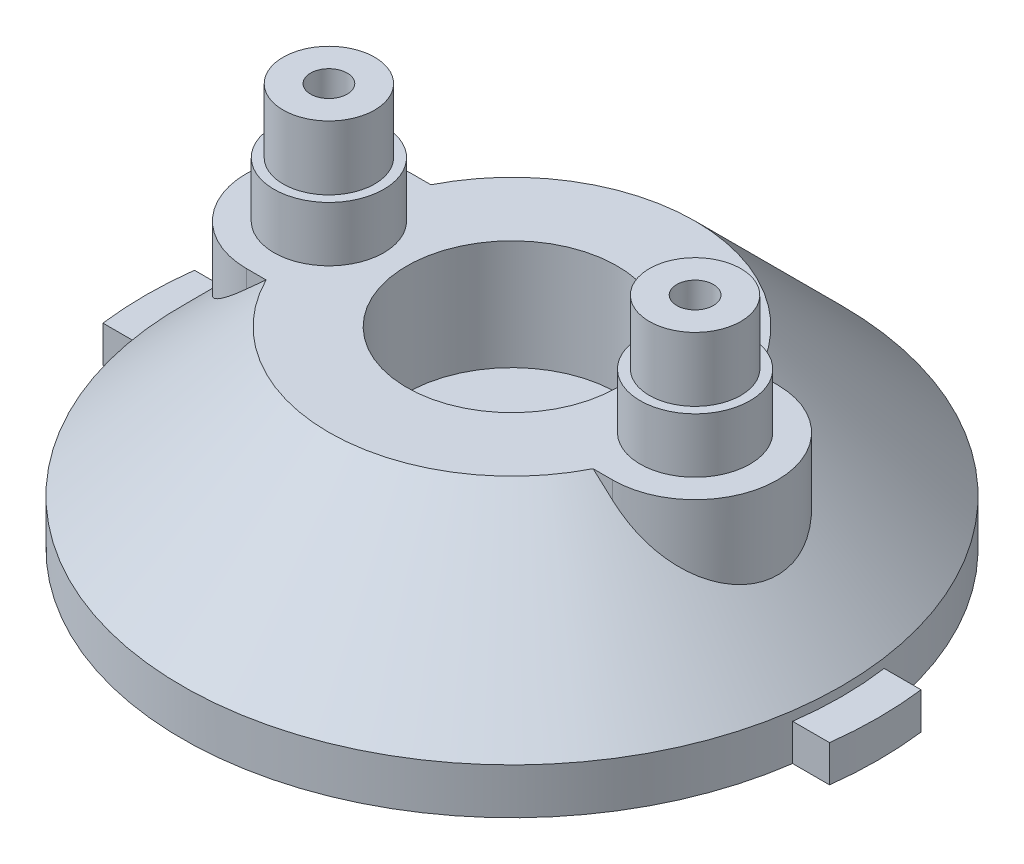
ISO-10303-21;
HEADER;
FILE_DESCRIPTION(('STEP AP214'),'2;1');
FILE_NAME('part.step','',(''),(''),'','','');
FILE_SCHEMA(('AUTOMOTIVE_DESIGN { 1 0 10303 214 1 1 1 1 }'));
ENDSEC;
DATA;
#1=APPLICATION_CONTEXT('core data for automotive mechanical design processes');
#2=APPLICATION_PROTOCOL_DEFINITION('international standard','automotive_design',2000,#1);
#3=PRODUCT_CONTEXT('',#1,'mechanical');
#4=PRODUCT('Part','Part','',(#3));
#5=PRODUCT_RELATED_PRODUCT_CATEGORY('part','',(#4));
#6=PRODUCT_DEFINITION_FORMATION('','',#4);
#7=PRODUCT_DEFINITION_CONTEXT('part definition',#1,'design');
#8=PRODUCT_DEFINITION('design','',#6,#7);
#9=PRODUCT_DEFINITION_SHAPE('','',#8);
#10=(LENGTH_UNIT() NAMED_UNIT(*) SI_UNIT(.MILLI.,.METRE.));
#11=(NAMED_UNIT(*) PLANE_ANGLE_UNIT() SI_UNIT($,.RADIAN.));
#12=(NAMED_UNIT(*) SI_UNIT($,.STERADIAN.) SOLID_ANGLE_UNIT());
#13=UNCERTAINTY_MEASURE_WITH_UNIT(LENGTH_MEASURE(1.E-05),#10,'distance_accuracy_value','');
#14=(GEOMETRIC_REPRESENTATION_CONTEXT(3) GLOBAL_UNCERTAINTY_ASSIGNED_CONTEXT((#13)) GLOBAL_UNIT_ASSIGNED_CONTEXT((#10,
#11,#12)) REPRESENTATION_CONTEXT('',''));
#15=CARTESIAN_POINT('',(0.,0.,0.));
#16=DIRECTION('',(0.,0.,1.));
#17=DIRECTION('',(1.,0.,0.));
#18=AXIS2_PLACEMENT_3D('',#15,#16,#17);
#19=CARTESIAN_POINT('',(9.99999999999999,0.,0.));
#20=DIRECTION('',(0.,1.,0.));
#21=DIRECTION('',(-1.,0.,0.));
#22=AXIS2_PLACEMENT_3D('',#19,#20,#21);
#23=CYLINDRICAL_SURFACE('',#22,0.999999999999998);
#24=CARTESIAN_POINT('',(9.99999999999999,9.,0.));
#25=DIRECTION('',(0.,1.,0.));
#26=DIRECTION('',(-1.,0.,0.));
#27=AXIS2_PLACEMENT_3D('',#24,#25,#26);
#28=CIRCLE('',#27,0.999999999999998);
#29=CARTESIAN_POINT('',(8.99999999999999,9.,0.));
#30=VERTEX_POINT('',#29);
#31=EDGE_CURVE('E238',#30,#30,#28,.F.);
#32=ORIENTED_EDGE('',*,*,#31,.T.);
#33=EDGE_LOOP('',(#32));
#34=FACE_BOUND('',#33,.T.);
#35=CARTESIAN_POINT('',(9.99999999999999,17.,0.));
#36=DIRECTION('',(0.,1.,0.));
#37=DIRECTION('',(-1.,0.,0.));
#38=AXIS2_PLACEMENT_3D('',#35,#36,#37);
#39=CIRCLE('',#38,0.999999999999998);
#40=CARTESIAN_POINT('',(8.99999999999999,17.,0.));
#41=VERTEX_POINT('',#40);
#42=EDGE_CURVE('E20',#41,#41,#39,.F.);
#43=ORIENTED_EDGE('',*,*,#42,.F.);
#44=EDGE_LOOP('',(#43));
#45=FACE_BOUND('',#44,.T.);
#46=ADVANCED_FACE('F17',(#34,#45),#23,.F.);
#47=CARTESIAN_POINT('',(-9.99999999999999,0.,0.));
#48=DIRECTION('',(0.,1.,0.));
#49=DIRECTION('',(-1.,0.,0.));
#50=AXIS2_PLACEMENT_3D('',#47,#48,#49);
#51=CYLINDRICAL_SURFACE('',#50,0.999999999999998);
#52=CARTESIAN_POINT('',(-9.99999999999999,9.,0.));
#53=DIRECTION('',(0.,1.,0.));
#54=DIRECTION('',(-1.,0.,0.));
#55=AXIS2_PLACEMENT_3D('',#52,#53,#54);
#56=CIRCLE('',#55,0.999999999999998);
#57=CARTESIAN_POINT('',(-11.,9.,0.));
#58=VERTEX_POINT('',#57);
#59=EDGE_CURVE('E669',#58,#58,#56,.F.);
#60=ORIENTED_EDGE('',*,*,#59,.T.);
#61=EDGE_LOOP('',(#60));
#62=FACE_BOUND('',#61,.T.);
#63=CARTESIAN_POINT('',(-9.99999999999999,17.,0.));
#64=DIRECTION('',(0.,1.,0.));
#65=DIRECTION('',(-1.,0.,0.));
#66=AXIS2_PLACEMENT_3D('',#63,#64,#65);
#67=CIRCLE('',#66,0.999999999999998);
#68=CARTESIAN_POINT('',(-11.,17.,0.));
#69=VERTEX_POINT('',#68);
#70=EDGE_CURVE('E674',#69,#69,#67,.F.);
#71=ORIENTED_EDGE('',*,*,#70,.F.);
#72=EDGE_LOOP('',(#71));
#73=FACE_BOUND('',#72,.T.);
#74=ADVANCED_FACE('F553',(#62,#73),#51,.F.);
#75=CARTESIAN_POINT('',(0.,0.,0.));
#76=DIRECTION('',(0.,-1.,0.));
#77=DIRECTION('',(1.,0.,0.));
#78=AXIS2_PLACEMENT_3D('',#75,#76,#77);
#79=CYLINDRICAL_SURFACE('',#78,7.24999999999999);
#80=CARTESIAN_POINT('',(0.,3.,0.));
#81=DIRECTION('',(0.,-1.,0.));
#82=DIRECTION('',(1.,0.,0.));
#83=AXIS2_PLACEMENT_3D('',#80,#81,#82);
#84=CIRCLE('',#83,7.24999999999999);
#85=CARTESIAN_POINT('',(7.24999999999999,3.,0.));
#86=VERTEX_POINT('',#85);
#87=EDGE_CURVE('E212',#86,#86,#84,.F.);
#88=ORIENTED_EDGE('',*,*,#87,.T.);
#89=EDGE_LOOP('',(#88));
#90=FACE_BOUND('',#89,.T.);
#91=CARTESIAN_POINT('',(0.,9.,0.));
#92=DIRECTION('',(0.,-1.,0.));
#93=DIRECTION('',(1.,0.,0.));
#94=AXIS2_PLACEMENT_3D('',#91,#92,#93);
#95=CIRCLE('',#94,7.24999999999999);
#96=CARTESIAN_POINT('',(7.24999999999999,9.,0.));
#97=VERTEX_POINT('',#96);
#98=EDGE_CURVE('E235',#97,#97,#95,.T.);
#99=ORIENTED_EDGE('',*,*,#98,.T.);
#100=EDGE_LOOP('',(#99));
#101=FACE_BOUND('',#100,.T.);
#102=ADVANCED_FACE('F550',(#90,#101),#79,.T.);
#103=CARTESIAN_POINT('',(9.99999999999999,17.,0.));
#104=DIRECTION('',(0.,1.,0.));
#105=DIRECTION('',(-1.,0.,0.));
#106=AXIS2_PLACEMENT_3D('',#103,#104,#105);
#107=PLANE('',#106);
#108=CARTESIAN_POINT('',(9.99999999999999,17.,0.));
#109=DIRECTION('',(0.,-1.,0.));
#110=DIRECTION('',(1.,0.,0.));
#111=AXIS2_PLACEMENT_3D('',#108,#109,#110);
#112=CIRCLE('',#111,2.5);
#113=CARTESIAN_POINT('',(12.5,17.,0.));
#114=VERTEX_POINT('',#113);
#115=EDGE_CURVE('E656',#114,#114,#112,.T.);
#116=ORIENTED_EDGE('',*,*,#115,.F.);
#117=EDGE_LOOP('',(#116));
#118=FACE_BOUND('',#117,.T.);
#119=ORIENTED_EDGE('',*,*,#42,.T.);
#120=EDGE_LOOP('',(#119));
#121=FACE_BOUND('',#120,.T.);
#122=ADVANCED_FACE('F546',(#118,#121),#107,.T.);
#123=CARTESIAN_POINT('',(-9.99999999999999,17.,0.));
#124=DIRECTION('',(0.,1.,0.));
#125=DIRECTION('',(-1.,0.,0.));
#126=AXIS2_PLACEMENT_3D('',#123,#124,#125);
#127=PLANE('',#126);
#128=CARTESIAN_POINT('',(-9.99999999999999,17.,0.));
#129=DIRECTION('',(0.,-1.,0.));
#130=DIRECTION('',(1.,0.,0.));
#131=AXIS2_PLACEMENT_3D('',#128,#129,#130);
#132=CIRCLE('',#131,2.5);
#133=CARTESIAN_POINT('',(-7.49999999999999,17.,0.));
#134=VERTEX_POINT('',#133);
#135=EDGE_CURVE('E659',#134,#134,#132,.T.);
#136=ORIENTED_EDGE('',*,*,#135,.F.);
#137=EDGE_LOOP('',(#136));
#138=FACE_BOUND('',#137,.T.);
#139=ORIENTED_EDGE('',*,*,#70,.T.);
#140=EDGE_LOOP('',(#139));
#141=FACE_BOUND('',#140,.T.);
#142=ADVANCED_FACE('F542',(#138,#141),#127,.T.);
#143=CARTESIAN_POINT('',(0.,3.,0.));
#144=DIRECTION('',(0.,1.,0.));
#145=DIRECTION('',(-1.,0.,0.));
#146=AXIS2_PLACEMENT_3D('',#143,#144,#145);
#147=PLANE('',#146);
#148=ORIENTED_EDGE('',*,*,#87,.F.);
#149=EDGE_LOOP('',(#148));
#150=FACE_BOUND('',#149,.T.);
#151=CARTESIAN_POINT('',(0.,3.,0.));
#152=DIRECTION('',(0.,1.,0.));
#153=DIRECTION('',(-1.,0.,0.));
#154=AXIS2_PLACEMENT_3D('',#151,#152,#153);
#155=CIRCLE('',#154,2.5);
#156=CARTESIAN_POINT('',(-2.5,3.,0.));
#157=VERTEX_POINT('',#156);
#158=EDGE_CURVE('E687',#157,#157,#155,.T.);
#159=ORIENTED_EDGE('',*,*,#158,.T.);
#160=EDGE_LOOP('',(#159));
#161=FACE_BOUND('',#160,.T.);
#162=ADVANCED_FACE('F539',(#150,#161),#147,.F.);
#163=CARTESIAN_POINT('',(0.,-0.00200000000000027,2.99999999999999));
#164=DIRECTION('',(0.,0.,1.));
#165=DIRECTION('',(1.,0.,0.));
#166=AXIS2_PLACEMENT_3D('',#163,#164,#165);
#167=PLANE('',#166);
#168=DIRECTION('',(0.,1.,0.));
#169=VECTOR('',#168,1.);
#170=CARTESIAN_POINT('',(-9.99999999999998,-0.00200000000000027,2.99999999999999));
#171=LINE('',#170,#169);
#172=CARTESIAN_POINT('',(-9.9999997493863,7.93837338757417,3.));
#173=VERTEX_POINT('',#172);
#174=CARTESIAN_POINT('',(-9.99999999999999,9.,2.99999999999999));
#175=VERTEX_POINT('',#174);
#176=EDGE_CURVE('E205',#173,#175,#171,.T.);
#177=ORIENTED_EDGE('',*,*,#176,.T.);
#178=DIRECTION('',(-1.,0.,0.));
#179=VECTOR('',#178,1.);
#180=CARTESIAN_POINT('',(5.74999999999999,9.,2.99999999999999));
#181=LINE('',#180,#179);
#182=CARTESIAN_POINT('',(-8.88592325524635,9.,2.99999999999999));
#183=VERTEX_POINT('',#182);
#184=EDGE_CURVE('E208',#175,#183,#181,.F.);
#185=ORIENTED_EDGE('',*,*,#184,.T.);
#186=CARTESIAN_POINT('',(-8.88592325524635,9.,3.));
#187=CARTESIAN_POINT('',(-8.97901644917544,8.91179748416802,3.));
#188=CARTESIAN_POINT('',(-9.07203926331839,8.82352072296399,3.));
#189=CARTESIAN_POINT('',(-9.25795470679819,8.64683055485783,3.));
#190=CARTESIAN_POINT('',(-9.35084733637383,8.55841714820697,3.));
#191=CARTESIAN_POINT('',(-9.53651330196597,8.3814652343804,3.));
#192=CARTESIAN_POINT('',(-9.62928663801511,8.29292672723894,3.));
#193=CARTESIAN_POINT('',(-9.81472332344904,8.11573426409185,3.));
#194=CARTESIAN_POINT('',(-9.90738667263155,8.02708030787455,3.));
#195=CARTESIAN_POINT('',(-9.99999949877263,7.93837362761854,3.));
#196=B_SPLINE_CURVE_WITH_KNOTS('',3,(#186,#187,#188,#189,#190,#191,#192,#193,#194,#195),
.UNSPECIFIED.,.F.,.F.,(4,2,2,2,4),(0.,0.384726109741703,0.769451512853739,1.15417681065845,
1.53890281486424),.UNSPECIFIED.);
#197=EDGE_CURVE('E210',#183,#173,#196,.T.);
#198=ORIENTED_EDGE('',*,*,#197,.T.);
#199=EDGE_LOOP('',(#177,#185,#198));
#200=FACE_BOUND('',#199,.T.);
#201=ADVANCED_FACE('F206',(#200),#167,.F.);
#202=CARTESIAN_POINT('',(-9.99999999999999,-0.00200000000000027,0.));
#203=DIRECTION('',(0.,1.,0.));
#204=DIRECTION('',(-1.,0.,0.));
#205=AXIS2_PLACEMENT_3D('',#202,#203,#204);
#206=CYLINDRICAL_SURFACE('',#205,3.);
#207=DIRECTION('',(0.,1.,0.));
#208=VECTOR('',#207,1.);
#209=CARTESIAN_POINT('',(-9.99999999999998,-0.00200000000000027,-3.));
#210=LINE('',#209,#208);
#211=CARTESIAN_POINT('',(-9.99999999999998,9.,-2.99999999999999));
#212=VERTEX_POINT('',#211);
#213=CARTESIAN_POINT('',(-9.99999999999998,7.93837314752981,-3.));
#214=VERTEX_POINT('',#213);
#215=EDGE_CURVE('E199',#212,#214,#210,.F.);
#216=ORIENTED_EDGE('',*,*,#215,.F.);
#217=CARTESIAN_POINT('',(-9.99999999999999,9.,0.));
#218=DIRECTION('',(0.,1.,0.));
#219=DIRECTION('',(-1.,0.,0.));
#220=AXIS2_PLACEMENT_3D('',#217,#218,#219);
#221=CIRCLE('',#220,3.);
#222=EDGE_CURVE('E215',#212,#175,#221,.T.);
#223=ORIENTED_EDGE('',*,*,#222,.T.);
#224=ORIENTED_EDGE('',*,*,#176,.F.);
#225=CARTESIAN_POINT('',(-9.99999949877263,7.93837362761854,2.99999999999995));
#226=CARTESIAN_POINT('',(-10.0910892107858,7.85111933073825,2.99999229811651));
#227=CARTESIAN_POINT('',(-10.1827486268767,7.76442547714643,2.9958499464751));
#228=CARTESIAN_POINT('',(-10.366756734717,7.59246154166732,2.97893405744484));
#229=CARTESIAN_POINT('',(-10.4591059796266,7.50719283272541,2.96615263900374));
#230=CARTESIAN_POINT('',(-10.6446109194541,7.33787138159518,2.93145784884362));
#231=CARTESIAN_POINT('',(-10.7377671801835,7.25383372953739,2.90947256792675));
#232=CARTESIAN_POINT('',(-10.9234196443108,7.08818545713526,2.85598130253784));
#233=CARTESIAN_POINT('',(-11.0159160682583,7.0065739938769,2.82447866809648));
#234=CARTESIAN_POINT('',(-11.2665001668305,6.78777133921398,2.72491412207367));
#235=CARTESIAN_POINT('',(-11.4232846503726,6.65340016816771,2.64693726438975));
#236=CARTESIAN_POINT('',(-11.7271898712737,6.39701963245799,2.4593834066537));
#237=CARTESIAN_POINT('',(-11.8743382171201,6.27497435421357,2.34990201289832));
#238=CARTESIAN_POINT('',(-12.1243596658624,6.07032996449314,2.12355869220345));
#239=CARTESIAN_POINT('',(-12.230169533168,5.98474434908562,2.01266372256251));
#240=CARTESIAN_POINT('',(-12.4271145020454,5.82684655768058,1.77015341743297));
#241=CARTESIAN_POINT('',(-12.5182605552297,5.75452447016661,1.63855369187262));
#242=CARTESIAN_POINT('',(-12.6680143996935,5.63649703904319,1.37859798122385));
#243=CARTESIAN_POINT('',(-12.7294851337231,5.5883944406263,1.25298724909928));
#244=CARTESIAN_POINT('',(-12.8352995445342,5.50592944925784,0.990485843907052));
#245=CARTESIAN_POINT('',(-12.8796514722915,5.47156043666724,0.853600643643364));
#246=CARTESIAN_POINT('',(-12.9487015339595,5.41817199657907,0.571285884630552));
#247=CARTESIAN_POINT('',(-12.9733028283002,5.39922819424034,0.425817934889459));
#248=CARTESIAN_POINT('',(-13.0007440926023,5.37810269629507,0.131643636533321));
#249=CARTESIAN_POINT('',(-13.003591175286,5.37591552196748,-0.0170616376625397));
#250=CARTESIAN_POINT('',(-12.9880495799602,5.38787472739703,-0.299793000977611));
#251=CARTESIAN_POINT('',(-12.971462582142,5.40063531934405,-0.433983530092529));
#252=CARTESIAN_POINT('',(-12.9209776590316,5.43959433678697,-0.697010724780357));
#253=CARTESIAN_POINT('',(-12.8870798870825,5.46579264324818,-0.825847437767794));
#254=CARTESIAN_POINT('',(-12.8031569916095,5.53094798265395,-1.07710002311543));
#255=CARTESIAN_POINT('',(-12.7528831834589,5.57010191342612,-1.19938065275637));
#256=CARTESIAN_POINT('',(-12.6388051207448,5.65947778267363,-1.43305115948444));
#257=CARTESIAN_POINT('',(-12.5749960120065,5.70970369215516,-1.54443710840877));
#258=CARTESIAN_POINT('',(-12.4278825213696,5.82633163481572,-1.76787987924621));
#259=CARTESIAN_POINT('',(-12.343147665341,5.89396137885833,-1.87834850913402));
#260=CARTESIAN_POINT('',(-12.1632030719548,6.03893359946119,-2.08306576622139));
#261=CARTESIAN_POINT('',(-12.0679890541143,6.11628004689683,-2.17730772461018));
#262=CARTESIAN_POINT('',(-11.8222392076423,6.31803233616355,-2.39107268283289));
#263=CARTESIAN_POINT('',(-11.6671357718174,6.44716871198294,-2.50092785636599));
#264=CARTESIAN_POINT('',(-11.3474388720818,6.71817952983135,-2.68678269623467));
#265=CARTESIAN_POINT('',(-11.1828128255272,6.86009876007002,-2.7626572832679));
#266=CARTESIAN_POINT('',(-10.8471514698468,7.1552602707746,-2.883514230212));
#267=CARTESIAN_POINT('',(-10.6760549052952,7.30865305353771,-2.92795449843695));
#268=CARTESIAN_POINT('',(-10.4206866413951,7.54263853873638,-2.97160087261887));
#269=CARTESIAN_POINT('',(-10.3361028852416,7.62097124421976,-2.98231638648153));
#270=CARTESIAN_POINT('',(-10.1675317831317,7.77882765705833,-2.99650892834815));
#271=CARTESIAN_POINT('',(-10.0835441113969,7.85835062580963,-2.99999027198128));
#272=CARTESIAN_POINT('',(-9.99999999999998,7.9383731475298,-3.));
#273=B_SPLINE_CURVE_WITH_KNOTS('',3,(#225,#226,#227,#228,#229,#230,#231,#232,#233,#234,#235,
#236,#237,#238,#239,#240,#241,#242,#243,#244,#245,#246,#247,#248,#249,#250,#251,#252,#253,#254,
#255,#256,#257,#258,#259,#260,#261,#262,#263,#264,#265,#266,#267,#268,#269,#270,#271,#272),
.UNSPECIFIED.,.F.,.F.,(4,2,2,2,2,2,2,2,2,2,2,2,2,2,2,2,2,2,2,2,2,2,2,4),(0.,0.378375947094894,
0.75709753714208,1.13883496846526,1.52043818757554,2.18002518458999,2.83763127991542,
3.36228872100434,3.88655248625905,4.32835941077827,4.76995312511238,5.21369902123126,
5.65729982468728,6.0628266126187,6.4683498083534,6.8803431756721,7.29248454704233,
7.75509602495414,8.21789717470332,8.90347613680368,9.59155831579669,10.2912349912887,
10.6383856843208,10.9853292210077),.UNSPECIFIED.);
#274=EDGE_CURVE('E497',#173,#214,#273,.T.);
#275=ORIENTED_EDGE('',*,*,#274,.T.);
#276=EDGE_LOOP('',(#216,#223,#224,#275));
#277=FACE_BOUND('',#276,.T.);
#278=ADVANCED_FACE('F216',(#277),#206,.F.);
#279=CARTESIAN_POINT('',(0.,-0.00200000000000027,-3.));
#280=DIRECTION('',(0.,0.,1.));
#281=DIRECTION('',(1.,0.,0.));
#282=AXIS2_PLACEMENT_3D('',#279,#280,#281);
#283=PLANE('',#282);
#284=ORIENTED_EDGE('',*,*,#215,.T.);
#285=CARTESIAN_POINT('',(-9.99999999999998,7.9383731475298,-3.));
#286=CARTESIAN_POINT('',(-9.90738713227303,8.02707986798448,-3.));
#287=CARTESIAN_POINT('',(-9.81472374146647,8.11573386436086,-3.));
#288=CARTESIAN_POINT('',(-9.62928697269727,8.29292640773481,-3.));
#289=CARTESIAN_POINT('',(-9.53651359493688,8.38146495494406,-3.));
#290=CARTESIAN_POINT('',(-9.3508475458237,8.55841694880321,-3.));
#291=CARTESIAN_POINT('',(-9.25795487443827,8.64683039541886,-3.));
#292=CARTESIAN_POINT('',(-9.07203934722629,8.82352064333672,-3.));
#293=CARTESIAN_POINT('',(-8.97901649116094,8.91179744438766,-3.));
#294=CARTESIAN_POINT('',(-8.88592325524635,8.99999999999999,-3.));
#295=B_SPLINE_CURVE_WITH_KNOTS('',3,(#285,#286,#287,#288,#289,#290,#291,#292,#293,#294),
.UNSPECIFIED.,.F.,.F.,(4,2,2,2,4),(0.,0.384726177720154,0.769451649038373,1.15417722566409,
1.53890350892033),.UNSPECIFIED.);
#296=CARTESIAN_POINT('',(-8.88592325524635,8.99999999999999,-2.99999999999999));
#297=VERTEX_POINT('',#296);
#298=EDGE_CURVE('E483',#214,#297,#295,.T.);
#299=ORIENTED_EDGE('',*,*,#298,.T.);
#300=DIRECTION('',(-1.,0.,0.));
#301=VECTOR('',#300,1.);
#302=CARTESIAN_POINT('',(5.74999999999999,9.,-2.99999999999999));
#303=LINE('',#302,#301);
#304=EDGE_CURVE('E219',#297,#212,#303,.T.);
#305=ORIENTED_EDGE('',*,*,#304,.T.);
#306=EDGE_LOOP('',(#284,#299,#305));
#307=FACE_BOUND('',#306,.T.);
#308=ADVANCED_FACE('F529',(#307),#283,.T.);
#309=CARTESIAN_POINT('',(0.,-0.00200000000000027,-3.));
#310=DIRECTION('',(0.,0.,1.));
#311=DIRECTION('',(1.,0.,0.));
#312=AXIS2_PLACEMENT_3D('',#309,#310,#311);
#313=PLANE('',#312);
#314=DIRECTION('',(-1.,0.,0.));
#315=VECTOR('',#314,1.);
#316=CARTESIAN_POINT('',(5.74999999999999,9.,-3.));
#317=LINE('',#316,#315);
#318=CARTESIAN_POINT('',(9.99999999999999,9.,-3.));
#319=VERTEX_POINT('',#318);
#320=CARTESIAN_POINT('',(8.88592325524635,9.,-3.));
#321=VERTEX_POINT('',#320);
#322=EDGE_CURVE('E655',#319,#321,#317,.T.);
#323=ORIENTED_EDGE('',*,*,#322,.T.);
#324=CARTESIAN_POINT('',(8.88592325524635,8.99999999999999,-3.));
#325=CARTESIAN_POINT('',(8.97901644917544,8.91179748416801,-3.));
#326=CARTESIAN_POINT('',(9.0720392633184,8.82352072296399,-3.));
#327=CARTESIAN_POINT('',(9.25795470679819,8.64683055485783,-3.));
#328=CARTESIAN_POINT('',(9.35084733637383,8.55841714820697,-3.));
#329=CARTESIAN_POINT('',(9.53651330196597,8.38146523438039,-3.));
#330=CARTESIAN_POINT('',(9.62928663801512,8.29292672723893,-3.));
#331=CARTESIAN_POINT('',(9.81472332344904,8.11573426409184,-3.));
#332=CARTESIAN_POINT('',(9.90738667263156,8.02708030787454,-3.));
#333=CARTESIAN_POINT('',(9.99999949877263,7.93837362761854,-3.));
#334=B_SPLINE_CURVE_WITH_KNOTS('',3,(#324,#325,#326,#327,#328,#329,#330,#331,#332,#333),
.UNSPECIFIED.,.F.,.F.,(4,2,2,2,4),(0.,0.384726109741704,0.769451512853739,1.15417681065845,
1.53890281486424),.UNSPECIFIED.);
#335=CARTESIAN_POINT('',(9.99999974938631,7.93837338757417,-3.));
#336=VERTEX_POINT('',#335);
#337=EDGE_CURVE('E459',#321,#336,#334,.T.);
#338=ORIENTED_EDGE('',*,*,#337,.T.);
#339=DIRECTION('',(0.,1.,0.));
#340=VECTOR('',#339,1.);
#341=CARTESIAN_POINT('',(9.99999999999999,-0.00200000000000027,-3.));
#342=LINE('',#341,#340);
#343=EDGE_CURVE('E239',#336,#319,#342,.T.);
#344=ORIENTED_EDGE('',*,*,#343,.T.);
#345=EDGE_LOOP('',(#323,#338,#344));
#346=FACE_BOUND('',#345,.T.);
#347=ADVANCED_FACE('F525',(#346),#313,.T.);
#348=CARTESIAN_POINT('',(9.99999999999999,-0.00200000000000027,0.));
#349=DIRECTION('',(0.,1.,0.));
#350=DIRECTION('',(-1.,0.,0.));
#351=AXIS2_PLACEMENT_3D('',#348,#349,#350);
#352=CYLINDRICAL_SURFACE('',#351,3.);
#353=DIRECTION('',(0.,1.,0.));
#354=VECTOR('',#353,1.);
#355=CARTESIAN_POINT('',(9.99999999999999,-0.00200000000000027,2.99999999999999));
#356=LINE('',#355,#354);
#357=CARTESIAN_POINT('',(9.99999999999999,7.9383731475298,2.99999999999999));
#358=VERTEX_POINT('',#357);
#359=CARTESIAN_POINT('',(9.99999999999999,9.,2.99999999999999));
#360=VERTEX_POINT('',#359);
#361=EDGE_CURVE('E236',#358,#360,#356,.T.);
#362=ORIENTED_EDGE('',*,*,#361,.T.);
#363=CARTESIAN_POINT('',(9.99999999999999,9.,0.));
#364=DIRECTION('',(0.,1.,0.));
#365=DIRECTION('',(-1.,0.,0.));
#366=AXIS2_PLACEMENT_3D('',#363,#364,#365);
#367=CIRCLE('',#366,3.);
#368=EDGE_CURVE('E230',#360,#319,#367,.T.);
#369=ORIENTED_EDGE('',*,*,#368,.T.);
#370=ORIENTED_EDGE('',*,*,#343,.F.);
#371=CARTESIAN_POINT('',(9.99999949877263,7.93837362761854,-2.99999999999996));
#372=CARTESIAN_POINT('',(10.0910892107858,7.85111933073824,-2.99999229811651));
#373=CARTESIAN_POINT('',(10.1827486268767,7.76442547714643,-2.9958499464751));
#374=CARTESIAN_POINT('',(10.366756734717,7.59246154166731,-2.97893405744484));
#375=CARTESIAN_POINT('',(10.4591059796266,7.50719283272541,-2.96615263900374));
#376=CARTESIAN_POINT('',(10.6446109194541,7.33787138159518,-2.93145784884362));
#377=CARTESIAN_POINT('',(10.7377671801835,7.25383372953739,-2.90947256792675));
#378=CARTESIAN_POINT('',(10.9234196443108,7.08818545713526,-2.85598130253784));
#379=CARTESIAN_POINT('',(11.0159160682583,7.0065739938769,-2.82447866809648));
#380=CARTESIAN_POINT('',(11.2665001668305,6.78777133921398,-2.72491412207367));
#381=CARTESIAN_POINT('',(11.4232846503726,6.6534001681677,-2.64693726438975));
#382=CARTESIAN_POINT('',(11.7271898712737,6.39701963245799,-2.4593834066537));
#383=CARTESIAN_POINT('',(11.8743382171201,6.27497435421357,-2.34990201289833));
#384=CARTESIAN_POINT('',(12.1243596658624,6.07032996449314,-2.12355869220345));
#385=CARTESIAN_POINT('',(12.230169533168,5.98474434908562,-2.01266372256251));
#386=CARTESIAN_POINT('',(12.4271145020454,5.82684655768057,-1.77015341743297));
#387=CARTESIAN_POINT('',(12.5182605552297,5.75452447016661,-1.63855369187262));
#388=CARTESIAN_POINT('',(12.6680143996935,5.63649703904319,-1.37859798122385));
#389=CARTESIAN_POINT('',(12.7294851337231,5.5883944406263,-1.25298724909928));
#390=CARTESIAN_POINT('',(12.8352995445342,5.50592944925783,-0.990485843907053));
#391=CARTESIAN_POINT('',(12.8796514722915,5.47156043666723,-0.853600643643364));
#392=CARTESIAN_POINT('',(12.9487015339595,5.41817199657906,-0.571285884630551));
#393=CARTESIAN_POINT('',(12.9733028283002,5.39922819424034,-0.425817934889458));
#394=CARTESIAN_POINT('',(13.0007440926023,5.37810269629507,-0.131643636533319));
#395=CARTESIAN_POINT('',(13.003591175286,5.37591552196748,0.0170616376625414));
#396=CARTESIAN_POINT('',(12.9880495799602,5.38787472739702,0.299793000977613));
#397=CARTESIAN_POINT('',(12.971462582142,5.40063531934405,0.433983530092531));
#398=CARTESIAN_POINT('',(12.9209776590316,5.43959433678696,0.697010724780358));
#399=CARTESIAN_POINT('',(12.8870798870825,5.46579264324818,0.825847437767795));
#400=CARTESIAN_POINT('',(12.8031569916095,5.53094798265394,1.07710002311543));
#401=CARTESIAN_POINT('',(12.7528831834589,5.57010191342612,1.19938065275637));
#402=CARTESIAN_POINT('',(12.6388051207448,5.65947778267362,1.43305115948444));
#403=CARTESIAN_POINT('',(12.5749960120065,5.70970369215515,1.54443710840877));
#404=CARTESIAN_POINT('',(12.4278825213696,5.82633163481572,1.76787987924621));
#405=CARTESIAN_POINT('',(12.343147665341,5.89396137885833,1.87834850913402));
#406=CARTESIAN_POINT('',(12.1632030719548,6.03893359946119,2.08306576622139));
#407=CARTESIAN_POINT('',(12.0679890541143,6.11628004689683,2.17730772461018));
#408=CARTESIAN_POINT('',(11.8222392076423,6.31803233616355,2.39107268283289));
#409=CARTESIAN_POINT('',(11.6671357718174,6.44716871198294,2.50092785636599));
#410=CARTESIAN_POINT('',(11.3474388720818,6.71817952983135,2.68678269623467));
#411=CARTESIAN_POINT('',(11.1828128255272,6.86009876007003,2.7626572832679));
#412=CARTESIAN_POINT('',(10.8471514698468,7.1552602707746,2.883514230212));
#413=CARTESIAN_POINT('',(10.6760549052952,7.30865305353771,2.92795449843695));
#414=CARTESIAN_POINT('',(10.4206866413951,7.54263853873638,2.97160087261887));
#415=CARTESIAN_POINT('',(10.3361028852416,7.62097124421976,2.98231638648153));
#416=CARTESIAN_POINT('',(10.1675317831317,7.77882765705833,2.99650892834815));
#417=CARTESIAN_POINT('',(10.0835441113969,7.85835062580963,2.99999027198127));
#418=CARTESIAN_POINT('',(9.99999999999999,7.9383731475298,3.));
#419=B_SPLINE_CURVE_WITH_KNOTS('',3,(#371,#372,#373,#374,#375,#376,#377,#378,#379,#380,#381,
#382,#383,#384,#385,#386,#387,#388,#389,#390,#391,#392,#393,#394,#395,#396,#397,#398,#399,#400,
#401,#402,#403,#404,#405,#406,#407,#408,#409,#410,#411,#412,#413,#414,#415,#416,#417,#418),
.UNSPECIFIED.,.F.,.F.,(4,2,2,2,2,2,2,2,2,2,2,2,2,2,2,2,2,2,2,2,2,2,2,4),(0.,0.378375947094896,
0.757097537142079,1.13883496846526,1.52043818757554,2.18002518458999,2.83763127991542,
3.36228872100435,3.88655248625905,4.32835941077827,4.76995312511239,5.21369902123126,
5.65729982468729,6.06282661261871,6.46834980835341,6.88034317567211,7.29248454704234,
7.75509602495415,8.21789717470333,8.90347613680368,9.5915583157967,10.2912349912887,
10.6383856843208,10.9853292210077),.UNSPECIFIED.);
#420=EDGE_CURVE('E510',#336,#358,#419,.T.);
#421=ORIENTED_EDGE('',*,*,#420,.T.);
#422=EDGE_LOOP('',(#362,#369,#370,#421));
#423=FACE_BOUND('',#422,.T.);
#424=ADVANCED_FACE('F520',(#423),#352,.F.);
#425=CARTESIAN_POINT('',(0.,-0.00200000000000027,2.99999999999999));
#426=DIRECTION('',(0.,0.,1.));
#427=DIRECTION('',(1.,0.,0.));
#428=AXIS2_PLACEMENT_3D('',#425,#426,#427);
#429=PLANE('',#428);
#430=DIRECTION('',(-1.,0.,0.));
#431=VECTOR('',#430,1.);
#432=CARTESIAN_POINT('',(5.74999999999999,9.,2.99999999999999));
#433=LINE('',#432,#431);
#434=CARTESIAN_POINT('',(8.88592325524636,8.99999999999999,2.99999999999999));
#435=VERTEX_POINT('',#434);
#436=EDGE_CURVE('E227',#435,#360,#433,.F.);
#437=ORIENTED_EDGE('',*,*,#436,.T.);
#438=ORIENTED_EDGE('',*,*,#361,.F.);
#439=CARTESIAN_POINT('',(9.99999999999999,7.9383731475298,2.99999999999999));
#440=CARTESIAN_POINT('',(9.90738713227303,8.02707986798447,2.99999999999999));
#441=CARTESIAN_POINT('',(9.81472374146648,8.11573386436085,2.99999999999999));
#442=CARTESIAN_POINT('',(9.62928697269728,8.2929264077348,2.99999999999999));
#443=CARTESIAN_POINT('',(9.53651359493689,8.38146495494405,2.99999999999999));
#444=CARTESIAN_POINT('',(9.35084754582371,8.55841694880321,2.99999999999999));
#445=CARTESIAN_POINT('',(9.25795487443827,8.64683039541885,2.99999999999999));
#446=CARTESIAN_POINT('',(9.07203934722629,8.82352064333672,2.99999999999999));
#447=CARTESIAN_POINT('',(8.97901649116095,8.91179744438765,2.99999999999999));
#448=CARTESIAN_POINT('',(8.88592325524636,8.99999999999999,2.99999999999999));
#449=B_SPLINE_CURVE_WITH_KNOTS('',3,(#439,#440,#441,#442,#443,#444,#445,#446,#447,#448),
.UNSPECIFIED.,.F.,.F.,(4,2,2,2,4),(0.,0.384726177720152,0.769451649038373,1.15417722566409,
1.53890350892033),.UNSPECIFIED.);
#450=EDGE_CURVE('E504',#358,#435,#449,.T.);
#451=ORIENTED_EDGE('',*,*,#450,.T.);
#452=EDGE_LOOP('',(#437,#438,#451));
#453=FACE_BOUND('',#452,.T.);
#454=ADVANCED_FACE('F516',(#453),#429,.F.);
#455=CARTESIAN_POINT('',(5.74999999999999,9.,0.));
#456=DIRECTION('',(0.,1.,0.));
#457=DIRECTION('',(-1.,0.,0.));
#458=AXIS2_PLACEMENT_3D('',#455,#456,#457);
#459=PLANE('',#458);
#460=CARTESIAN_POINT('',(0.,8.99999999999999,0.));
#461=DIRECTION('',(0.,-1.,0.));
#462=DIRECTION('',(0.,0.,-1.));
#463=AXIS2_PLACEMENT_3D('',#460,#461,#462);
#464=CIRCLE('',#463,9.37867965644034);
#465=EDGE_CURVE('E1267',#297,#321,#464,.T.);
#466=ORIENTED_EDGE('',*,*,#465,.T.);
#467=ORIENTED_EDGE('',*,*,#322,.F.);
#468=ORIENTED_EDGE('',*,*,#368,.F.);
#469=ORIENTED_EDGE('',*,*,#436,.F.);
#470=CARTESIAN_POINT('',(0.,8.99999999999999,0.));
#471=DIRECTION('',(0.,-1.,0.));
#472=DIRECTION('',(0.,0.,-1.));
#473=AXIS2_PLACEMENT_3D('',#470,#471,#472);
#474=CIRCLE('',#473,9.37867965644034);
#475=EDGE_CURVE('E226',#435,#183,#474,.T.);
#476=ORIENTED_EDGE('',*,*,#475,.T.);
#477=ORIENTED_EDGE('',*,*,#184,.F.);
#478=ORIENTED_EDGE('',*,*,#222,.F.);
#479=ORIENTED_EDGE('',*,*,#304,.F.);
#480=EDGE_LOOP('',(#466,#467,#468,#469,#476,#477,#478,#479));
#481=FACE_BOUND('',#480,.T.);
#482=ORIENTED_EDGE('',*,*,#98,.F.);
#483=EDGE_LOOP('',(#482));
#484=FACE_BOUND('',#483,.T.);
#485=ORIENTED_EDGE('',*,*,#59,.F.);
#486=EDGE_LOOP('',(#485));
#487=FACE_BOUND('',#486,.T.);
#488=ORIENTED_EDGE('',*,*,#31,.F.);
#489=EDGE_LOOP('',(#488));
#490=FACE_BOUND('',#489,.T.);
#491=ADVANCED_FACE('F222',(#481,#484,#487,#490),#459,.F.);
#492=CARTESIAN_POINT('',(9.99999999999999,17.,0.));
#493=DIRECTION('',(0.,-1.,0.));
#494=DIRECTION('',(1.,0.,0.));
#495=AXIS2_PLACEMENT_3D('',#492,#493,#494);
#496=CYLINDRICAL_SURFACE('',#495,2.5);
#497=CARTESIAN_POINT('',(9.99999999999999,13.5,0.));
#498=DIRECTION('',(0.,-1.,0.));
#499=DIRECTION('',(1.,0.,0.));
#500=AXIS2_PLACEMENT_3D('',#497,#498,#499);
#501=CIRCLE('',#500,2.5);
#502=CARTESIAN_POINT('',(12.5,13.5,0.));
#503=VERTEX_POINT('',#502);
#504=EDGE_CURVE('E706',#503,#503,#501,.T.);
#505=ORIENTED_EDGE('',*,*,#504,.F.);
#506=EDGE_LOOP('',(#505));
#507=FACE_BOUND('',#506,.T.);
#508=ORIENTED_EDGE('',*,*,#115,.T.);
#509=EDGE_LOOP('',(#508));
#510=FACE_BOUND('',#509,.T.);
#511=ADVANCED_FACE('F694',(#507,#510),#496,.T.);
#512=CARTESIAN_POINT('',(-9.99999999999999,17.,0.));
#513=DIRECTION('',(0.,-1.,0.));
#514=DIRECTION('',(1.,0.,0.));
#515=AXIS2_PLACEMENT_3D('',#512,#513,#514);
#516=CYLINDRICAL_SURFACE('',#515,2.5);
#517=CARTESIAN_POINT('',(-9.99999999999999,13.5,0.));
#518=DIRECTION('',(0.,-1.,0.));
#519=DIRECTION('',(1.,0.,0.));
#520=AXIS2_PLACEMENT_3D('',#517,#518,#519);
#521=CIRCLE('',#520,2.5);
#522=CARTESIAN_POINT('',(-7.49999999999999,13.5,0.));
#523=VERTEX_POINT('',#522);
#524=EDGE_CURVE('E704',#523,#523,#521,.T.);
#525=ORIENTED_EDGE('',*,*,#524,.F.);
#526=EDGE_LOOP('',(#525));
#527=FACE_BOUND('',#526,.T.);
#528=ORIENTED_EDGE('',*,*,#135,.T.);
#529=EDGE_LOOP('',(#528));
#530=FACE_BOUND('',#529,.T.);
#531=ADVANCED_FACE('F692',(#527,#530),#516,.T.);
#532=CARTESIAN_POINT('',(0.,0.,0.));
#533=DIRECTION('',(0.,1.,0.));
#534=DIRECTION('',(-1.,0.,0.));
#535=AXIS2_PLACEMENT_3D('',#532,#533,#534);
#536=CYLINDRICAL_SURFACE('',#535,2.5);
#537=CARTESIAN_POINT('',(0.,4.5,0.));
#538=DIRECTION('',(0.,1.,0.));
#539=DIRECTION('',(-1.,0.,0.));
#540=AXIS2_PLACEMENT_3D('',#537,#538,#539);
#541=CIRCLE('',#540,2.5);
#542=CARTESIAN_POINT('',(-2.5,4.5,0.));
#543=VERTEX_POINT('',#542);
#544=EDGE_CURVE('E643',#543,#543,#541,.F.);
#545=ORIENTED_EDGE('',*,*,#544,.F.);
#546=EDGE_LOOP('',(#545));
#547=FACE_BOUND('',#546,.T.);
#548=ORIENTED_EDGE('',*,*,#158,.F.);
#549=EDGE_LOOP('',(#548));
#550=FACE_BOUND('',#549,.T.);
#551=ADVANCED_FACE('F453',(#547,#550),#536,.F.);
#552=CARTESIAN_POINT('',(0.,1.87867965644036,0.));
#553=DIRECTION('',(0.,-1.,0.));
#554=DIRECTION('',(0.,0.,-1.));
#555=AXIS2_PLACEMENT_3D('',#552,#553,#554);
#556=CONICAL_SURFACE('',#555,16.5,0.785398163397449);
#557=ORIENTED_EDGE('',*,*,#465,.F.);
#558=ORIENTED_EDGE('',*,*,#298,.F.);
#559=ORIENTED_EDGE('',*,*,#274,.F.);
#560=ORIENTED_EDGE('',*,*,#197,.F.);
#561=ORIENTED_EDGE('',*,*,#475,.F.);
#562=ORIENTED_EDGE('',*,*,#450,.F.);
#563=ORIENTED_EDGE('',*,*,#420,.F.);
#564=ORIENTED_EDGE('',*,*,#337,.F.);
#565=EDGE_LOOP('',(#557,#558,#559,#560,#561,#562,#563,#564));
#566=FACE_BOUND('',#565,.T.);
#567=CARTESIAN_POINT('',(-10.3267070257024,1.87867965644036,-12.8689207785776));
#568=CARTESIAN_POINT('',(-10.2543893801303,1.91583066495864,-12.8793184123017));
#569=CARTESIAN_POINT('',(-10.1825320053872,1.95447997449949,-12.8869657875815));
#570=CARTESIAN_POINT('',(-10.0400486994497,2.0344739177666,-12.8970529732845));
#571=CARTESIAN_POINT('',(-9.96942163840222,2.07581589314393,-12.899497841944));
#572=CARTESIAN_POINT('',(-9.68140350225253,2.25117892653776,-12.8994858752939));
#573=CARTESIAN_POINT('',(-9.47012465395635,2.39596657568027,-12.8756666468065));
#574=CARTESIAN_POINT('',(-9.16872044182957,2.62490034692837,-12.8109666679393));
#575=CARTESIAN_POINT('',(-9.07056743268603,2.7034234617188,-12.7844480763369));
#576=CARTESIAN_POINT('',(-8.87982234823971,2.86372355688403,-12.7226656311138));
#577=CARTESIAN_POINT('',(-8.7872293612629,2.94550000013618,-12.6874032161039));
#578=CARTESIAN_POINT('',(-8.48817757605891,3.2227031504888,-12.5566420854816));
#579=CARTESIAN_POINT('',(-8.29463900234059,3.42417994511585,-12.4435504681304));
#580=CARTESIAN_POINT('',(-8.03068637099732,3.73200036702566,-12.2488612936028));
#581=CARTESIAN_POINT('',(-7.94708289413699,3.8355592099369,-12.1797759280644));
#582=CARTESIAN_POINT('',(-7.78870825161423,4.04408365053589,-12.0340090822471));
#583=CARTESIAN_POINT('',(-7.7139365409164,4.14904916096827,-11.9573280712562));
#584=CARTESIAN_POINT('',(-7.5009816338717,4.46855690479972,-11.7144374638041));
#585=CARTESIAN_POINT('',(-7.37684853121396,4.68455980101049,-11.5373934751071));
#586=CARTESIAN_POINT('',(-7.22065098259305,5.0071995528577,-11.2542712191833));
#587=CARTESIAN_POINT('',(-7.17356895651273,5.11457372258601,-11.1569163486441));
#588=CARTESIAN_POINT('',(-7.08984917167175,5.32821463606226,-10.9566891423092));
#589=CARTESIAN_POINT('',(-7.05320950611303,5.43448157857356,-10.8538178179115));
#590=CARTESIAN_POINT('',(-6.97035969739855,5.71489621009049,-10.5730075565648));
#591=CARTESIAN_POINT('',(-6.93383478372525,5.88747781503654,-10.3903997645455));
#592=CARTESIAN_POINT('',(-6.90517992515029,6.1381297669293,-10.1070015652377));
#593=CARTESIAN_POINT('',(-6.89998082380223,6.22028149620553,-10.0109916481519));
#594=CARTESIAN_POINT('',(-6.89907402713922,6.38091059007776,-9.81592188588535));
#595=CARTESIAN_POINT('',(-6.90336197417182,6.45938962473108,-9.71686346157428));
#596=CARTESIAN_POINT('',(-6.9251808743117,6.63361685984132,-9.48661004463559));
#597=CARTESIAN_POINT('',(-6.946208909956,6.72772755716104,-9.3544670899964));
#598=CARTESIAN_POINT('',(-7.00843057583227,6.90366896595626,-9.08674197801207));
#599=CARTESIAN_POINT('',(-7.04959357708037,6.98551808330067,-8.95116534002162));
#600=CARTESIAN_POINT('',(-7.14256540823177,7.11395049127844,-8.71132436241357));
#601=CARTESIAN_POINT('',(-7.18955973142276,7.1642967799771,-8.60723170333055));
#602=CARTESIAN_POINT('',(-7.29812777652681,7.25111869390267,-8.40068896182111));
#603=CARTESIAN_POINT('',(-7.35968828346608,7.28760681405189,-8.29823747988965));
#604=CARTESIAN_POINT('',(-7.46316208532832,7.32953597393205,-8.14790614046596));
#605=CARTESIAN_POINT('',(-7.49975387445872,7.34140933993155,-8.0980745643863));
#606=CARTESIAN_POINT('',(-7.57642193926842,7.36041370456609,-8.00023599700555));
#607=CARTESIAN_POINT('',(-7.61649634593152,7.36754722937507,-7.9522280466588));
#608=CARTESIAN_POINT('',(-7.6998180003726,7.37683786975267,-7.85857675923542));
#609=CARTESIAN_POINT('',(-7.74306369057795,7.37899741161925,-7.8129322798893));
#610=CARTESIAN_POINT('',(-7.83230181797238,7.37828553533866,-7.72448543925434));
#611=CARTESIAN_POINT('',(-7.87829393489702,7.37541470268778,-7.6816827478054));
#612=CARTESIAN_POINT('',(-8.00529446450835,7.36099441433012,-7.57071680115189));
#613=CARTESIAN_POINT('',(-8.0884638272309,7.3448064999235,-7.50555551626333));
#614=CARTESIAN_POINT('',(-8.25871778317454,7.29960691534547,-7.3857852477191));
#615=CARTESIAN_POINT('',(-8.34580480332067,7.27058719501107,-7.33118291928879));
#616=CARTESIAN_POINT('',(-8.55280406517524,7.18965513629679,-7.21527930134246));
#617=CARTESIAN_POINT('',(-8.67345011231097,7.13327768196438,-7.15841907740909));
#618=CARTESIAN_POINT('',(-8.91427501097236,7.00607434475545,-7.0629092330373));
#619=CARTESIAN_POINT('',(-9.03445257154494,6.93522171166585,-7.02429377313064));
#620=CARTESIAN_POINT('',(-9.28138715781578,6.77750117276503,-6.96088900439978));
#621=CARTESIAN_POINT('',(-9.40794443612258,6.68982284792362,-6.9373829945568));
#622=CARTESIAN_POINT('',(-9.65694442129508,6.50637768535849,-6.90668490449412));
#623=CARTESIAN_POINT('',(-9.77938714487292,6.41061088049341,-6.89949275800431));
#624=CARTESIAN_POINT('',(-9.99752906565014,6.23164204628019,-6.89949671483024));
#625=CARTESIAN_POINT('',(-10.0940076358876,6.14936544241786,-6.90429143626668));
#626=CARTESIAN_POINT('',(-10.2837065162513,5.98206846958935,-6.92267380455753));
#627=CARTESIAN_POINT('',(-10.3769255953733,5.89704708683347,-6.93626473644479));
#628=CARTESIAN_POINT('',(-10.6516861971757,5.63882951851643,-6.98932862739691));
#629=CARTESIAN_POINT('',(-10.8281786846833,5.46260709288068,-7.04109063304));
#630=CARTESIAN_POINT('',(-11.0940397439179,5.18257999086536,-7.14560296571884));
#631=CARTESIAN_POINT('',(-11.1885722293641,5.07980923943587,-7.18859462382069));
#632=CARTESIAN_POINT('',(-11.3722720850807,4.87376034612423,-7.2838428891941));
#633=CARTESIAN_POINT('',(-11.4614391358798,4.77048217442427,-7.33610004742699));
#634=CARTESIAN_POINT('',(-11.7204170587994,4.46056752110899,-7.50638784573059));
#635=CARTESIAN_POINT('',(-11.8816717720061,4.25388568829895,-7.63792174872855));
#636=CARTESIAN_POINT('',(-12.1134493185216,3.93238146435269,-7.87149438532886));
#637=CARTESIAN_POINT('',(-12.1933653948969,3.81592513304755,-7.96223723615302));
#638=CARTESIAN_POINT('',(-12.3428780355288,3.58536337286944,-8.15457546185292));
#639=CARTESIAN_POINT('',(-12.4124716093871,3.47125863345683,-8.25617396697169));
#640=CARTESIAN_POINT('',(-12.603518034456,3.13414964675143,-8.57663959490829));
#641=CARTESIAN_POINT('',(-12.7077104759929,2.91570375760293,-8.81164213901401));
#642=CARTESIAN_POINT('',(-12.8274820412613,2.57876966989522,-9.22515057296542));
#643=CARTESIAN_POINT('',(-12.8615594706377,2.45307355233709,-9.39263432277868));
#644=CARTESIAN_POINT('',(-12.9002742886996,2.21509075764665,-9.7396514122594));
#645=CARTESIAN_POINT('',(-12.9050358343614,2.1027495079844,-9.91913067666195));
#646=CARTESIAN_POINT('',(-12.8876021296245,1.95767729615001,-10.1765789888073));
#647=CARTESIAN_POINT('',(-12.8797574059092,1.91734205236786,-10.2514225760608));
#648=CARTESIAN_POINT('',(-12.8689207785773,1.87867965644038,-10.3267070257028));
#649=B_SPLINE_CURVE_WITH_KNOTS('',3,(#567,#568,#569,#570,#571,#572,#573,#574,#575,#576,#577,
#578,#579,#580,#581,#582,#583,#584,#585,#586,#587,#588,#589,#590,#591,#592,#593,#594,#595,#596,
#597,#598,#599,#600,#601,#602,#603,#604,#605,#606,#607,#608,#609,#610,#611,#612,#613,#614,#615,
#616,#617,#618,#619,#620,#621,#622,#623,#624,#625,#626,#627,#628,#629,#630,#631,#632,#633,#634,
#635,#636,#637,#638,#639,#640,#641,#642,#643,#644,#645,#646,#647,#648),.UNSPECIFIED.,.F.,.F.,(4,
2,2,2,2,2,2,2,2,2,2,2,2,2,2,2,2,2,2,2,2,2,2,2,2,2,2,2,2,2,2,2,2,2,2,2,2,2,2,2,4),(0.,
0.245694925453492,0.491150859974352,1.25669299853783,1.64177913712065,2.02680195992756,
2.92556897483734,3.37510322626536,3.82460972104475,4.73729939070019,5.19411560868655,
5.65084835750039,6.40951289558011,6.78856508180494,7.16744319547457,7.65680317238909,
8.14542104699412,8.51857120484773,8.89138411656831,9.07998898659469,9.26849325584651,
9.45690555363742,9.64529592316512,9.964356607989,10.2836177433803,10.7155966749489,
11.1483812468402,11.614265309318,12.0801474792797,12.4604088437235,12.8408123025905,
13.6022092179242,14.0401966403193,14.4782101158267,15.3543846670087,15.8574088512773,
16.3605784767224,17.3641753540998,17.9985526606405,18.6302414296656,18.8861661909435),.UNSPECIFIED.);
#650=CARTESIAN_POINT('',(-10.3267070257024,1.87867965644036,-12.8689207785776));
#651=VERTEX_POINT('',#650);
#652=CARTESIAN_POINT('',(-12.8689207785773,1.87867965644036,-10.3267070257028));
#653=VERTEX_POINT('',#652);
#654=EDGE_CURVE('E475',#651,#653,#649,.T.);
#655=ORIENTED_EDGE('',*,*,#654,.F.);
#656=CARTESIAN_POINT('',(0.,1.87867965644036,0.));
#657=DIRECTION('',(0.,-1.,0.));
#658=DIRECTION('',(1.,0.,0.));
#659=AXIS2_PLACEMENT_3D('',#656,#657,#658);
#660=CIRCLE('',#659,16.5);
#661=CARTESIAN_POINT('',(10.3267070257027,1.87867965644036,-12.8689207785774));
#662=VERTEX_POINT('',#661);
#663=EDGE_CURVE('E621',#651,#662,#660,.T.);
#664=ORIENTED_EDGE('',*,*,#663,.T.);
#665=CARTESIAN_POINT('',(12.8689207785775,1.87867965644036,-10.3267070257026));
#666=CARTESIAN_POINT('',(12.8824306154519,1.92693463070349,-10.2327652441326));
#667=CARTESIAN_POINT('',(12.8912928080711,1.97773445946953,-10.1395882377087));
#668=CARTESIAN_POINT('',(12.9003860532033,2.08369893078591,-9.95550751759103));
#669=CARTESIAN_POINT('',(12.9006311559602,2.13885632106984,-9.86460034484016));
#670=CARTESIAN_POINT('',(12.8895344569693,2.3091255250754,-9.5973597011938));
#671=CARTESIAN_POINT('',(12.8665521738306,2.42981939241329,-9.42500091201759));
#672=CARTESIAN_POINT('',(12.7850945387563,2.71431402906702,-9.05174033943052));
#673=CARTESIAN_POINT('',(12.718997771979,2.88120737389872,-8.85493202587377));
#674=CARTESIAN_POINT('',(12.5534519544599,3.22635001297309,-8.4861649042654));
#675=CARTESIAN_POINT('',(12.4538943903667,3.404634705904,-8.31428958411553));
#676=CARTESIAN_POINT('',(12.2259074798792,3.77085421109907,-7.99504629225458));
#677=CARTESIAN_POINT('',(12.0970242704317,3.95890038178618,-7.8481349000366));
#678=CARTESIAN_POINT('',(11.8160952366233,4.33844983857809,-7.58348306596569));
#679=CARTESIAN_POINT('',(11.6640327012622,4.52995553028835,-7.4657638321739));
#680=CARTESIAN_POINT('',(11.4044796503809,4.83698587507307,-7.30172853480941));
#681=CARTESIAN_POINT('',(11.303151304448,4.95260093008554,-7.24558755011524));
#682=CARTESIAN_POINT('',(11.0938376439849,5.18305242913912,-7.14503835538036));
#683=CARTESIAN_POINT('',(10.9858497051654,5.29788854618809,-7.1006348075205));
#684=CARTESIAN_POINT('',(10.7641033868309,5.52537879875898,-7.02440206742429));
#685=CARTESIAN_POINT('',(10.6503650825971,5.63803885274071,-6.9925321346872));
#686=CARTESIAN_POINT('',(10.4172224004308,5.86031632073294,-6.94210269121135));
#687=CARTESIAN_POINT('',(10.2978236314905,5.96993658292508,-6.92353028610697));
#688=CARTESIAN_POINT('',(10.1304704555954,6.11706589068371,-6.90805425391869));
#689=CARTESIAN_POINT('',(10.0848008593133,6.15657576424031,-6.90486863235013));
#690=CARTESIAN_POINT('',(9.99270724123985,6.23488535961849,-6.9005890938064));
#691=CARTESIAN_POINT('',(9.946282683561,6.2736845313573,-6.89949673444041));
#692=CARTESIAN_POINT('',(9.7536181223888,6.43175635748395,-6.89948933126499));
#693=CARTESIAN_POINT('',(9.60421076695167,6.54743494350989,-6.9100850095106));
#694=CARTESIAN_POINT('',(9.29951456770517,6.76592402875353,-6.95607236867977));
#695=CARTESIAN_POINT('',(9.14422673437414,6.86873672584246,-6.9914598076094));
#696=CARTESIAN_POINT('',(8.87909424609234,7.02525071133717,-7.07607359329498));
#697=CARTESIAN_POINT('',(8.77001372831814,7.08431674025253,-7.11765971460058));
#698=CARTESIAN_POINT('',(8.55242757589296,7.18907110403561,-7.21628602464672));
#699=CARTESIAN_POINT('',(8.44392124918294,7.23478412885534,-7.27329731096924));
#700=CARTESIAN_POINT('',(8.24805329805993,7.30287184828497,-7.39277199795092));
#701=CARTESIAN_POINT('',(8.16013425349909,7.32783983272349,-7.45282141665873));
#702=CARTESIAN_POINT('',(7.98948482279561,7.36361690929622,-7.58359637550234));
#703=CARTESIAN_POINT('',(7.9067509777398,7.37443553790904,-7.65431468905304));
#704=CARTESIAN_POINT('',(7.74902487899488,7.38087439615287,-7.80488513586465));
#705=CARTESIAN_POINT('',(7.67405038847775,7.3764605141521,-7.88475738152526));
#706=CARTESIAN_POINT('',(7.53422235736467,7.35280706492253,-8.05090280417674));
#707=CARTESIAN_POINT('',(7.46937364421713,7.33356045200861,-8.13717900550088));
#708=CARTESIAN_POINT('',(7.35225037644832,7.28258316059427,-8.31131326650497));
#709=CARTESIAN_POINT('',(7.29972233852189,7.25114782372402,-8.39909012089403));
#710=CARTESIAN_POINT('',(7.20534798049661,7.17796225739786,-8.57599894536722));
#711=CARTESIAN_POINT('',(7.16350615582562,7.13620770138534,-8.66513146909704));
#712=CARTESIAN_POINT('',(7.06708162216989,7.01604802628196,-8.89857815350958));
#713=CARTESIAN_POINT('',(7.02068673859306,6.93097123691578,-9.04283789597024));
#714=CARTESIAN_POINT('',(6.95079801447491,6.74646642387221,-9.32780165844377));
#715=CARTESIAN_POINT('',(6.92737307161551,6.64699624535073,-9.4684937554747));
#716=CARTESIAN_POINT('',(6.90367429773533,6.46472501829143,-9.71011128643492));
#717=CARTESIAN_POINT('',(6.89908343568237,6.38395429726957,-9.81220294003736));
#718=CARTESIAN_POINT('',(6.89996447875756,6.21849949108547,-10.0131782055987));
#719=CARTESIAN_POINT('',(6.90544119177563,6.13381355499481,-10.1120602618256));
#720=CARTESIAN_POINT('',(6.92561770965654,5.96155947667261,-10.3064454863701));
#721=CARTESIAN_POINT('',(6.94032628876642,5.87398866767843,-10.4019453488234));
#722=CARTESIAN_POINT('',(6.97831028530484,5.69685973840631,-10.5892882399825));
#723=CARTESIAN_POINT('',(7.0015852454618,5.60730172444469,-10.681131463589));
#724=CARTESIAN_POINT('',(7.06368326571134,5.40208760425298,-10.8856541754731));
#725=CARTESIAN_POINT('',(7.10501882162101,5.28600187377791,-10.9971506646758));
#726=CARTESIAN_POINT('',(7.19997431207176,5.05271179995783,-11.2134776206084));
#727=CARTESIAN_POINT('',(7.25359746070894,4.93550717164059,-11.3183063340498));
#728=CARTESIAN_POINT('',(7.43221185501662,4.58327563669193,-11.6222129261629));
#729=CARTESIAN_POINT('',(7.57495027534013,4.34762384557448,-11.8107184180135));
#730=CARTESIAN_POINT('',(7.82219121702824,3.99800545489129,-12.0672062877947));
#731=CARTESIAN_POINT('',(7.91037417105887,3.88184019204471,-12.1484840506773));
#732=CARTESIAN_POINT('',(8.09753666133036,3.65166314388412,-12.3010670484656));
#733=CARTESIAN_POINT('',(8.19651853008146,3.53765183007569,-12.3723701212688));
#734=CARTESIAN_POINT('',(8.50886112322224,3.20069855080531,-12.5690422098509));
#735=CARTESIAN_POINT('',(8.73823081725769,2.9819638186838,-12.6778241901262));
#736=CARTESIAN_POINT('',(9.12744998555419,2.65607629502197,-12.8022537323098));
#737=CARTESIAN_POINT('',(9.2748705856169,2.5413347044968,-12.8378355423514));
#738=CARTESIAN_POINT('',(9.58008876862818,2.32171536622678,-12.8864228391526));
#739=CARTESIAN_POINT('',(9.73785396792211,2.21680911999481,-12.8994955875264));
#740=CARTESIAN_POINT('',(10.0393242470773,2.03325432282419,-12.8994943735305));
#741=CARTESIAN_POINT('',(10.1820539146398,1.95297277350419,-12.88971058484));
#742=CARTESIAN_POINT('',(10.3267070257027,1.87867965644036,-12.8689207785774));
#743=B_SPLINE_CURVE_WITH_KNOTS('',3,(#665,#666,#667,#668,#669,#670,#671,#672,#673,#674,#675,
#676,#677,#678,#679,#680,#681,#682,#683,#684,#685,#686,#687,#688,#689,#690,#691,#692,#693,#694,
#695,#696,#697,#698,#699,#700,#701,#702,#703,#704,#705,#706,#707,#708,#709,#710,#711,#712,#713,
#714,#715,#716,#717,#718,#719,#720,#721,#722,#723,#724,#725,#726,#727,#728,#729,#730,#731,#732,
#733,#734,#735,#736,#737,#738,#739,#740,#741,#742),.UNSPECIFIED.,.F.,.F.,(4,2,2,2,2,2,2,2,2,2,2,
2,2,2,2,2,2,2,2,2,2,2,2,2,2,2,2,2,2,2,2,2,2,2,2,2,2,2,4),(0.,0.319100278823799,
0.637680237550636,1.2697863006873,2.06481518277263,2.86244762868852,3.67338398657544,
4.48490777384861,4.97542306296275,5.46613289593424,5.95523422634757,6.44386063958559,
6.62523868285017,6.80675163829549,7.37268039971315,7.93851235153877,8.32973724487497,
8.72023410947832,9.04690870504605,9.37336301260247,9.70054885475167,10.027890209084,
10.3477510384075,10.6677462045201,11.1861643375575,11.706132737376,12.0964126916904,
12.4868790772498,12.8777171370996,13.268534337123,13.7663945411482,14.2643851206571,
15.2603353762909,15.7606730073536,16.2611189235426,17.2583143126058,17.8274026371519,
18.3947874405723,18.8856099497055),.UNSPECIFIED.);
#744=CARTESIAN_POINT('',(12.8689207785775,1.87867965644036,-10.3267070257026));
#745=VERTEX_POINT('',#744);
#746=EDGE_CURVE('E436',#745,#662,#743,.T.);
#747=ORIENTED_EDGE('',*,*,#746,.F.);
#748=CARTESIAN_POINT('',(0.,1.87867965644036,0.));
#749=DIRECTION('',(0.,-1.,0.));
#750=DIRECTION('',(1.,0.,0.));
#751=AXIS2_PLACEMENT_3D('',#748,#749,#750);
#752=CIRCLE('',#751,16.5);
#753=CARTESIAN_POINT('',(12.8689207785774,1.87867965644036,10.3267070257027));
#754=VERTEX_POINT('',#753);
#755=EDGE_CURVE('E626',#745,#754,#752,.T.);
#756=ORIENTED_EDGE('',*,*,#755,.T.);
#757=CARTESIAN_POINT('',(10.3267070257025,1.87867965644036,12.8689207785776));
#758=CARTESIAN_POINT('',(10.2543893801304,1.91583066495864,12.8793184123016));
#759=CARTESIAN_POINT('',(10.1825320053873,1.95447997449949,12.8869657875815));
#760=CARTESIAN_POINT('',(10.0400486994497,2.03447391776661,12.8970529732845));
#761=CARTESIAN_POINT('',(9.9694216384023,2.07581589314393,12.899497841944));
#762=CARTESIAN_POINT('',(9.6814035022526,2.25117892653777,12.8994858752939));
#763=CARTESIAN_POINT('',(9.47012465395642,2.39596657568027,12.8756666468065));
#764=CARTESIAN_POINT('',(9.16872044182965,2.62490034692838,12.8109666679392));
#765=CARTESIAN_POINT('',(9.07056743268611,2.70342346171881,12.7844480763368));
#766=CARTESIAN_POINT('',(8.87982234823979,2.86372355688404,12.7226656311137));
#767=CARTESIAN_POINT('',(8.78722936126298,2.94550000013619,12.6874032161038));
#768=CARTESIAN_POINT('',(8.48817757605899,3.22270315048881,12.5566420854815));
#769=CARTESIAN_POINT('',(8.29463900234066,3.42417994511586,12.4435504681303));
#770=CARTESIAN_POINT('',(8.0306863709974,3.73200036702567,12.2488612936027));
#771=CARTESIAN_POINT('',(7.94708289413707,3.83555920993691,12.1797759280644));
#772=CARTESIAN_POINT('',(7.7887082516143,4.04408365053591,12.034009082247));
#773=CARTESIAN_POINT('',(7.71393654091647,4.14904916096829,11.9573280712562));
#774=CARTESIAN_POINT('',(7.50098163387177,4.46855690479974,11.714437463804));
#775=CARTESIAN_POINT('',(7.37684853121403,4.68455980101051,11.537393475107));
#776=CARTESIAN_POINT('',(7.22065098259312,5.00719955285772,11.2542712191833));
#777=CARTESIAN_POINT('',(7.1735689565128,5.11457372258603,11.156916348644));
#778=CARTESIAN_POINT('',(7.08984917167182,5.32821463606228,10.9566891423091));
#779=CARTESIAN_POINT('',(7.0532095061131,5.43448157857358,10.8538178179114));
#780=CARTESIAN_POINT('',(6.97035969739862,5.71489621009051,10.5730075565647));
#781=CARTESIAN_POINT('',(6.93383478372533,5.88747781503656,10.3903997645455));
#782=CARTESIAN_POINT('',(6.90517992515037,6.13812976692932,10.1070015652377));
#783=CARTESIAN_POINT('',(6.89998082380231,6.22028149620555,10.0109916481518));
#784=CARTESIAN_POINT('',(6.8990740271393,6.38091059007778,9.81592188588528));
#785=CARTESIAN_POINT('',(6.90336197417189,6.45938962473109,9.71686346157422));
#786=CARTESIAN_POINT('',(6.92518087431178,6.63361685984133,9.48661004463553));
#787=CARTESIAN_POINT('',(6.94620890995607,6.72772755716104,9.35446708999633));
#788=CARTESIAN_POINT('',(7.00843057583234,6.90366896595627,9.08674197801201));
#789=CARTESIAN_POINT('',(7.04959357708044,6.98551808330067,8.95116534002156));
#790=CARTESIAN_POINT('',(7.14256540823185,7.11395049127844,8.71132436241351));
#791=CARTESIAN_POINT('',(7.18955973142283,7.16429677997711,8.60723170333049));
#792=CARTESIAN_POINT('',(7.29812777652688,7.25111869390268,8.40068896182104));
#793=CARTESIAN_POINT('',(7.35968828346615,7.2876068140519,8.29823747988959));
#794=CARTESIAN_POINT('',(7.46316208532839,7.32953597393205,8.1479061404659));
#795=CARTESIAN_POINT('',(7.49975387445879,7.34140933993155,8.09807456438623));
#796=CARTESIAN_POINT('',(7.57642193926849,7.36041370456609,8.00023599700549));
#797=CARTESIAN_POINT('',(7.61649634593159,7.36754722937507,7.95222804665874));
#798=CARTESIAN_POINT('',(7.69981800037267,7.37683786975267,7.85857675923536));
#799=CARTESIAN_POINT('',(7.74306369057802,7.37899741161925,7.81293227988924));
#800=CARTESIAN_POINT('',(7.83230181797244,7.37828553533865,7.72448543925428));
#801=CARTESIAN_POINT('',(7.87829393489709,7.37541470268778,7.68168274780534));
#802=CARTESIAN_POINT('',(8.00529446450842,7.36099441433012,7.57071680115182));
#803=CARTESIAN_POINT('',(8.08846382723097,7.34480649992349,7.50555551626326));
#804=CARTESIAN_POINT('',(8.2587177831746,7.29960691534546,7.38578524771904));
#805=CARTESIAN_POINT('',(8.34580480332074,7.27058719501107,7.33118291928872));
#806=CARTESIAN_POINT('',(8.55280406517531,7.18965513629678,7.21527930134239));
#807=CARTESIAN_POINT('',(8.67345011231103,7.13327768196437,7.15841907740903));
#808=CARTESIAN_POINT('',(8.91427501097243,7.00607434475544,7.06290923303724));
#809=CARTESIAN_POINT('',(9.03445257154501,6.93522171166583,7.02429377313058));
#810=CARTESIAN_POINT('',(9.28138715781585,6.77750117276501,6.96088900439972));
#811=CARTESIAN_POINT('',(9.40794443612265,6.6898228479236,6.93738299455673));
#812=CARTESIAN_POINT('',(9.65694442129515,6.50637768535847,6.90668490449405));
#813=CARTESIAN_POINT('',(9.77938714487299,6.41061088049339,6.89949275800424));
#814=CARTESIAN_POINT('',(9.99752906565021,6.23164204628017,6.89949671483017));
#815=CARTESIAN_POINT('',(10.0940076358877,6.14936544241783,6.90429143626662));
#816=CARTESIAN_POINT('',(10.2837065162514,5.98206846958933,6.92267380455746));
#817=CARTESIAN_POINT('',(10.3769255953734,5.89704708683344,6.93626473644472));
#818=CARTESIAN_POINT('',(10.6516861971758,5.6388295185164,6.98932862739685));
#819=CARTESIAN_POINT('',(10.8281786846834,5.46260709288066,7.04109063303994));
#820=CARTESIAN_POINT('',(11.094039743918,5.18257999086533,7.14560296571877));
#821=CARTESIAN_POINT('',(11.1885722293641,5.07980923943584,7.18859462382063));
#822=CARTESIAN_POINT('',(11.3722720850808,4.8737603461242,7.28384288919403));
#823=CARTESIAN_POINT('',(11.4614391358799,4.77048217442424,7.33610004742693));
#824=CARTESIAN_POINT('',(11.7204170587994,4.46056752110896,7.50638784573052));
#825=CARTESIAN_POINT('',(11.8816717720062,4.25388568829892,7.63792174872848));
#826=CARTESIAN_POINT('',(12.1134493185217,3.93238146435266,7.87149438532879));
#827=CARTESIAN_POINT('',(12.193365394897,3.81592513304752,7.96223723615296));
#828=CARTESIAN_POINT('',(12.3428780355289,3.58536337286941,8.15457546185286));
#829=CARTESIAN_POINT('',(12.4124716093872,3.47125863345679,8.25617396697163));
#830=CARTESIAN_POINT('',(12.6035180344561,3.13414964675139,8.57663959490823));
#831=CARTESIAN_POINT('',(12.707710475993,2.91570375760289,8.81164213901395));
#832=CARTESIAN_POINT('',(12.8274820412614,2.57876966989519,9.22515057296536));
#833=CARTESIAN_POINT('',(12.8615594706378,2.45307355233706,9.39263432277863));
#834=CARTESIAN_POINT('',(12.9002742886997,2.21509075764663,9.73965141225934));
#835=CARTESIAN_POINT('',(12.9050358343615,2.10274950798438,9.9191306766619));
#836=CARTESIAN_POINT('',(12.8876021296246,1.95767729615,10.1765789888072));
#837=CARTESIAN_POINT('',(12.8797574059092,1.91734205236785,10.2514225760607));
#838=CARTESIAN_POINT('',(12.8689207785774,1.87867965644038,10.3267070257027));
#839=B_SPLINE_CURVE_WITH_KNOTS('',3,(#757,#758,#759,#760,#761,#762,#763,#764,#765,#766,#767,
#768,#769,#770,#771,#772,#773,#774,#775,#776,#777,#778,#779,#780,#781,#782,#783,#784,#785,#786,
#787,#788,#789,#790,#791,#792,#793,#794,#795,#796,#797,#798,#799,#800,#801,#802,#803,#804,#805,
#806,#807,#808,#809,#810,#811,#812,#813,#814,#815,#816,#817,#818,#819,#820,#821,#822,#823,#824,
#825,#826,#827,#828,#829,#830,#831,#832,#833,#834,#835,#836,#837,#838),.UNSPECIFIED.,.F.,.F.,(4,
2,2,2,2,2,2,2,2,2,2,2,2,2,2,2,2,2,2,2,2,2,2,2,2,2,2,2,2,2,2,2,2,2,2,2,2,2,2,2,4),(0.,
0.2456949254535,0.491150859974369,1.25669299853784,1.64177913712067,2.02680195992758,
2.92556897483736,3.37510322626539,3.82460972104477,4.73729939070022,5.19411560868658,
5.65084835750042,6.40951289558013,6.78856508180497,7.16744319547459,7.6568031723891,
8.14542104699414,8.51857120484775,8.89138411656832,9.0799889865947,9.26849325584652,
9.45690555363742,9.64529592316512,9.964356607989,10.2836177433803,10.7155966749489,
11.1483812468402,11.614265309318,12.0801474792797,12.4604088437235,12.8408123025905,
13.6022092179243,14.0401966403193,14.4782101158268,15.3543846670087,15.8574088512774,
16.3605784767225,17.3641753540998,17.9985526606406,18.6302414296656,18.8861661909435),.UNSPECIFIED.);
#840=CARTESIAN_POINT('',(10.3267070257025,1.87867965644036,12.8689207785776));
#841=VERTEX_POINT('',#840);
#842=EDGE_CURVE('E444',#841,#754,#839,.T.);
#843=ORIENTED_EDGE('',*,*,#842,.F.);
#844=CARTESIAN_POINT('',(0.,1.87867965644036,0.));
#845=DIRECTION('',(0.,-1.,0.));
#846=DIRECTION('',(1.,0.,0.));
#847=AXIS2_PLACEMENT_3D('',#844,#845,#846);
#848=CIRCLE('',#847,16.5);
#849=CARTESIAN_POINT('',(-10.3267070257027,1.87867965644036,12.8689207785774));
#850=VERTEX_POINT('',#849);
#851=EDGE_CURVE('E630',#841,#850,#848,.T.);
#852=ORIENTED_EDGE('',*,*,#851,.T.);
#853=CARTESIAN_POINT('',(-12.8689207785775,1.87867965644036,10.3267070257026));
#854=CARTESIAN_POINT('',(-12.8824306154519,1.92693463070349,10.2327652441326));
#855=CARTESIAN_POINT('',(-12.8912928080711,1.97773445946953,10.1395882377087));
#856=CARTESIAN_POINT('',(-12.9003860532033,2.08369893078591,9.95550751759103));
#857=CARTESIAN_POINT('',(-12.9006311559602,2.13885632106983,9.86460034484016));
#858=CARTESIAN_POINT('',(-12.8895344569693,2.3091255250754,9.5973597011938));
#859=CARTESIAN_POINT('',(-12.8665521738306,2.42981939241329,9.42500091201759));
#860=CARTESIAN_POINT('',(-12.7850945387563,2.71431402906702,9.05174033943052));
#861=CARTESIAN_POINT('',(-12.718997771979,2.88120737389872,8.85493202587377));
#862=CARTESIAN_POINT('',(-12.5534519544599,3.22635001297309,8.48616490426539));
#863=CARTESIAN_POINT('',(-12.4538943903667,3.404634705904,8.31428958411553));
#864=CARTESIAN_POINT('',(-12.2259074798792,3.77085421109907,7.99504629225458));
#865=CARTESIAN_POINT('',(-12.0970242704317,3.95890038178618,7.8481349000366));
#866=CARTESIAN_POINT('',(-11.8160952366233,4.33844983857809,7.58348306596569));
#867=CARTESIAN_POINT('',(-11.6640327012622,4.52995553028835,7.4657638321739));
#868=CARTESIAN_POINT('',(-11.4044796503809,4.83698587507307,7.30172853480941));
#869=CARTESIAN_POINT('',(-11.303151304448,4.95260093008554,7.24558755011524));
#870=CARTESIAN_POINT('',(-11.0938376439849,5.18305242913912,7.14503835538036));
#871=CARTESIAN_POINT('',(-10.9858497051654,5.2978885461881,7.10063480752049));
#872=CARTESIAN_POINT('',(-10.7641033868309,5.52537879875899,7.02440206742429));
#873=CARTESIAN_POINT('',(-10.6503650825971,5.63803885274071,6.9925321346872));
#874=CARTESIAN_POINT('',(-10.4172224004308,5.86031632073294,6.94210269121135));
#875=CARTESIAN_POINT('',(-10.2978236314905,5.96993658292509,6.92353028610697));
#876=CARTESIAN_POINT('',(-10.1304704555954,6.11706589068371,6.90805425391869));
#877=CARTESIAN_POINT('',(-10.0848008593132,6.15657576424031,6.90486863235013));
#878=CARTESIAN_POINT('',(-9.99270724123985,6.23488535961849,6.9005890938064));
#879=CARTESIAN_POINT('',(-9.94628268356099,6.2736845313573,6.89949673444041));
#880=CARTESIAN_POINT('',(-9.7536181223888,6.43175635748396,6.89948933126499));
#881=CARTESIAN_POINT('',(-9.60421076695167,6.54743494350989,6.9100850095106));
#882=CARTESIAN_POINT('',(-9.29951456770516,6.76592402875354,6.95607236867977));
#883=CARTESIAN_POINT('',(-9.14422673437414,6.86873672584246,6.9914598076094));
#884=CARTESIAN_POINT('',(-8.87909424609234,7.02525071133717,7.07607359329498));
#885=CARTESIAN_POINT('',(-8.77001372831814,7.08431674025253,7.11765971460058));
#886=CARTESIAN_POINT('',(-8.55242757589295,7.18907110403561,7.21628602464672));
#887=CARTESIAN_POINT('',(-8.44392124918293,7.23478412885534,7.27329731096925));
#888=CARTESIAN_POINT('',(-8.24805329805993,7.30287184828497,7.39277199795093));
#889=CARTESIAN_POINT('',(-8.16013425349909,7.32783983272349,7.45282141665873));
#890=CARTESIAN_POINT('',(-7.98948482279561,7.36361690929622,7.58359637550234));
#891=CARTESIAN_POINT('',(-7.90675097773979,7.37443553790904,7.65431468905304));
#892=CARTESIAN_POINT('',(-7.74902487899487,7.38087439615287,7.80488513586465));
#893=CARTESIAN_POINT('',(-7.67405038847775,7.3764605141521,7.88475738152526));
#894=CARTESIAN_POINT('',(-7.53422235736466,7.35280706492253,8.05090280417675));
#895=CARTESIAN_POINT('',(-7.46937364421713,7.33356045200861,8.13717900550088));
#896=CARTESIAN_POINT('',(-7.35225037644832,7.28258316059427,8.31131326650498));
#897=CARTESIAN_POINT('',(-7.29972233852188,7.25114782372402,8.39909012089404));
#898=CARTESIAN_POINT('',(-7.20534798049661,7.17796225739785,8.57599894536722));
#899=CARTESIAN_POINT('',(-7.16350615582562,7.13620770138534,8.66513146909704));
#900=CARTESIAN_POINT('',(-7.06708162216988,7.01604802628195,8.89857815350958));
#901=CARTESIAN_POINT('',(-7.02068673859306,6.93097123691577,9.04283789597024));
#902=CARTESIAN_POINT('',(-6.95079801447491,6.7464664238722,9.32780165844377));
#903=CARTESIAN_POINT('',(-6.92737307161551,6.64699624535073,9.4684937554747));
#904=CARTESIAN_POINT('',(-6.90367429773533,6.46472501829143,9.71011128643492));
#905=CARTESIAN_POINT('',(-6.89908343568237,6.38395429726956,9.81220294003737));
#906=CARTESIAN_POINT('',(-6.89996447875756,6.21849949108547,10.0131782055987));
#907=CARTESIAN_POINT('',(-6.90544119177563,6.1338135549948,10.1120602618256));
#908=CARTESIAN_POINT('',(-6.92561770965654,5.9615594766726,10.3064454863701));
#909=CARTESIAN_POINT('',(-6.94032628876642,5.87398866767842,10.4019453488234));
#910=CARTESIAN_POINT('',(-6.97831028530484,5.6968597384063,10.5892882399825));
#911=CARTESIAN_POINT('',(-7.0015852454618,5.60730172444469,10.681131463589));
#912=CARTESIAN_POINT('',(-7.06368326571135,5.40208760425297,10.8856541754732));
#913=CARTESIAN_POINT('',(-7.10501882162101,5.2860018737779,10.9971506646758));
#914=CARTESIAN_POINT('',(-7.19997431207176,5.05271179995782,11.2134776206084));
#915=CARTESIAN_POINT('',(-7.25359746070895,4.93550717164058,11.3183063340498));
#916=CARTESIAN_POINT('',(-7.43221185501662,4.58327563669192,11.622212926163));
#917=CARTESIAN_POINT('',(-7.57495027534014,4.34762384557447,11.8107184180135));
#918=CARTESIAN_POINT('',(-7.82219121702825,3.99800545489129,12.0672062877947));
#919=CARTESIAN_POINT('',(-7.91037417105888,3.8818401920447,12.1484840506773));
#920=CARTESIAN_POINT('',(-8.09753666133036,3.65166314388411,12.3010670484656));
#921=CARTESIAN_POINT('',(-8.19651853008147,3.53765183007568,12.3723701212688));
#922=CARTESIAN_POINT('',(-8.50886112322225,3.20069855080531,12.5690422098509));
#923=CARTESIAN_POINT('',(-8.7382308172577,2.98196381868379,12.6778241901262));
#924=CARTESIAN_POINT('',(-9.1274499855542,2.65607629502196,12.8022537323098));
#925=CARTESIAN_POINT('',(-9.2748705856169,2.5413347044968,12.8378355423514));
#926=CARTESIAN_POINT('',(-9.58008876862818,2.32171536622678,12.8864228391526));
#927=CARTESIAN_POINT('',(-9.73785396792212,2.21680911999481,12.8994955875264));
#928=CARTESIAN_POINT('',(-10.0393242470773,2.03325432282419,12.8994943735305));
#929=CARTESIAN_POINT('',(-10.1820539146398,1.9529727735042,12.88971058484));
#930=CARTESIAN_POINT('',(-10.3267070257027,1.87867965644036,12.8689207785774));
#931=B_SPLINE_CURVE_WITH_KNOTS('',3,(#853,#854,#855,#856,#857,#858,#859,#860,#861,#862,#863,
#864,#865,#866,#867,#868,#869,#870,#871,#872,#873,#874,#875,#876,#877,#878,#879,#880,#881,#882,
#883,#884,#885,#886,#887,#888,#889,#890,#891,#892,#893,#894,#895,#896,#897,#898,#899,#900,#901,
#902,#903,#904,#905,#906,#907,#908,#909,#910,#911,#912,#913,#914,#915,#916,#917,#918,#919,#920,
#921,#922,#923,#924,#925,#926,#927,#928,#929,#930),.UNSPECIFIED.,.F.,.F.,(4,2,2,2,2,2,2,2,2,2,2,
2,2,2,2,2,2,2,2,2,2,2,2,2,2,2,2,2,2,2,2,2,2,2,2,2,2,2,4),(0.,0.3191002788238,0.637680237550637,
1.2697863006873,2.06481518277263,2.86244762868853,3.67338398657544,4.48490777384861,
4.97542306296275,5.46613289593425,5.95523422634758,6.44386063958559,6.62523868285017,
6.80675163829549,7.37268039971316,7.93851235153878,8.32973724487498,8.72023410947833,
9.04690870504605,9.37336301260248,9.70054885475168,10.027890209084,10.3477510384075,
10.6677462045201,11.1861643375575,11.706132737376,12.0964126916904,12.4868790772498,
12.8777171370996,13.268534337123,13.7663945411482,14.2643851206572,15.2603353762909,
15.7606730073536,16.2611189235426,17.2583143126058,17.8274026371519,18.3947874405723,
18.8856099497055),.UNSPECIFIED.);
#932=CARTESIAN_POINT('',(-12.8689207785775,1.87867965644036,10.3267070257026));
#933=VERTEX_POINT('',#932);
#934=EDGE_CURVE('E468',#933,#850,#931,.T.);
#935=ORIENTED_EDGE('',*,*,#934,.F.);
#936=CARTESIAN_POINT('',(0.,1.87867965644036,0.));
#937=DIRECTION('',(0.,-1.,0.));
#938=DIRECTION('',(1.,0.,0.));
#939=AXIS2_PLACEMENT_3D('',#936,#937,#938);
#940=CIRCLE('',#939,16.5);
#941=EDGE_CURVE('E639',#933,#653,#940,.T.);
#942=ORIENTED_EDGE('',*,*,#941,.T.);
#943=EDGE_LOOP('',(#655,#664,#747,#756,#843,#852,#935,#942));
#944=FACE_BOUND('',#943,.T.);
#945=ADVANCED_FACE('F449',(#566,#944),#556,.F.);
#946=CARTESIAN_POINT('',(0.,2.85104329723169,0.));
#947=DIRECTION('',(0.,-1.,0.));
#948=DIRECTION('',(0.,0.,-1.));
#949=AXIS2_PLACEMENT_3D('',#946,#947,#948);
#950=CONICAL_SURFACE('',#949,15.5276363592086,0.785398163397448);
#951=CARTESIAN_POINT('',(9.89949493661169,5.3959405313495,-8.3994949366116));
#952=CARTESIAN_POINT('',(9.82841156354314,5.45014413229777,-8.39949319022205));
#953=CARTESIAN_POINT('',(9.75558349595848,5.50217741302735,-8.40453100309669));
#954=CARTESIAN_POINT('',(9.60728177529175,5.59980434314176,-8.42632892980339));
#955=CARTESIAN_POINT('',(9.53180921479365,5.64540061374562,-8.44308425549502));
#956=CARTESIAN_POINT('',(9.39839714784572,5.71723726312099,-8.48439182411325));
#957=CARTESIAN_POINT('',(9.34065981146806,5.74548780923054,-8.50605493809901));
#958=CARTESIAN_POINT('',(9.22591120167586,5.79498078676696,-8.55776697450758));
#959=CARTESIAN_POINT('',(9.16889926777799,5.81623010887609,-8.58780759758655));
#960=CARTESIAN_POINT('',(9.05684468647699,5.8502137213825,-8.65679437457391));
#961=CARTESIAN_POINT('',(9.00182772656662,5.86285989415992,-8.69582736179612));
#962=CARTESIAN_POINT('',(8.89681178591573,5.87792148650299,-8.78181192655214));
#963=CARTESIAN_POINT('',(8.84680802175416,5.88034675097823,-8.82875583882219));
#964=CARTESIAN_POINT('',(8.76101663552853,5.87514780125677,-8.9211132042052));
#965=CARTESIAN_POINT('',(8.72422245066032,5.86898511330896,-8.9656882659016));
#966=CARTESIAN_POINT('',(8.6566267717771,5.84964176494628,-9.05774654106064));
#967=CARTESIAN_POINT('',(8.62582665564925,5.83645949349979,-9.10523041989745));
#968=CARTESIAN_POINT('',(8.57010654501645,5.80377140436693,-9.20241885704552));
#969=CARTESIAN_POINT('',(8.54528035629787,5.78417485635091,-9.2521458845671));
#970=CARTESIAN_POINT('',(8.50191532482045,5.7398436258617,-9.3520098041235));
#971=CARTESIAN_POINT('',(8.48337923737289,5.71510669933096,-9.40214686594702));
#972=CARTESIAN_POINT('',(8.44279361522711,5.64545199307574,-9.53202586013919));
#973=CARTESIAN_POINT('',(8.42530794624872,5.59733045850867,-9.61148309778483));
#974=CARTESIAN_POINT('',(8.40322080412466,5.49397277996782,-9.76755337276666));
#975=CARTESIAN_POINT('',(8.39865686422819,5.43871639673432,-9.84415748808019));
#976=CARTESIAN_POINT('',(8.40099870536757,5.29858521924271,-10.0258054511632));
#977=CARTESIAN_POINT('',(8.41370700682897,5.21122257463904,-10.1288492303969));
#978=CARTESIAN_POINT('',(8.45779502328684,5.03127412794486,-10.3257433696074));
#979=CARTESIAN_POINT('',(8.48918698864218,4.93868493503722,-10.4195876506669));
#980=CARTESIAN_POINT('',(8.56938394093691,4.74798401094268,-10.6001039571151));
#981=CARTESIAN_POINT('',(8.61870415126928,4.64979015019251,-10.6864587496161));
#982=CARTESIAN_POINT('',(8.73287971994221,4.45273377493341,-10.8475250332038));
#983=CARTESIAN_POINT('',(8.7977517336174,4.3538706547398,-10.9222238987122));
#984=CARTESIAN_POINT('',(8.95616535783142,4.13800509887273,-11.0717755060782));
#985=CARTESIAN_POINT('',(9.05283864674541,4.02127537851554,-11.1437463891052));
#986=CARTESIAN_POINT('',(9.26533653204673,3.79344774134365,-11.2643023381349));
#987=CARTESIAN_POINT('',(9.38110456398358,3.68233442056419,-11.312954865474));
#988=CARTESIAN_POINT('',(9.56712187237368,3.5240487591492,-11.3636051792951));
#989=CARTESIAN_POINT('',(9.63099091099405,3.47281721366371,-11.3767612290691));
#990=CARTESIAN_POINT('',(9.7625529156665,3.37385505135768,-11.3947046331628));
#991=CARTESIAN_POINT('',(9.83024458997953,3.32612326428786,-11.3994947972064));
#992=CARTESIAN_POINT('',(9.97002996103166,3.23446783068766,-11.3994950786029));
#993=CARTESIAN_POINT('',(10.0421820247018,3.19063125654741,-11.3945258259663));
#994=CARTESIAN_POINT('',(10.1884656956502,3.10937128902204,-11.3732468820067));
#995=CARTESIAN_POINT('',(10.2625959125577,3.07194352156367,-11.356944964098));
#996=CARTESIAN_POINT('',(10.3988719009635,3.01079625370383,-11.315420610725));
#997=CARTESIAN_POINT('',(10.4610230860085,2.98583953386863,-11.2920599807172));
#998=CARTESIAN_POINT('',(10.5836218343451,2.94304499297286,-11.2360952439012));
#999=CARTESIAN_POINT('',(10.6440704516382,2.92520267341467,-11.203497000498));
#1000=CARTESIAN_POINT('',(10.7615800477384,2.89767508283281,-11.128996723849));
#1001=CARTESIAN_POINT('',(10.8186172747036,2.8880419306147,-11.0870373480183));
#1002=CARTESIAN_POINT('',(10.9266050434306,2.8778694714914,-10.9949722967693));
#1003=CARTESIAN_POINT('',(10.9775582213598,2.87732621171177,-10.9448701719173));
#1004=CARTESIAN_POINT('',(11.0664564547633,2.88492659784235,-10.8440742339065));
#1005=CARTESIAN_POINT('',(11.1052098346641,2.89214770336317,-10.7940163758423));
#1006=CARTESIAN_POINT('',(11.1755440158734,2.91340232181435,-10.6904549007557));
#1007=CARTESIAN_POINT('',(11.2071245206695,2.92743611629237,-10.636951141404));
#1008=CARTESIAN_POINT('',(11.2635475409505,2.96200480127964,-10.5266328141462));
#1009=CARTESIAN_POINT('',(11.2881915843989,2.98270056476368,-10.4697682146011));
#1010=CARTESIAN_POINT('',(11.3298019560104,3.02949910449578,-10.3554859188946));
#1011=CARTESIAN_POINT('',(11.3467641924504,3.05560475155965,-10.2980679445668));
#1012=CARTESIAN_POINT('',(11.3795632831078,3.1252056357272,-10.157736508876));
#1013=CARTESIAN_POINT('',(11.3913720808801,3.17120692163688,-10.0751166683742));
#1014=CARTESIAN_POINT('',(11.4016320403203,3.2701921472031,-9.91329018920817));
#1015=CARTESIAN_POINT('',(11.4000545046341,3.32319084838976,-9.83409124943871));
#1016=CARTESIAN_POINT('',(11.3829043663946,3.45333762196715,-9.65404250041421));
#1017=CARTESIAN_POINT('',(11.3627064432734,3.53252361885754,-9.55511102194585));
#1018=CARTESIAN_POINT('',(11.3054460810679,3.69665857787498,-9.36757654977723));
#1019=CARTESIAN_POINT('',(11.2683646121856,3.7816139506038,-9.27898535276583));
#1020=CARTESIAN_POINT('',(11.1685659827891,3.97791252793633,-9.09105992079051));
#1021=CARTESIAN_POINT('',(11.1016685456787,4.09031051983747,-8.99504551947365));
#1022=CARTESIAN_POINT('',(10.9494244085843,4.31747285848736,-8.8220180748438));
#1023=CARTESIAN_POINT('',(10.8640426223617,4.43224132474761,-8.74504177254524));
#1024=CARTESIAN_POINT('',(10.6766283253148,4.66209264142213,-8.61129616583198));
#1025=CARTESIAN_POINT('',(10.5744474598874,4.77716838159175,-8.55472271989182));
#1026=CARTESIAN_POINT('',(10.3560148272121,5.00273525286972,-8.46581965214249));
#1027=CARTESIAN_POINT('',(10.2398293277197,5.11324489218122,-8.43338068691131));
#1028=CARTESIAN_POINT('',(10.0821769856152,5.24924543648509,-8.41023579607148));
#1029=CARTESIAN_POINT('',(10.0463600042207,5.27928734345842,-8.40625823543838));
#1030=CARTESIAN_POINT('',(9.97368801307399,5.33839983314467,-8.40088717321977));
#1031=CARTESIAN_POINT('',(9.93683215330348,5.36746957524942,-8.39949585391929));
#1032=CARTESIAN_POINT('',(9.89949493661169,5.3959405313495,-8.3994949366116));
#1033=B_SPLINE_CURVE_WITH_KNOTS('',3,(#951,#952,#953,#954,#955,#956,#957,#958,#959,#960,#961,
#962,#963,#964,#965,#966,#967,#968,#969,#970,#971,#972,#973,#974,#975,#976,#977,#978,#979,#980,
#981,#982,#983,#984,#985,#986,#987,#988,#989,#990,#991,#992,#993,#994,#995,#996,#997,#998,#999,
#1000,#1001,#1002,#1003,#1004,#1005,#1006,#1007,#1008,#1009,#1010,#1011,#1012,#1013,#1014,#1015,
#1016,#1017,#1018,#1019,#1020,#1021,#1022,#1023,#1024,#1025,#1026,#1027,#1028,#1029,#1030,#1031,
#1032),.UNSPECIFIED.,.T.,.F.,(4,2,2,2,2,2,2,2,2,2,2,2,2,2,2,2,2,2,2,2,2,2,2,2,2,2,2,2,2,2,2,2,2,
2,2,2,2,2,2,2,4),(0.,0.268058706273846,0.536007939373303,0.738759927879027,0.941311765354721,
1.14590820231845,1.35030752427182,1.52385673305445,1.69744578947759,1.87360482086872,
2.04984091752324,2.33180872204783,2.61459471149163,3.01946828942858,3.42460762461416,
3.84245274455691,4.260747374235,4.76163419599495,5.26106304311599,5.50937905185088,
5.75761164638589,6.01044925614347,6.26311360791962,6.47504480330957,6.68684177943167,
6.89997361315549,7.11301276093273,7.30327508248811,7.49354526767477,7.68880639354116,
7.88417140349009,8.16847939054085,8.45339702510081,8.83627549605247,9.21958658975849,
9.70389522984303,10.1891313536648,10.6789087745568,11.1664534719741,11.3071351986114,
11.4479355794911),.UNSPECIFIED.);
#1034=CARTESIAN_POINT('',(9.89949493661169,5.3959405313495,-8.3994949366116));
#1035=VERTEX_POINT('',#1034);
#1036=EDGE_CURVE('E394',#1035,#1035,#1033,.T.);
#1037=ORIENTED_EDGE('',*,*,#1036,.T.);
#1038=EDGE_LOOP('',(#1037));
#1039=FACE_BOUND('',#1038,.T.);
#1040=ADVANCED_FACE('F385',(#1039),#950,.F.);
#1041=CARTESIAN_POINT('',(0.,2.85108991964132,0.));
#1042=DIRECTION('',(0.,-1.,0.));
#1043=DIRECTION('',(0.,0.,-1.));
#1044=AXIS2_PLACEMENT_3D('',#1041,#1042,#1043);
#1045=CONICAL_SURFACE('',#1044,15.527589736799,0.785398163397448);
#1046=CARTESIAN_POINT('',(9.89949493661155,3.28071672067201,11.3994949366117));
#1047=CARTESIAN_POINT('',(9.79289153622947,3.35061617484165,11.39949509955));
#1048=CARTESIAN_POINT('',(9.68985107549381,3.42611672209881,11.3881406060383));
#1049=CARTESIAN_POINT('',(9.49328929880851,3.58435121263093,11.3469571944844));
#1050=CARTESIAN_POINT('',(9.39980625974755,3.66711195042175,11.3170571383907));
#1051=CARTESIAN_POINT('',(9.20419984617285,3.8558923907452,11.2337426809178));
#1052=CARTESIAN_POINT('',(9.10473277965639,3.96301020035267,11.1765919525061));
#1053=CARTESIAN_POINT('',(8.92326793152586,4.18039474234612,11.0438845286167));
#1054=CARTESIAN_POINT('',(8.84127384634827,4.29066213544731,10.9683239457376));
#1055=CARTESIAN_POINT('',(8.69500322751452,4.51313823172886,10.800471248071));
#1056=CARTESIAN_POINT('',(8.63097638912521,4.62535327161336,10.7079703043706));
#1057=CARTESIAN_POINT('',(8.52418182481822,4.84736593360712,10.5088186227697));
#1058=CARTESIAN_POINT('',(8.48139692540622,4.95716543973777,10.4021794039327));
#1059=CARTESIAN_POINT('',(8.42894131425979,5.1411305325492,10.2071953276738));
#1060=CARTESIAN_POINT('',(8.41340858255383,5.21681434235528,10.1218473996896));
#1061=CARTESIAN_POINT('',(8.39756834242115,5.36250776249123,9.94505786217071));
#1062=CARTESIAN_POINT('',(8.39723568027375,5.43252655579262,9.85362657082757));
#1063=CARTESIAN_POINT('',(8.41226348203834,5.5444221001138,9.69300266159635));
#1064=CARTESIAN_POINT('',(8.42312817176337,5.58859317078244,9.62499634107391));
#1065=CARTESIAN_POINT('',(8.45546944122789,5.67026463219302,9.48747398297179));
#1066=CARTESIAN_POINT('',(8.47693010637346,5.70777491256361,9.41796035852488));
#1067=CARTESIAN_POINT('',(8.52576559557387,5.76639327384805,9.29428989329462));
#1068=CARTESIAN_POINT('',(8.55083716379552,5.78929437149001,9.24008304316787));
#1069=CARTESIAN_POINT('',(8.6085886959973,5.82800471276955,9.1331783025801));
#1070=CARTESIAN_POINT('',(8.64126254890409,5.84381962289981,9.08047923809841));
#1071=CARTESIAN_POINT('',(8.71425773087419,5.86714404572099,8.97797724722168));
#1072=CARTESIAN_POINT('',(8.7546339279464,5.87459115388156,8.9281986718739));
#1073=CARTESIAN_POINT('',(8.84175782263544,5.88020172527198,8.83398941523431));
#1074=CARTESIAN_POINT('',(8.88850250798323,5.87836956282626,8.78955622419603));
#1075=CARTESIAN_POINT('',(8.98091354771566,5.8663697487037,8.71230591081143));
#1076=CARTESIAN_POINT('',(9.02609142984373,5.85717971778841,8.67874141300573));
#1077=CARTESIAN_POINT('',(9.11865175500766,5.83239906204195,8.61755633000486));
#1078=CARTESIAN_POINT('',(9.16603543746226,5.81680479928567,8.58993913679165));
#1079=CARTESIAN_POINT('',(9.27754748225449,5.7741458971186,8.53263807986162));
#1080=CARTESIAN_POINT('',(9.34205865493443,5.74499566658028,8.50526061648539));
#1081=CARTESIAN_POINT('',(9.47078893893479,5.67941554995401,8.46044080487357));
#1082=CARTESIAN_POINT('',(9.53500754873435,5.64297604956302,8.44301169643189));
#1083=CARTESIAN_POINT('',(9.64988485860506,5.57219169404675,8.41947774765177));
#1084=CARTESIAN_POINT('',(9.70081080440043,5.5387543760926,8.41185448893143));
#1085=CARTESIAN_POINT('',(9.8012493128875,5.46920593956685,8.40186609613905));
#1086=CARTESIAN_POINT('',(9.85076281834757,5.43309666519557,8.39949736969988));
#1087=CARTESIAN_POINT('',(10.0004509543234,5.31896593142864,8.39948989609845));
#1088=CARTESIAN_POINT('',(10.0980534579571,5.23749847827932,8.40964038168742));
#1089=CARTESIAN_POINT('',(10.2854116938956,5.06940847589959,8.44683547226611));
#1090=CARTESIAN_POINT('',(10.37514457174,4.98277206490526,8.47392753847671));
#1091=CARTESIAN_POINT('',(10.5524407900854,4.80010723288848,8.54543637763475));
#1092=CARTESIAN_POINT('',(10.639314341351,4.70386702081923,8.59101884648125));
#1093=CARTESIAN_POINT('',(10.8019689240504,4.51045860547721,8.69741881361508));
#1094=CARTESIAN_POINT('',(10.8777461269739,4.41329009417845,8.75824155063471));
#1095=CARTESIAN_POINT('',(11.0315082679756,4.19938664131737,8.90832992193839));
#1096=CARTESIAN_POINT('',(11.1065907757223,4.08284532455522,9.00088861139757));
#1097=CARTESIAN_POINT('',(11.2346263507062,3.85447675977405,9.20527966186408));
#1098=CARTESIAN_POINT('',(11.2876059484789,3.74264400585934,9.31708868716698));
#1099=CARTESIAN_POINT('',(11.3522068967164,3.56523426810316,9.51669483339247));
#1100=CARTESIAN_POINT('',(11.3717835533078,3.49696339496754,9.59954818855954));
#1101=CARTESIAN_POINT('',(11.3965814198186,3.36640728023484,9.77187698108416));
#1102=CARTESIAN_POINT('',(11.4018264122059,3.30411228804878,9.86134119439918));
#1103=CARTESIAN_POINT('',(11.3959789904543,3.20123531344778,10.0244463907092));
#1104=CARTESIAN_POINT('',(11.3883007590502,3.15892330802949,10.097111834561));
#1105=CARTESIAN_POINT('',(11.3613042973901,3.08115598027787,10.2439758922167));
#1106=CARTESIAN_POINT('',(11.3420000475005,3.04569249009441,10.3181725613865));
#1107=CARTESIAN_POINT('',(11.295263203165,2.98917751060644,10.4526201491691));
#1108=CARTESIAN_POINT('',(11.2699128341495,2.96668157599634,10.5129826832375));
#1109=CARTESIAN_POINT('',(11.2103900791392,2.92878442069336,10.6315778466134));
#1110=CARTESIAN_POINT('',(11.1762228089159,2.91337910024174,10.6898116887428));
#1111=CARTESIAN_POINT('',(11.0992084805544,2.89057940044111,10.8024702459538));
#1112=CARTESIAN_POINT('',(11.0563160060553,2.88322827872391,10.8568729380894));
#1113=CARTESIAN_POINT('',(10.9631171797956,2.87723810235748,10.9594497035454));
#1114=CARTESIAN_POINT('',(10.9128130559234,2.8785964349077,11.0076256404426));
#1115=CARTESIAN_POINT('',(10.8113688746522,2.88939898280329,11.0921623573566));
#1116=CARTESIAN_POINT('',(10.7607040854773,2.89811074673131,11.1291938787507));
#1117=CARTESIAN_POINT('',(10.6563031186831,2.92213093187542,11.1960619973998));
#1118=CARTESIAN_POINT('',(10.6025663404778,2.93744064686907,11.2258971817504));
#1119=CARTESIAN_POINT('',(10.4911498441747,2.97466194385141,11.2793245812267));
#1120=CARTESIAN_POINT('',(10.4334004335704,2.99683274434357,11.3025870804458));
#1121=CARTESIAN_POINT('',(10.3176216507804,3.0464892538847,11.3413341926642));
#1122=CARTESIAN_POINT('',(10.2595922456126,3.07397560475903,11.3568178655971));
#1123=CARTESIAN_POINT('',(10.1505708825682,3.13008383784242,11.3792636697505));
#1124=CARTESIAN_POINT('',(10.0994969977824,3.15826086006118,11.3869667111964));
#1125=CARTESIAN_POINT('',(9.99852805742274,3.21746749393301,11.3970822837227));
#1126=CARTESIAN_POINT('',(9.94863299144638,3.24849708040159,11.3994948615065));
#1127=CARTESIAN_POINT('',(9.89949493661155,3.28071672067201,11.3994949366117));
#1128=B_SPLINE_CURVE_WITH_KNOTS('',3,(#1046,#1047,#1048,#1049,#1050,#1051,#1052,#1053,#1054,
#1055,#1056,#1057,#1058,#1059,#1060,#1061,#1062,#1063,#1064,#1065,#1066,#1067,#1068,#1069,#1070,
#1071,#1072,#1073,#1074,#1075,#1076,#1077,#1078,#1079,#1080,#1081,#1082,#1083,#1084,#1085,#1086,
#1087,#1088,#1089,#1090,#1091,#1092,#1093,#1094,#1095,#1096,#1097,#1098,#1099,#1100,#1101,#1102,
#1103,#1104,#1105,#1106,#1107,#1108,#1109,#1110,#1111,#1112,#1113,#1114,#1115,#1116,#1117,#1118,
#1119,#1120,#1121,#1122,#1123,#1124,#1125,#1126,#1127),.UNSPECIFIED.,.T.,.F.,(4,2,2,2,2,2,2,2,2,
2,2,2,2,2,2,2,2,2,2,2,2,2,2,2,2,2,2,2,2,2,2,2,2,2,2,2,2,2,2,2,4),(0.,0.382176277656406,
0.765827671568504,1.23426622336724,1.70280377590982,2.17756223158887,2.65193623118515,
2.99628995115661,3.34007379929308,3.58476481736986,3.82908943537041,4.020246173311,
4.21124977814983,4.40366856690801,4.59599665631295,4.76632103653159,4.93674230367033,
5.16320064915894,5.38995967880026,5.57382690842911,5.75756839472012,6.13821691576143,
6.51993661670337,6.93082617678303,7.34185717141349,7.83954091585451,8.33662555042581,
8.66296861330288,8.98876980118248,9.24117727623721,9.49328183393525,9.70011353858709,
9.9068255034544,10.114642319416,10.3223967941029,10.5116100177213,10.700860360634,
10.8983792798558,11.0959220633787,11.2720849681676,11.4482463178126),.UNSPECIFIED.);
#1129=CARTESIAN_POINT('',(9.89949493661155,3.28071672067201,11.3994949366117));
#1130=VERTEX_POINT('',#1129);
#1131=EDGE_CURVE('E389',#1130,#1130,#1128,.T.);
#1132=ORIENTED_EDGE('',*,*,#1131,.T.);
#1133=EDGE_LOOP('',(#1132));
#1134=FACE_BOUND('',#1133,.T.);
#1135=ADVANCED_FACE('F380',(#1134),#1045,.F.);
#1136=CARTESIAN_POINT('',(0.,2.85104469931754,0.));
#1137=DIRECTION('',(0.,-1.,0.));
#1138=DIRECTION('',(0.,0.,-1.));
#1139=AXIS2_PLACEMENT_3D('',#1136,#1137,#1138);
#1140=CONICAL_SURFACE('',#1139,15.5276349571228,0.785398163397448);
#1141=CARTESIAN_POINT('',(-9.89949493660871,3.28071672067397,11.3994949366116));
#1142=CARTESIAN_POINT('',(-9.97002996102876,3.23446783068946,11.3994950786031));
#1143=CARTESIAN_POINT('',(-10.042182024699,3.19063125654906,11.3945258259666));
#1144=CARTESIAN_POINT('',(-10.1884656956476,3.10937128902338,11.3732468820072));
#1145=CARTESIAN_POINT('',(-10.2625959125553,3.07194352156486,11.3569449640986));
#1146=CARTESIAN_POINT('',(-10.3988719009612,3.01079625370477,11.3154206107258));
#1147=CARTESIAN_POINT('',(-10.4610230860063,2.98583953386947,11.292059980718));
#1148=CARTESIAN_POINT('',(-10.583621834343,2.94304499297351,11.2360952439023));
#1149=CARTESIAN_POINT('',(-10.6440704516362,2.9252026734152,11.2034970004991));
#1150=CARTESIAN_POINT('',(-10.7615800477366,2.89767508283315,11.1289967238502));
#1151=CARTESIAN_POINT('',(-10.8186172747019,2.88804193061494,11.0870373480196));
#1152=CARTESIAN_POINT('',(-10.9266050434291,2.87786947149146,10.9949722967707));
#1153=CARTESIAN_POINT('',(-10.9775582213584,2.87732621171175,10.9448701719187));
#1154=CARTESIAN_POINT('',(-11.0664564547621,2.88492659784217,10.844074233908));
#1155=CARTESIAN_POINT('',(-11.1052098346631,2.89214770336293,10.7940163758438));
#1156=CARTESIAN_POINT('',(-11.1755440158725,2.91340232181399,10.6904549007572));
#1157=CARTESIAN_POINT('',(-11.2071245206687,2.92743611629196,10.6369511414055));
#1158=CARTESIAN_POINT('',(-11.2635475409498,2.96200480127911,10.5266328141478));
#1159=CARTESIAN_POINT('',(-11.2881915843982,2.98270056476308,10.4697682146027));
#1160=CARTESIAN_POINT('',(-11.3298019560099,3.02949910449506,10.3554859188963));
#1161=CARTESIAN_POINT('',(-11.34676419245,3.05560475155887,10.2980679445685));
#1162=CARTESIAN_POINT('',(-11.3795632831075,3.12520563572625,10.1577365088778));
#1163=CARTESIAN_POINT('',(-11.3913720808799,3.17120692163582,10.075116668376));
#1164=CARTESIAN_POINT('',(-11.4016320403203,3.27019214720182,9.91329018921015));
#1165=CARTESIAN_POINT('',(-11.4000545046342,3.32319084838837,9.83409124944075));
#1166=CARTESIAN_POINT('',(-11.382904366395,3.4533376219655,9.65404250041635));
#1167=CARTESIAN_POINT('',(-11.3627064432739,3.53252361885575,9.55511102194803));
#1168=CARTESIAN_POINT('',(-11.3054460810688,3.6966585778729,9.36757654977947));
#1169=CARTESIAN_POINT('',(-11.2683646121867,3.78161395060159,9.27898535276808));
#1170=CARTESIAN_POINT('',(-11.1685659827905,3.97791252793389,9.09105992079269));
#1171=CARTESIAN_POINT('',(-11.1016685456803,4.09031051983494,8.99504551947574));
#1172=CARTESIAN_POINT('',(-10.9494244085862,4.31747285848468,8.82201807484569));
#1173=CARTESIAN_POINT('',(-10.8640426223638,4.43224132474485,8.74504177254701));
#1174=CARTESIAN_POINT('',(-10.6766283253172,4.66209264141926,8.61129616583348));
#1175=CARTESIAN_POINT('',(-10.5744474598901,4.77716838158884,8.55472271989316));
#1176=CARTESIAN_POINT('',(-10.3560148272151,5.00273525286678,8.46581965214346));
#1177=CARTESIAN_POINT('',(-10.2398293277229,5.11324489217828,8.43338068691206));
#1178=CARTESIAN_POINT('',(-10.0821769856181,5.24924543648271,8.41023579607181));
#1179=CARTESIAN_POINT('',(-10.046360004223,5.27928734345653,8.40625823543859));
#1180=CARTESIAN_POINT('',(-9.97368801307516,5.33839983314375,8.40088717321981));
#1181=CARTESIAN_POINT('',(-9.93683215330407,5.36746957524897,8.39949585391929));
#1182=CARTESIAN_POINT('',(-9.82841156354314,5.45014413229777,8.39949319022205));
#1183=CARTESIAN_POINT('',(-9.75558349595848,5.50217741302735,8.40453100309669));
#1184=CARTESIAN_POINT('',(-9.60728177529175,5.59980434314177,8.42632892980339));
#1185=CARTESIAN_POINT('',(-9.53180921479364,5.64540061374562,8.44308425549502));
#1186=CARTESIAN_POINT('',(-9.39839714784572,5.71723726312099,8.48439182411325));
#1187=CARTESIAN_POINT('',(-9.34065981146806,5.74548780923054,8.50605493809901));
#1188=CARTESIAN_POINT('',(-9.22591120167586,5.79498078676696,8.55776697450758));
#1189=CARTESIAN_POINT('',(-9.16889926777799,5.8162301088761,8.58780759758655));
#1190=CARTESIAN_POINT('',(-9.05684468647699,5.8502137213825,8.65679437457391));
#1191=CARTESIAN_POINT('',(-9.00182772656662,5.86285989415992,8.69582736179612));
#1192=CARTESIAN_POINT('',(-8.89681178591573,5.87792148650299,8.78181192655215));
#1193=CARTESIAN_POINT('',(-8.84680802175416,5.88034675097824,8.82875583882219));
#1194=CARTESIAN_POINT('',(-8.76101663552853,5.87514780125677,8.9211132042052));
#1195=CARTESIAN_POINT('',(-8.72422245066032,5.86898511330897,8.9656882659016));
#1196=CARTESIAN_POINT('',(-8.6566267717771,5.84964176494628,9.05774654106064));
#1197=CARTESIAN_POINT('',(-8.62582665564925,5.8364594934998,9.10523041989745));
#1198=CARTESIAN_POINT('',(-8.57010654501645,5.80377140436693,9.20241885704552));
#1199=CARTESIAN_POINT('',(-8.54528035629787,5.78417485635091,9.25214588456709));
#1200=CARTESIAN_POINT('',(-8.50191532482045,5.7398436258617,9.3520098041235));
#1201=CARTESIAN_POINT('',(-8.48337923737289,5.71510669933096,9.40214686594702));
#1202=CARTESIAN_POINT('',(-8.44279361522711,5.64545199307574,9.53202586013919));
#1203=CARTESIAN_POINT('',(-8.42530794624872,5.59733045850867,9.61148309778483));
#1204=CARTESIAN_POINT('',(-8.40322080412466,5.49397277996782,9.76755337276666));
#1205=CARTESIAN_POINT('',(-8.39865686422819,5.43871639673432,9.84415748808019));
#1206=CARTESIAN_POINT('',(-8.40099870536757,5.29858521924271,10.0258054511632));
#1207=CARTESIAN_POINT('',(-8.41370700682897,5.21122257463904,10.1288492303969));
#1208=CARTESIAN_POINT('',(-8.45779502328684,5.03127412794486,10.3257433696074));
#1209=CARTESIAN_POINT('',(-8.48918698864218,4.93868493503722,10.4195876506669));
#1210=CARTESIAN_POINT('',(-8.56938394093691,4.74798401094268,10.6001039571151));
#1211=CARTESIAN_POINT('',(-8.61870415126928,4.64979015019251,10.6864587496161));
#1212=CARTESIAN_POINT('',(-8.73287971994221,4.45273377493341,10.8475250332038));
#1213=CARTESIAN_POINT('',(-8.79775173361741,4.3538706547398,10.9222238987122));
#1214=CARTESIAN_POINT('',(-8.95616535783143,4.13800509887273,11.0717755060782));
#1215=CARTESIAN_POINT('',(-9.05283864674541,4.02127537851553,11.1437463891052));
#1216=CARTESIAN_POINT('',(-9.26533653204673,3.79344774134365,11.2643023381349));
#1217=CARTESIAN_POINT('',(-9.38110456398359,3.68233442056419,11.312954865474));
#1218=CARTESIAN_POINT('',(-9.56712187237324,3.52404875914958,11.363605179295));
#1219=CARTESIAN_POINT('',(-9.63099091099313,3.47281721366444,11.3767612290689));
#1220=CARTESIAN_POINT('',(-9.76255291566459,3.37385505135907,11.3947046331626));
#1221=CARTESIAN_POINT('',(-9.83024458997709,3.32612326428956,11.3994947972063));
#1222=CARTESIAN_POINT('',(-9.89949493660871,3.28071672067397,11.3994949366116));
#1223=B_SPLINE_CURVE_WITH_KNOTS('',3,(#1141,#1142,#1143,#1144,#1145,#1146,#1147,#1148,#1149,
#1150,#1151,#1152,#1153,#1154,#1155,#1156,#1157,#1158,#1159,#1160,#1161,#1162,#1163,#1164,#1165,
#1166,#1167,#1168,#1169,#1170,#1171,#1172,#1173,#1174,#1175,#1176,#1177,#1178,#1179,#1180,#1181,
#1182,#1183,#1184,#1185,#1186,#1187,#1188,#1189,#1190,#1191,#1192,#1193,#1194,#1195,#1196,#1197,
#1198,#1199,#1200,#1201,#1202,#1203,#1204,#1205,#1206,#1207,#1208,#1209,#1210,#1211,#1212,#1213,
#1214,#1215,#1216,#1217,#1218,#1219,#1220,#1221,#1222),.UNSPECIFIED.,.T.,.F.,(4,2,2,2,2,2,2,2,2,
2,2,2,2,2,2,2,2,2,2,2,2,2,2,2,2,2,2,2,2,2,2,2,2,2,2,2,2,2,2,2,4),(0.,0.252837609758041,
0.505501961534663,0.717433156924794,0.929230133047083,1.14236196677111,1.35540111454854,
1.54566343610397,1.73593362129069,1.93119474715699,2.12655975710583,2.41086774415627,
2.69578537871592,3.07866384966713,3.46197494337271,3.94628358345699,4.43151970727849,
4.92129712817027,5.40884182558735,5.54952355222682,5.69032393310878,5.95838263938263,
6.22633187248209,6.42908386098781,6.6316356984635,6.83623213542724,7.0406314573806,
7.21418066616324,7.38776972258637,7.5639287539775,7.74016485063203,8.02213265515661,
8.30491864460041,8.70979222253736,9.11493155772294,9.5327766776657,9.95107130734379,
10.4519581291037,10.9513869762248,11.1997029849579,11.4479355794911),.UNSPECIFIED.);
#1224=CARTESIAN_POINT('',(-9.89949493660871,3.28071672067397,11.3994949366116));
#1225=VERTEX_POINT('',#1224);
#1226=EDGE_CURVE('E363',#1225,#1225,#1223,.T.);
#1227=ORIENTED_EDGE('',*,*,#1226,.T.);
#1228=EDGE_LOOP('',(#1227));
#1229=FACE_BOUND('',#1228,.T.);
#1230=ADVANCED_FACE('F374',(#1229),#1140,.F.);
#1231=CARTESIAN_POINT('',(0.,2.85110034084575,0.));
#1232=DIRECTION('',(0.,-1.,0.));
#1233=DIRECTION('',(0.,0.,-1.));
#1234=AXIS2_PLACEMENT_3D('',#1231,#1232,#1233);
#1235=CONICAL_SURFACE('',#1234,15.5275793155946,0.785398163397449);
#1236=CARTESIAN_POINT('',(-9.89949493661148,5.39594053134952,-8.39949493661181));
#1237=CARTESIAN_POINT('',(-10.0004509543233,5.31896593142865,-8.39948989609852));
#1238=CARTESIAN_POINT('',(-10.098053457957,5.23749847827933,-8.40964038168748));
#1239=CARTESIAN_POINT('',(-10.2854116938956,5.0694084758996,-8.44683547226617));
#1240=CARTESIAN_POINT('',(-10.3751445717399,4.98277206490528,-8.47392753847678));
#1241=CARTESIAN_POINT('',(-10.5524407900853,4.80010723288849,-8.54543637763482));
#1242=CARTESIAN_POINT('',(-10.639314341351,4.70386702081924,-8.59101884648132));
#1243=CARTESIAN_POINT('',(-10.8019689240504,4.51045860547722,-8.69741881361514));
#1244=CARTESIAN_POINT('',(-10.8777461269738,4.41329009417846,-8.75824155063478));
#1245=CARTESIAN_POINT('',(-11.0315082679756,4.19938664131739,-8.90832992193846));
#1246=CARTESIAN_POINT('',(-11.1065907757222,4.08284532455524,-9.00088861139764));
#1247=CARTESIAN_POINT('',(-11.2346263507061,3.85447675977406,-9.20527966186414));
#1248=CARTESIAN_POINT('',(-11.2876059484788,3.74264400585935,-9.31708868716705));
#1249=CARTESIAN_POINT('',(-11.3522068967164,3.56523426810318,-9.51669483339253));
#1250=CARTESIAN_POINT('',(-11.3717835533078,3.49696339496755,-9.59954818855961));
#1251=CARTESIAN_POINT('',(-11.3965814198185,3.36640728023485,-9.77187698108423));
#1252=CARTESIAN_POINT('',(-11.4018264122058,3.30411228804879,-9.86134119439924));
#1253=CARTESIAN_POINT('',(-11.3959789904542,3.20123531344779,-10.0244463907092));
#1254=CARTESIAN_POINT('',(-11.3883007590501,3.1589233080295,-10.0971118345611));
#1255=CARTESIAN_POINT('',(-11.36130429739,3.08115598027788,-10.2439758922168));
#1256=CARTESIAN_POINT('',(-11.3420000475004,3.04569249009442,-10.3181725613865));
#1257=CARTESIAN_POINT('',(-11.2952632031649,2.98917751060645,-10.4526201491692));
#1258=CARTESIAN_POINT('',(-11.2699128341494,2.96668157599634,-10.5129826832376));
#1259=CARTESIAN_POINT('',(-11.2103900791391,2.92878442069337,-10.6315778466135));
#1260=CARTESIAN_POINT('',(-11.1762228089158,2.91337910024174,-10.6898116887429));
#1261=CARTESIAN_POINT('',(-11.0992084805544,2.89057940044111,-10.8024702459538));
#1262=CARTESIAN_POINT('',(-11.0563160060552,2.88322827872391,-10.8568729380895));
#1263=CARTESIAN_POINT('',(-10.9631171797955,2.87723810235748,-10.9594497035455));
#1264=CARTESIAN_POINT('',(-10.9128130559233,2.8785964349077,-11.0076256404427));
#1265=CARTESIAN_POINT('',(-10.8113688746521,2.8893989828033,-11.0921623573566));
#1266=CARTESIAN_POINT('',(-10.7607040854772,2.89811074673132,-11.1291938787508));
#1267=CARTESIAN_POINT('',(-10.656303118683,2.92213093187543,-11.1960619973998));
#1268=CARTESIAN_POINT('',(-10.6025663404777,2.93744064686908,-11.2258971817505));
#1269=CARTESIAN_POINT('',(-10.4911498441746,2.97466194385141,-11.2793245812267));
#1270=CARTESIAN_POINT('',(-10.4334004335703,2.99683274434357,-11.3025870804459));
#1271=CARTESIAN_POINT('',(-10.3176216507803,3.0464892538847,-11.3413341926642));
#1272=CARTESIAN_POINT('',(-10.2595922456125,3.07397560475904,-11.3568178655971));
#1273=CARTESIAN_POINT('',(-10.1505708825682,3.13008383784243,-11.3792636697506));
#1274=CARTESIAN_POINT('',(-10.0994969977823,3.15826086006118,-11.3869667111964));
#1275=CARTESIAN_POINT('',(-9.99852805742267,3.21746749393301,-11.3970822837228));
#1276=CARTESIAN_POINT('',(-9.94863299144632,3.24849708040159,-11.3994948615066));
#1277=CARTESIAN_POINT('',(-9.79289153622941,3.35061617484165,-11.3994950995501));
#1278=CARTESIAN_POINT('',(-9.68985107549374,3.4261167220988,-11.3881406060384));
#1279=CARTESIAN_POINT('',(-9.49328929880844,3.58435121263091,-11.3469571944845));
#1280=CARTESIAN_POINT('',(-9.39980625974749,3.66711195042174,-11.3170571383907));
#1281=CARTESIAN_POINT('',(-9.20419984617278,3.85589239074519,-11.2337426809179));
#1282=CARTESIAN_POINT('',(-9.10473277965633,3.96301020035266,-11.1765919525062));
#1283=CARTESIAN_POINT('',(-8.9232679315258,4.18039474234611,-11.0438845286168));
#1284=CARTESIAN_POINT('',(-8.8412738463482,4.29066213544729,-10.9683239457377));
#1285=CARTESIAN_POINT('',(-8.69500322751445,4.51313823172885,-10.8004712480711));
#1286=CARTESIAN_POINT('',(-8.63097638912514,4.62535327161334,-10.7079703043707));
#1287=CARTESIAN_POINT('',(-8.52418182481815,4.8473659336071,-10.5088186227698));
#1288=CARTESIAN_POINT('',(-8.48139692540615,4.95716543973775,-10.4021794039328));
#1289=CARTESIAN_POINT('',(-8.42894131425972,5.14113053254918,-10.2071953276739));
#1290=CARTESIAN_POINT('',(-8.41340858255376,5.21681434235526,-10.1218473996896));
#1291=CARTESIAN_POINT('',(-8.39756834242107,5.36250776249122,-9.94505786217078));
#1292=CARTESIAN_POINT('',(-8.39723568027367,5.43252655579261,-9.85362657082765));
#1293=CARTESIAN_POINT('',(-8.41226348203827,5.54442210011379,-9.69300266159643));
#1294=CARTESIAN_POINT('',(-8.42312817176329,5.58859317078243,-9.62499634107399));
#1295=CARTESIAN_POINT('',(-8.45546944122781,5.67026463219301,-9.48747398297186));
#1296=CARTESIAN_POINT('',(-8.47693010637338,5.7077749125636,-9.41796035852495));
#1297=CARTESIAN_POINT('',(-8.52576559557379,5.76639327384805,-9.29428989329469));
#1298=CARTESIAN_POINT('',(-8.55083716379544,5.78929437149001,-9.24008304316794));
#1299=CARTESIAN_POINT('',(-8.60858869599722,5.82800471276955,-9.13317830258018));
#1300=CARTESIAN_POINT('',(-8.64126254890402,5.84381962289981,-9.08047923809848));
#1301=CARTESIAN_POINT('',(-8.71425773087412,5.86714404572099,-8.97797724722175));
#1302=CARTESIAN_POINT('',(-8.75463392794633,5.87459115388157,-8.92819867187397));
#1303=CARTESIAN_POINT('',(-8.84175782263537,5.88020172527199,-8.83398941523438));
#1304=CARTESIAN_POINT('',(-8.88850250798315,5.87836956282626,-8.7895562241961));
#1305=CARTESIAN_POINT('',(-8.98091354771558,5.86636974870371,-8.7123059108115));
#1306=CARTESIAN_POINT('',(-9.02609142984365,5.85717971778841,-8.6787414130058));
#1307=CARTESIAN_POINT('',(-9.11865175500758,5.83239906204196,-8.61755633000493));
#1308=CARTESIAN_POINT('',(-9.16603543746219,5.81680479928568,-8.58993913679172));
#1309=CARTESIAN_POINT('',(-9.27754748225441,5.77414589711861,-8.53263807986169));
#1310=CARTESIAN_POINT('',(-9.34205865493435,5.74499566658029,-8.50526061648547));
#1311=CARTESIAN_POINT('',(-9.47078893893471,5.67941554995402,-8.46044080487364));
#1312=CARTESIAN_POINT('',(-9.53500754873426,5.64297604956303,-8.44301169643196));
#1313=CARTESIAN_POINT('',(-9.64988485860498,5.57219169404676,-8.41947774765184));
#1314=CARTESIAN_POINT('',(-9.70081080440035,5.53875437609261,-8.41185448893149));
#1315=CARTESIAN_POINT('',(-9.80124931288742,5.46920593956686,-8.40186609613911));
#1316=CARTESIAN_POINT('',(-9.85076281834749,5.43309666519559,-8.39949736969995));
#1317=CARTESIAN_POINT('',(-9.89949493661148,5.39594053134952,-8.39949493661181));
#1318=B_SPLINE_CURVE_WITH_KNOTS('',3,(#1236,#1237,#1238,#1239,#1240,#1241,#1242,#1243,#1244,
#1245,#1246,#1247,#1248,#1249,#1250,#1251,#1252,#1253,#1254,#1255,#1256,#1257,#1258,#1259,#1260,
#1261,#1262,#1263,#1264,#1265,#1266,#1267,#1268,#1269,#1270,#1271,#1272,#1273,#1274,#1275,#1276,
#1277,#1278,#1279,#1280,#1281,#1282,#1283,#1284,#1285,#1286,#1287,#1288,#1289,#1290,#1291,#1292,
#1293,#1294,#1295,#1296,#1297,#1298,#1299,#1300,#1301,#1302,#1303,#1304,#1305,#1306,#1307,#1308,
#1309,#1310,#1311,#1312,#1313,#1314,#1315,#1316,#1317),.UNSPECIFIED.,.T.,.F.,(4,2,2,2,2,2,2,2,2,
2,2,2,2,2,2,2,2,2,2,2,2,2,2,2,2,2,2,2,2,2,2,2,2,2,2,2,2,2,2,2,4),(0.,0.380648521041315,
0.762368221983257,1.17325778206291,1.58428877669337,2.08197252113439,2.57905715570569,
2.90540021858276,3.23120140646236,3.4836088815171,3.73571343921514,3.94254514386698,
4.14925710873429,4.35707392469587,4.56482839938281,4.75404162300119,4.9432919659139,
5.14081088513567,5.33835366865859,5.51451657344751,5.69067792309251,6.07285420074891,
6.45650559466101,6.92494414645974,7.39348169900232,7.86824015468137,8.34261415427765,
8.68696787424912,9.03075172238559,9.27544274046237,9.51976735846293,9.71092409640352,
9.90192770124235,10.0943464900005,10.2866745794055,10.4569989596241,10.6274202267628,
10.8538785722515,11.0806376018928,11.2645048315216,11.4482463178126),.UNSPECIFIED.);
#1319=CARTESIAN_POINT('',(-9.89949493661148,5.39594053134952,-8.39949493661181));
#1320=VERTEX_POINT('',#1319);
#1321=EDGE_CURVE('E355',#1320,#1320,#1318,.T.);
#1322=ORIENTED_EDGE('',*,*,#1321,.T.);
#1323=EDGE_LOOP('',(#1322));
#1324=FACE_BOUND('',#1323,.T.);
#1325=ADVANCED_FACE('F369',(#1324),#1235,.F.);
#1326=CARTESIAN_POINT('',(9.99999999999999,13.5,0.));
#1327=DIRECTION('',(0.,1.,0.));
#1328=DIRECTION('',(-1.,0.,0.));
#1329=AXIS2_PLACEMENT_3D('',#1326,#1327,#1328);
#1330=PLANE('',#1329);
#1331=CARTESIAN_POINT('',(9.99999999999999,13.5,0.));
#1332=DIRECTION('',(0.,-1.,0.));
#1333=DIRECTION('',(1.,0.,0.));
#1334=AXIS2_PLACEMENT_3D('',#1331,#1332,#1333);
#1335=CIRCLE('',#1334,3.);
#1336=CARTESIAN_POINT('',(13.,13.5,0.));
#1337=VERTEX_POINT('',#1336);
#1338=EDGE_CURVE('E362',#1337,#1337,#1335,.T.);
#1339=ORIENTED_EDGE('',*,*,#1338,.F.);
#1340=EDGE_LOOP('',(#1339));
#1341=FACE_BOUND('',#1340,.T.);
#1342=ORIENTED_EDGE('',*,*,#504,.T.);
#1343=EDGE_LOOP('',(#1342));
#1344=FACE_BOUND('',#1343,.T.);
#1345=ADVANCED_FACE('F373',(#1341,#1344),#1330,.T.);
#1346=CARTESIAN_POINT('',(-9.99999999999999,13.5,0.));
#1347=DIRECTION('',(0.,1.,0.));
#1348=DIRECTION('',(-1.,0.,0.));
#1349=AXIS2_PLACEMENT_3D('',#1346,#1347,#1348);
#1350=PLANE('',#1349);
#1351=CARTESIAN_POINT('',(-9.99999999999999,13.5,0.));
#1352=DIRECTION('',(0.,-1.,0.));
#1353=DIRECTION('',(1.,0.,0.));
#1354=AXIS2_PLACEMENT_3D('',#1351,#1352,#1353);
#1355=CIRCLE('',#1354,3.);
#1356=CARTESIAN_POINT('',(-6.99999999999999,13.5,0.));
#1357=VERTEX_POINT('',#1356);
#1358=EDGE_CURVE('E725',#1357,#1357,#1355,.T.);
#1359=ORIENTED_EDGE('',*,*,#1358,.F.);
#1360=EDGE_LOOP('',(#1359));
#1361=FACE_BOUND('',#1360,.T.);
#1362=ORIENTED_EDGE('',*,*,#524,.T.);
#1363=EDGE_LOOP('',(#1362));
#1364=FACE_BOUND('',#1363,.T.);
#1365=ADVANCED_FACE('F715',(#1361,#1364),#1350,.T.);
#1366=CARTESIAN_POINT('',(0.,4.5,0.));
#1367=DIRECTION('',(0.,1.,0.));
#1368=DIRECTION('',(-1.,0.,0.));
#1369=AXIS2_PLACEMENT_3D('',#1366,#1367,#1368);
#1370=PLANE('',#1369);
#1371=CARTESIAN_POINT('',(0.,4.5,0.));
#1372=DIRECTION('',(0.,-1.,0.));
#1373=DIRECTION('',(1.,0.,0.));
#1374=AXIS2_PLACEMENT_3D('',#1371,#1372,#1373);
#1375=CIRCLE('',#1374,5.74999999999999);
#1376=CARTESIAN_POINT('',(5.74999999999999,4.5,0.));
#1377=VERTEX_POINT('',#1376);
#1378=EDGE_CURVE('E604',#1377,#1377,#1375,.F.);
#1379=ORIENTED_EDGE('',*,*,#1378,.T.);
#1380=EDGE_LOOP('',(#1379));
#1381=FACE_BOUND('',#1380,.T.);
#1382=ORIENTED_EDGE('',*,*,#544,.T.);
#1383=EDGE_LOOP('',(#1382));
#1384=FACE_BOUND('',#1383,.T.);
#1385=ADVANCED_FACE('F720',(#1381,#1384),#1370,.T.);
#1386=CARTESIAN_POINT('',(0.,2.,0.));
#1387=DIRECTION('',(0.,1.,0.));
#1388=DIRECTION('',(-1.,0.,0.));
#1389=AXIS2_PLACEMENT_3D('',#1386,#1387,#1388);
#1390=PLANE('',#1389);
#1391=CARTESIAN_POINT('',(0.,2.,0.));
#1392=DIRECTION('',(0.,-1.,0.));
#1393=DIRECTION('',(1.,0.,0.));
#1394=AXIS2_PLACEMENT_3D('',#1391,#1392,#1393);
#1395=CIRCLE('',#1394,20.);
#1396=CARTESIAN_POINT('',(19.8431348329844,2.,-2.49999999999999));
#1397=VERTEX_POINT('',#1396);
#1398=CARTESIAN_POINT('',(19.8431348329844,2.,2.49999999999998));
#1399=VERTEX_POINT('',#1398);
#1400=EDGE_CURVE('E443',#1397,#1399,#1395,.T.);
#1401=ORIENTED_EDGE('',*,*,#1400,.F.);
#1402=DIRECTION('',(-1.,0.,0.));
#1403=VECTOR('',#1402,1.);
#1404=CARTESIAN_POINT('',(0.,2.,-2.49999999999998));
#1405=LINE('',#1404,#1403);
#1406=CARTESIAN_POINT('',(17.8255434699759,2.,-2.49999999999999));
#1407=VERTEX_POINT('',#1406);
#1408=EDGE_CURVE('E616',#1407,#1397,#1405,.F.);
#1409=ORIENTED_EDGE('',*,*,#1408,.F.);
#1410=CARTESIAN_POINT('',(0.,2.,0.));
#1411=DIRECTION('',(0.,-1.,0.));
#1412=DIRECTION('',(1.,0.,0.));
#1413=AXIS2_PLACEMENT_3D('',#1410,#1411,#1412);
#1414=CIRCLE('',#1413,18.);
#1415=CARTESIAN_POINT('',(17.8255434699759,2.,2.49999999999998));
#1416=VERTEX_POINT('',#1415);
#1417=EDGE_CURVE('E609',#1416,#1407,#1414,.F.);
#1418=ORIENTED_EDGE('',*,*,#1417,.F.);
#1419=DIRECTION('',(-1.,0.,0.));
#1420=VECTOR('',#1419,1.);
#1421=CARTESIAN_POINT('',(0.,2.,2.49999999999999));
#1422=LINE('',#1421,#1420);
#1423=EDGE_CURVE('E612',#1416,#1399,#1422,.F.);
#1424=ORIENTED_EDGE('',*,*,#1423,.T.);
#1425=EDGE_LOOP('',(#1401,#1409,#1418,#1424));
#1426=FACE_BOUND('',#1425,.T.);
#1427=ADVANCED_FACE('F813',(#1426),#1390,.T.);
#1428=CARTESIAN_POINT('',(-9.89949493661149,0.,-9.89949493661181));
#1429=DIRECTION('',(0.,1.,0.));
#1430=DIRECTION('',(-1.,0.,0.));
#1431=AXIS2_PLACEMENT_3D('',#1428,#1429,#1430);
#1432=CYLINDRICAL_SURFACE('',#1431,3.);
#1433=ORIENTED_EDGE('',*,*,#654,.T.);
#1434=DIRECTION('',(0.,-1.,0.));
#1435=VECTOR('',#1434,1.);
#1436=CARTESIAN_POINT('',(-12.8689207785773,0.,-10.3267070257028));
#1437=LINE('',#1436,#1435);
#1438=CARTESIAN_POINT('',(-12.8689207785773,0.,-10.3267070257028));
#1439=VERTEX_POINT('',#1438);
#1440=EDGE_CURVE('E637',#653,#1439,#1437,.T.);
#1441=ORIENTED_EDGE('',*,*,#1440,.T.);
#1442=CARTESIAN_POINT('',(-9.89949493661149,0.,-9.89949493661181));
#1443=DIRECTION('',(0.,1.,0.));
#1444=DIRECTION('',(-1.,0.,0.));
#1445=AXIS2_PLACEMENT_3D('',#1442,#1443,#1444);
#1446=CIRCLE('',#1445,3.);
#1447=CARTESIAN_POINT('',(-10.3267070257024,0.,-12.8689207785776));
#1448=VERTEX_POINT('',#1447);
#1449=EDGE_CURVE('E591',#1448,#1439,#1446,.F.);
#1450=ORIENTED_EDGE('',*,*,#1449,.F.);
#1451=DIRECTION('',(0.,-1.,0.));
#1452=VECTOR('',#1451,1.);
#1453=CARTESIAN_POINT('',(-10.3267070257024,0.,-12.8689207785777));
#1454=LINE('',#1453,#1452);
#1455=EDGE_CURVE('E640',#1448,#651,#1454,.F.);
#1456=ORIENTED_EDGE('',*,*,#1455,.T.);
#1457=EDGE_LOOP('',(#1433,#1441,#1450,#1456));
#1458=FACE_BOUND('',#1457,.T.);
#1459=ADVANCED_FACE('F1038',(#1458),#1432,.T.);
#1460=CARTESIAN_POINT('',(0.,0.,0.));
#1461=DIRECTION('',(0.,-1.,0.));
#1462=DIRECTION('',(1.,0.,0.));
#1463=AXIS2_PLACEMENT_3D('',#1460,#1461,#1462);
#1464=CYLINDRICAL_SURFACE('',#1463,16.5);
#1465=ORIENTED_EDGE('',*,*,#1440,.F.);
#1466=ORIENTED_EDGE('',*,*,#941,.F.);
#1467=DIRECTION('',(0.,1.,0.));
#1468=VECTOR('',#1467,1.);
#1469=CARTESIAN_POINT('',(-12.8689207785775,0.,10.3267070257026));
#1470=LINE('',#1469,#1468);
#1471=CARTESIAN_POINT('',(-12.8689207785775,0.,10.3267070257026));
#1472=VERTEX_POINT('',#1471);
#1473=EDGE_CURVE('E634',#1472,#933,#1470,.T.);
#1474=ORIENTED_EDGE('',*,*,#1473,.F.);
#1475=CARTESIAN_POINT('',(0.,0.,0.));
#1476=DIRECTION('',(0.,-1.,0.));
#1477=DIRECTION('',(1.,0.,0.));
#1478=AXIS2_PLACEMENT_3D('',#1475,#1476,#1477);
#1479=CIRCLE('',#1478,16.5);
#1480=EDGE_CURVE('E738',#1439,#1472,#1479,.F.);
#1481=ORIENTED_EDGE('',*,*,#1480,.F.);
#1482=EDGE_LOOP('',(#1465,#1466,#1474,#1481));
#1483=FACE_BOUND('',#1482,.T.);
#1484=ADVANCED_FACE('F1030',(#1483),#1464,.F.);
#1485=CARTESIAN_POINT('',(-9.8994949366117,0.,9.8994949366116));
#1486=DIRECTION('',(0.,1.,0.));
#1487=DIRECTION('',(-1.,0.,0.));
#1488=AXIS2_PLACEMENT_3D('',#1485,#1486,#1487);
#1489=CYLINDRICAL_SURFACE('',#1488,3.);
#1490=ORIENTED_EDGE('',*,*,#934,.T.);
#1491=DIRECTION('',(0.,-1.,0.));
#1492=VECTOR('',#1491,1.);
#1493=CARTESIAN_POINT('',(-10.3267070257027,0.,12.8689207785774));
#1494=LINE('',#1493,#1492);
#1495=CARTESIAN_POINT('',(-10.3267070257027,0.,12.8689207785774));
#1496=VERTEX_POINT('',#1495);
#1497=EDGE_CURVE('E627',#850,#1496,#1494,.T.);
#1498=ORIENTED_EDGE('',*,*,#1497,.T.);
#1499=CARTESIAN_POINT('',(-9.8994949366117,0.,9.8994949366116));
#1500=DIRECTION('',(0.,1.,0.));
#1501=DIRECTION('',(-1.,0.,0.));
#1502=AXIS2_PLACEMENT_3D('',#1499,#1500,#1501);
#1503=CIRCLE('',#1502,3.);
#1504=EDGE_CURVE('E741',#1472,#1496,#1503,.F.);
#1505=ORIENTED_EDGE('',*,*,#1504,.F.);
#1506=ORIENTED_EDGE('',*,*,#1473,.T.);
#1507=EDGE_LOOP('',(#1490,#1498,#1505,#1506));
#1508=FACE_BOUND('',#1507,.T.);
#1509=ADVANCED_FACE('F1021',(#1508),#1489,.T.);
#1510=CARTESIAN_POINT('',(0.,0.,0.));
#1511=DIRECTION('',(0.,-1.,0.));
#1512=DIRECTION('',(1.,0.,0.));
#1513=AXIS2_PLACEMENT_3D('',#1510,#1511,#1512);
#1514=CYLINDRICAL_SURFACE('',#1513,16.5);
#1515=ORIENTED_EDGE('',*,*,#1497,.F.);
#1516=ORIENTED_EDGE('',*,*,#851,.F.);
#1517=DIRECTION('',(0.,-1.,0.));
#1518=VECTOR('',#1517,1.);
#1519=CARTESIAN_POINT('',(10.3267070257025,0.,12.8689207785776));
#1520=LINE('',#1519,#1518);
#1521=CARTESIAN_POINT('',(10.3267070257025,0.,12.8689207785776));
#1522=VERTEX_POINT('',#1521);
#1523=EDGE_CURVE('E631',#1522,#841,#1520,.F.);
#1524=ORIENTED_EDGE('',*,*,#1523,.F.);
#1525=CARTESIAN_POINT('',(0.,0.,0.));
#1526=DIRECTION('',(0.,-1.,0.));
#1527=DIRECTION('',(1.,0.,0.));
#1528=AXIS2_PLACEMENT_3D('',#1525,#1526,#1527);
#1529=CIRCLE('',#1528,16.5);
#1530=EDGE_CURVE('E743',#1496,#1522,#1529,.F.);
#1531=ORIENTED_EDGE('',*,*,#1530,.F.);
#1532=EDGE_LOOP('',(#1515,#1516,#1524,#1531));
#1533=FACE_BOUND('',#1532,.T.);
#1534=ADVANCED_FACE('F1013',(#1533),#1514,.F.);
#1535=CARTESIAN_POINT('',(9.89949493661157,0.,9.89949493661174));
#1536=DIRECTION('',(0.,1.,0.));
#1537=DIRECTION('',(-1.,0.,0.));
#1538=AXIS2_PLACEMENT_3D('',#1535,#1536,#1537);
#1539=CYLINDRICAL_SURFACE('',#1538,3.);
#1540=ORIENTED_EDGE('',*,*,#842,.T.);
#1541=DIRECTION('',(0.,-1.,0.));
#1542=VECTOR('',#1541,1.);
#1543=CARTESIAN_POINT('',(12.8689207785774,0.,10.3267070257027));
#1544=LINE('',#1543,#1542);
#1545=CARTESIAN_POINT('',(12.8689207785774,0.,10.3267070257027));
#1546=VERTEX_POINT('',#1545);
#1547=EDGE_CURVE('E624',#754,#1546,#1544,.T.);
#1548=ORIENTED_EDGE('',*,*,#1547,.T.);
#1549=CARTESIAN_POINT('',(9.89949493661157,0.,9.89949493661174));
#1550=DIRECTION('',(0.,1.,0.));
#1551=DIRECTION('',(-1.,0.,0.));
#1552=AXIS2_PLACEMENT_3D('',#1549,#1550,#1551);
#1553=CIRCLE('',#1552,3.);
#1554=EDGE_CURVE('E746',#1522,#1546,#1553,.F.);
#1555=ORIENTED_EDGE('',*,*,#1554,.F.);
#1556=ORIENTED_EDGE('',*,*,#1523,.T.);
#1557=EDGE_LOOP('',(#1540,#1548,#1555,#1556));
#1558=FACE_BOUND('',#1557,.T.);
#1559=ADVANCED_FACE('F1005',(#1558),#1539,.T.);
#1560=CARTESIAN_POINT('',(0.,0.,0.));
#1561=DIRECTION('',(0.,-1.,0.));
#1562=DIRECTION('',(1.,0.,0.));
#1563=AXIS2_PLACEMENT_3D('',#1560,#1561,#1562);
#1564=CYLINDRICAL_SURFACE('',#1563,16.5);
#1565=ORIENTED_EDGE('',*,*,#1547,.F.);
#1566=ORIENTED_EDGE('',*,*,#755,.F.);
#1567=DIRECTION('',(0.,1.,0.));
#1568=VECTOR('',#1567,1.);
#1569=CARTESIAN_POINT('',(12.8689207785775,0.,-10.3267070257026));
#1570=LINE('',#1569,#1568);
#1571=CARTESIAN_POINT('',(12.8689207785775,0.,-10.3267070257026));
#1572=VERTEX_POINT('',#1571);
#1573=EDGE_CURVE('E442',#1572,#745,#1570,.T.);
#1574=ORIENTED_EDGE('',*,*,#1573,.F.);
#1575=CARTESIAN_POINT('',(0.,0.,0.));
#1576=DIRECTION('',(0.,-1.,0.));
#1577=DIRECTION('',(1.,0.,0.));
#1578=AXIS2_PLACEMENT_3D('',#1575,#1576,#1577);
#1579=CIRCLE('',#1578,16.5);
#1580=EDGE_CURVE('E749',#1546,#1572,#1579,.F.);
#1581=ORIENTED_EDGE('',*,*,#1580,.F.);
#1582=EDGE_LOOP('',(#1565,#1566,#1574,#1581));
#1583=FACE_BOUND('',#1582,.T.);
#1584=ADVANCED_FACE('F432',(#1583),#1564,.F.);
#1585=CARTESIAN_POINT('',(9.8994949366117,0.,-9.8994949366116));
#1586=DIRECTION('',(0.,1.,0.));
#1587=DIRECTION('',(-1.,0.,0.));
#1588=AXIS2_PLACEMENT_3D('',#1585,#1586,#1587);
#1589=CYLINDRICAL_SURFACE('',#1588,3.);
#1590=CARTESIAN_POINT('',(9.8994949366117,0.,-9.8994949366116));
#1591=DIRECTION('',(0.,1.,0.));
#1592=DIRECTION('',(-1.,0.,0.));
#1593=AXIS2_PLACEMENT_3D('',#1590,#1591,#1592);
#1594=CIRCLE('',#1593,3.);
#1595=CARTESIAN_POINT('',(10.3267070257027,0.,-12.8689207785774));
#1596=VERTEX_POINT('',#1595);
#1597=EDGE_CURVE('E752',#1572,#1596,#1594,.F.);
#1598=ORIENTED_EDGE('',*,*,#1597,.F.);
#1599=ORIENTED_EDGE('',*,*,#1573,.T.);
#1600=ORIENTED_EDGE('',*,*,#746,.T.);
#1601=DIRECTION('',(0.,-1.,0.));
#1602=VECTOR('',#1601,1.);
#1603=CARTESIAN_POINT('',(10.3267070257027,0.,-12.8689207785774));
#1604=LINE('',#1603,#1602);
#1605=EDGE_CURVE('E441',#662,#1596,#1604,.T.);
#1606=ORIENTED_EDGE('',*,*,#1605,.T.);
#1607=EDGE_LOOP('',(#1598,#1599,#1600,#1606));
#1608=FACE_BOUND('',#1607,.T.);
#1609=ADVANCED_FACE('F427',(#1608),#1589,.T.);
#1610=CARTESIAN_POINT('',(0.,0.,0.));
#1611=DIRECTION('',(0.,-1.,0.));
#1612=DIRECTION('',(1.,0.,0.));
#1613=AXIS2_PLACEMENT_3D('',#1610,#1611,#1612);
#1614=CYLINDRICAL_SURFACE('',#1613,16.5);
#1615=ORIENTED_EDGE('',*,*,#663,.F.);
#1616=ORIENTED_EDGE('',*,*,#1455,.F.);
#1617=CARTESIAN_POINT('',(0.,0.,0.));
#1618=DIRECTION('',(0.,-1.,0.));
#1619=DIRECTION('',(1.,0.,0.));
#1620=AXIS2_PLACEMENT_3D('',#1617,#1618,#1619);
#1621=CIRCLE('',#1620,16.5);
#1622=EDGE_CURVE('E754',#1596,#1448,#1621,.F.);
#1623=ORIENTED_EDGE('',*,*,#1622,.F.);
#1624=ORIENTED_EDGE('',*,*,#1605,.F.);
#1625=EDGE_LOOP('',(#1615,#1616,#1623,#1624));
#1626=FACE_BOUND('',#1625,.T.);
#1627=ADVANCED_FACE('F423',(#1626),#1614,.F.);
#1628=CARTESIAN_POINT('',(0.,2.,-2.49999999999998));
#1629=DIRECTION('',(0.,0.,-1.));
#1630=DIRECTION('',(-1.,0.,0.));
#1631=AXIS2_PLACEMENT_3D('',#1628,#1629,#1630);
#1632=PLANE('',#1631);
#1633=ORIENTED_EDGE('',*,*,#1408,.T.);
#1634=DIRECTION('',(0.,-1.,0.));
#1635=VECTOR('',#1634,1.);
#1636=CARTESIAN_POINT('',(19.8431348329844,2.,-2.49999999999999));
#1637=LINE('',#1636,#1635);
#1638=CARTESIAN_POINT('',(19.8431348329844,0.,-2.49999999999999));
#1639=VERTEX_POINT('',#1638);
#1640=EDGE_CURVE('E613',#1639,#1397,#1637,.F.);
#1641=ORIENTED_EDGE('',*,*,#1640,.F.);
#1642=DIRECTION('',(1.,0.,0.));
#1643=VECTOR('',#1642,1.);
#1644=CARTESIAN_POINT('',(18.,0.,-2.49999999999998));
#1645=LINE('',#1644,#1643);
#1646=CARTESIAN_POINT('',(17.8255434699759,0.,-2.49999999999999));
#1647=VERTEX_POINT('',#1646);
#1648=EDGE_CURVE('E587',#1647,#1639,#1645,.T.);
#1649=ORIENTED_EDGE('',*,*,#1648,.F.);
#1650=DIRECTION('',(0.,-1.,0.));
#1651=VECTOR('',#1650,1.);
#1652=CARTESIAN_POINT('',(17.8255434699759,0.,-2.5));
#1653=LINE('',#1652,#1651);
#1654=EDGE_CURVE('E606',#1407,#1647,#1653,.T.);
#1655=ORIENTED_EDGE('',*,*,#1654,.F.);
#1656=EDGE_LOOP('',(#1633,#1641,#1649,#1655));
#1657=FACE_BOUND('',#1656,.T.);
#1658=ADVANCED_FACE('F419',(#1657),#1632,.T.);
#1659=CARTESIAN_POINT('',(0.,2.,0.));
#1660=DIRECTION('',(0.,-1.,0.));
#1661=DIRECTION('',(1.,0.,0.));
#1662=AXIS2_PLACEMENT_3D('',#1659,#1660,#1661);
#1663=CYLINDRICAL_SURFACE('',#1662,20.);
#1664=ORIENTED_EDGE('',*,*,#1400,.T.);
#1665=DIRECTION('',(0.,1.,0.));
#1666=VECTOR('',#1665,1.);
#1667=CARTESIAN_POINT('',(19.8431348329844,2.,2.49999999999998));
#1668=LINE('',#1667,#1666);
#1669=CARTESIAN_POINT('',(19.8431348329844,0.,2.49999999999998));
#1670=VERTEX_POINT('',#1669);
#1671=EDGE_CURVE('E610',#1399,#1670,#1668,.F.);
#1672=ORIENTED_EDGE('',*,*,#1671,.T.);
#1673=CARTESIAN_POINT('',(0.,0.,0.));
#1674=DIRECTION('',(0.,-1.,0.));
#1675=DIRECTION('',(1.,0.,0.));
#1676=AXIS2_PLACEMENT_3D('',#1673,#1674,#1675);
#1677=CIRCLE('',#1676,20.);
#1678=EDGE_CURVE('E756',#1639,#1670,#1677,.T.);
#1679=ORIENTED_EDGE('',*,*,#1678,.F.);
#1680=ORIENTED_EDGE('',*,*,#1640,.T.);
#1681=EDGE_LOOP('',(#1664,#1672,#1679,#1680));
#1682=FACE_BOUND('',#1681,.T.);
#1683=ADVANCED_FACE('F415',(#1682),#1663,.T.);
#1684=CARTESIAN_POINT('',(0.,2.,2.49999999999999));
#1685=DIRECTION('',(0.,0.,-1.));
#1686=DIRECTION('',(-1.,0.,0.));
#1687=AXIS2_PLACEMENT_3D('',#1684,#1685,#1686);
#1688=PLANE('',#1687);
#1689=ORIENTED_EDGE('',*,*,#1671,.F.);
#1690=ORIENTED_EDGE('',*,*,#1423,.F.);
#1691=DIRECTION('',(0.,-1.,0.));
#1692=VECTOR('',#1691,1.);
#1693=CARTESIAN_POINT('',(17.8255434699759,0.,2.49999999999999));
#1694=LINE('',#1693,#1692);
#1695=CARTESIAN_POINT('',(17.8255434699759,0.,2.49999999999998));
#1696=VERTEX_POINT('',#1695);
#1697=EDGE_CURVE('E601',#1696,#1416,#1694,.F.);
#1698=ORIENTED_EDGE('',*,*,#1697,.F.);
#1699=DIRECTION('',(1.,0.,0.));
#1700=VECTOR('',#1699,1.);
#1701=CARTESIAN_POINT('',(18.,0.,2.49999999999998));
#1702=LINE('',#1701,#1700);
#1703=EDGE_CURVE('E759',#1670,#1696,#1702,.F.);
#1704=ORIENTED_EDGE('',*,*,#1703,.F.);
#1705=EDGE_LOOP('',(#1689,#1690,#1698,#1704));
#1706=FACE_BOUND('',#1705,.T.);
#1707=ADVANCED_FACE('F411',(#1706),#1688,.F.);
#1708=CARTESIAN_POINT('',(0.,2.,0.));
#1709=DIRECTION('',(0.,-1.,0.));
#1710=DIRECTION('',(1.,0.,0.));
#1711=AXIS2_PLACEMENT_3D('',#1708,#1709,#1710);
#1712=CYLINDRICAL_SURFACE('',#1711,20.);
#1713=CARTESIAN_POINT('',(0.,2.,0.));
#1714=DIRECTION('',(0.,-1.,0.));
#1715=DIRECTION('',(1.,0.,0.));
#1716=AXIS2_PLACEMENT_3D('',#1713,#1714,#1715);
#1717=CIRCLE('',#1716,20.);
#1718=CARTESIAN_POINT('',(-19.8431348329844,2.,-2.49999999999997));
#1719=VERTEX_POINT('',#1718);
#1720=CARTESIAN_POINT('',(-19.8431348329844,2.,2.5));
#1721=VERTEX_POINT('',#1720);
#1722=EDGE_CURVE('E596',#1719,#1721,#1717,.F.);
#1723=ORIENTED_EDGE('',*,*,#1722,.F.);
#1724=DIRECTION('',(0.,1.,0.));
#1725=VECTOR('',#1724,1.);
#1726=CARTESIAN_POINT('',(-19.8431348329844,2.,-2.49999999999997));
#1727=LINE('',#1726,#1725);
#1728=CARTESIAN_POINT('',(-19.8431348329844,0.,-2.49999999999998));
#1729=VERTEX_POINT('',#1728);
#1730=EDGE_CURVE('E597',#1729,#1719,#1727,.T.);
#1731=ORIENTED_EDGE('',*,*,#1730,.F.);
#1732=CARTESIAN_POINT('',(0.,0.,0.));
#1733=DIRECTION('',(0.,-1.,0.));
#1734=DIRECTION('',(1.,0.,0.));
#1735=AXIS2_PLACEMENT_3D('',#1732,#1733,#1734);
#1736=CIRCLE('',#1735,20.);
#1737=CARTESIAN_POINT('',(-19.8431348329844,0.,2.5));
#1738=VERTEX_POINT('',#1737);
#1739=EDGE_CURVE('E760',#1738,#1729,#1736,.T.);
#1740=ORIENTED_EDGE('',*,*,#1739,.F.);
#1741=DIRECTION('',(0.,1.,0.));
#1742=VECTOR('',#1741,1.);
#1743=CARTESIAN_POINT('',(-19.8431348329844,2.,2.5));
#1744=LINE('',#1743,#1742);
#1745=EDGE_CURVE('E592',#1738,#1721,#1744,.T.);
#1746=ORIENTED_EDGE('',*,*,#1745,.T.);
#1747=EDGE_LOOP('',(#1723,#1731,#1740,#1746));
#1748=FACE_BOUND('',#1747,.T.);
#1749=ADVANCED_FACE('F407',(#1748),#1712,.T.);
#1750=CARTESIAN_POINT('',(9.8994949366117,0.,-9.8994949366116));
#1751=DIRECTION('',(0.,1.,0.));
#1752=DIRECTION('',(-1.,0.,0.));
#1753=AXIS2_PLACEMENT_3D('',#1750,#1751,#1752);
#1754=CYLINDRICAL_SURFACE('',#1753,1.5);
#1755=ORIENTED_EDGE('',*,*,#1036,.F.);
#1756=EDGE_LOOP('',(#1755));
#1757=FACE_BOUND('',#1756,.T.);
#1758=CARTESIAN_POINT('',(9.8994949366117,0.,-9.8994949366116));
#1759=DIRECTION('',(0.,1.,0.));
#1760=DIRECTION('',(-1.,0.,0.));
#1761=AXIS2_PLACEMENT_3D('',#1758,#1759,#1760);
#1762=CIRCLE('',#1761,1.5);
#1763=CARTESIAN_POINT('',(8.3994949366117,0.,-9.8994949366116));
#1764=VERTEX_POINT('',#1763);
#1765=EDGE_CURVE('E765',#1764,#1764,#1762,.T.);
#1766=ORIENTED_EDGE('',*,*,#1765,.F.);
#1767=EDGE_LOOP('',(#1766));
#1768=FACE_BOUND('',#1767,.T.);
#1769=ADVANCED_FACE('F402',(#1757,#1768),#1754,.F.);
#1770=CARTESIAN_POINT('',(9.89949493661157,0.,9.89949493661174));
#1771=DIRECTION('',(0.,1.,0.));
#1772=DIRECTION('',(-1.,0.,0.));
#1773=AXIS2_PLACEMENT_3D('',#1770,#1771,#1772);
#1774=CYLINDRICAL_SURFACE('',#1773,1.5);
#1775=ORIENTED_EDGE('',*,*,#1131,.F.);
#1776=EDGE_LOOP('',(#1775));
#1777=FACE_BOUND('',#1776,.T.);
#1778=CARTESIAN_POINT('',(9.89949493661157,0.,9.89949493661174));
#1779=DIRECTION('',(0.,1.,0.));
#1780=DIRECTION('',(-1.,0.,0.));
#1781=AXIS2_PLACEMENT_3D('',#1778,#1779,#1780);
#1782=CIRCLE('',#1781,1.5);
#1783=CARTESIAN_POINT('',(8.39949493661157,0.,9.89949493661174));
#1784=VERTEX_POINT('',#1783);
#1785=EDGE_CURVE('E768',#1784,#1784,#1782,.T.);
#1786=ORIENTED_EDGE('',*,*,#1785,.F.);
#1787=EDGE_LOOP('',(#1786));
#1788=FACE_BOUND('',#1787,.T.);
#1789=ADVANCED_FACE('F399',(#1777,#1788),#1774,.F.);
#1790=CARTESIAN_POINT('',(-9.8994949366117,0.,9.8994949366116));
#1791=DIRECTION('',(0.,1.,0.));
#1792=DIRECTION('',(-1.,0.,0.));
#1793=AXIS2_PLACEMENT_3D('',#1790,#1791,#1792);
#1794=CYLINDRICAL_SURFACE('',#1793,1.5);
#1795=ORIENTED_EDGE('',*,*,#1226,.F.);
#1796=EDGE_LOOP('',(#1795));
#1797=FACE_BOUND('',#1796,.T.);
#1798=CARTESIAN_POINT('',(-9.8994949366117,0.,9.8994949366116));
#1799=DIRECTION('',(0.,1.,0.));
#1800=DIRECTION('',(-1.,0.,0.));
#1801=AXIS2_PLACEMENT_3D('',#1798,#1799,#1800);
#1802=CIRCLE('',#1801,1.5);
#1803=CARTESIAN_POINT('',(-11.3994949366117,0.,9.8994949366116));
#1804=VERTEX_POINT('',#1803);
#1805=EDGE_CURVE('E771',#1804,#1804,#1802,.T.);
#1806=ORIENTED_EDGE('',*,*,#1805,.F.);
#1807=EDGE_LOOP('',(#1806));
#1808=FACE_BOUND('',#1807,.T.);
#1809=ADVANCED_FACE('F350',(#1797,#1808),#1794,.F.);
#1810=CARTESIAN_POINT('',(-9.89949493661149,0.,-9.89949493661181));
#1811=DIRECTION('',(0.,1.,0.));
#1812=DIRECTION('',(-1.,0.,0.));
#1813=AXIS2_PLACEMENT_3D('',#1810,#1811,#1812);
#1814=CYLINDRICAL_SURFACE('',#1813,1.5);
#1815=ORIENTED_EDGE('',*,*,#1321,.F.);
#1816=EDGE_LOOP('',(#1815));
#1817=FACE_BOUND('',#1816,.T.);
#1818=CARTESIAN_POINT('',(-9.89949493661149,0.,-9.89949493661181));
#1819=DIRECTION('',(0.,1.,0.));
#1820=DIRECTION('',(-1.,0.,0.));
#1821=AXIS2_PLACEMENT_3D('',#1818,#1819,#1820);
#1822=CIRCLE('',#1821,1.5);
#1823=CARTESIAN_POINT('',(-11.3994949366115,0.,-9.89949493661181));
#1824=VERTEX_POINT('',#1823);
#1825=EDGE_CURVE('E774',#1824,#1824,#1822,.T.);
#1826=ORIENTED_EDGE('',*,*,#1825,.F.);
#1827=EDGE_LOOP('',(#1826));
#1828=FACE_BOUND('',#1827,.T.);
#1829=ADVANCED_FACE('F345',(#1817,#1828),#1814,.F.);
#1830=CARTESIAN_POINT('',(9.99999999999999,13.5,0.));
#1831=DIRECTION('',(0.,-1.,0.));
#1832=DIRECTION('',(1.,0.,0.));
#1833=AXIS2_PLACEMENT_3D('',#1830,#1831,#1832);
#1834=CYLINDRICAL_SURFACE('',#1833,3.);
#1835=CARTESIAN_POINT('',(9.99999999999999,10.5,0.));
#1836=DIRECTION('',(0.,-1.,0.));
#1837=DIRECTION('',(1.,0.,0.));
#1838=AXIS2_PLACEMENT_3D('',#1835,#1836,#1837);
#1839=CIRCLE('',#1838,3.);
#1840=CARTESIAN_POINT('',(13.,10.5,0.));
#1841=VERTEX_POINT('',#1840);
#1842=EDGE_CURVE('E778',#1841,#1841,#1839,.T.);
#1843=ORIENTED_EDGE('',*,*,#1842,.F.);
#1844=EDGE_LOOP('',(#1843));
#1845=FACE_BOUND('',#1844,.T.);
#1846=ORIENTED_EDGE('',*,*,#1338,.T.);
#1847=EDGE_LOOP('',(#1846));
#1848=FACE_BOUND('',#1847,.T.);
#1849=ADVANCED_FACE('F341',(#1845,#1848),#1834,.T.);
#1850=CARTESIAN_POINT('',(-9.99999999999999,13.5,0.));
#1851=DIRECTION('',(0.,-1.,0.));
#1852=DIRECTION('',(1.,0.,0.));
#1853=AXIS2_PLACEMENT_3D('',#1850,#1851,#1852);
#1854=CYLINDRICAL_SURFACE('',#1853,3.);
#1855=CARTESIAN_POINT('',(-9.99999999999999,10.5,0.));
#1856=DIRECTION('',(0.,-1.,0.));
#1857=DIRECTION('',(1.,0.,0.));
#1858=AXIS2_PLACEMENT_3D('',#1855,#1856,#1857);
#1859=CIRCLE('',#1858,3.);
#1860=CARTESIAN_POINT('',(-6.99999999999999,10.5,0.));
#1861=VERTEX_POINT('',#1860);
#1862=EDGE_CURVE('E781',#1861,#1861,#1859,.T.);
#1863=ORIENTED_EDGE('',*,*,#1862,.F.);
#1864=EDGE_LOOP('',(#1863));
#1865=FACE_BOUND('',#1864,.T.);
#1866=ORIENTED_EDGE('',*,*,#1358,.T.);
#1867=EDGE_LOOP('',(#1866));
#1868=FACE_BOUND('',#1867,.T.);
#1869=ADVANCED_FACE('F337',(#1865,#1868),#1854,.T.);
#1870=CARTESIAN_POINT('',(0.,0.,0.));
#1871=DIRECTION('',(0.,-1.,0.));
#1872=DIRECTION('',(1.,0.,0.));
#1873=AXIS2_PLACEMENT_3D('',#1870,#1871,#1872);
#1874=CYLINDRICAL_SURFACE('',#1873,5.74999999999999);
#1875=ORIENTED_EDGE('',*,*,#1378,.F.);
#1876=EDGE_LOOP('',(#1875));
#1877=FACE_BOUND('',#1876,.T.);
#1878=CARTESIAN_POINT('',(0.,10.5,0.));
#1879=DIRECTION('',(0.,-1.,0.));
#1880=DIRECTION('',(1.,0.,0.));
#1881=AXIS2_PLACEMENT_3D('',#1878,#1879,#1880);
#1882=CIRCLE('',#1881,5.74999999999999);
#1883=CARTESIAN_POINT('',(5.74999999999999,10.5,0.));
#1884=VERTEX_POINT('',#1883);
#1885=EDGE_CURVE('E785',#1884,#1884,#1882,.T.);
#1886=ORIENTED_EDGE('',*,*,#1885,.F.);
#1887=EDGE_LOOP('',(#1886));
#1888=FACE_BOUND('',#1887,.T.);
#1889=ADVANCED_FACE('F332',(#1877,#1888),#1874,.F.);
#1890=CARTESIAN_POINT('',(0.,-0.00200000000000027,-4.49999999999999));
#1891=DIRECTION('',(0.,0.,1.));
#1892=DIRECTION('',(1.,0.,0.));
#1893=AXIS2_PLACEMENT_3D('',#1890,#1891,#1892);
#1894=PLANE('',#1893);
#1895=CARTESIAN_POINT('',(8.93028554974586,10.5,-4.5));
#1896=CARTESIAN_POINT('',(9.01986786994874,10.4199998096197,-4.5));
#1897=CARTESIAN_POINT('',(9.10932964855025,10.3398647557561,-4.5));
#1898=CARTESIAN_POINT('',(9.28802794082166,10.1793450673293,-4.5));
#1899=CARTESIAN_POINT('',(9.3772644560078,10.0989604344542,-4.5));
#1900=CARTESIAN_POINT('',(9.55552917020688,9.93796072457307,-4.5));
#1901=CARTESIAN_POINT('',(9.64455736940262,9.85734564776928,-4.5));
#1902=CARTESIAN_POINT('',(9.82242034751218,9.69590118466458,-4.5));
#1903=CARTESIAN_POINT('',(9.91125512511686,9.6150717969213,-4.5));
#1904=CARTESIAN_POINT('',(9.99999999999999,9.53414390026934,-4.5));
#1905=B_SPLINE_CURVE_WITH_KNOTS('',3,(#1895,#1896,#1897,#1898,#1899,#1900,#1901,#1902,#1903,
#1904),.UNSPECIFIED.,.F.,.F.,(4,2,2,2,4),(0.,0.360312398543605,0.720622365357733,
1.08093201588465,1.44124409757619),.UNSPECIFIED.);
#1906=CARTESIAN_POINT('',(8.93028554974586,10.5,-4.5));
#1907=VERTEX_POINT('',#1906);
#1908=CARTESIAN_POINT('',(9.99999999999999,9.53414390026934,-4.5));
#1909=VERTEX_POINT('',#1908);
#1910=EDGE_CURVE('E317',#1907,#1909,#1905,.T.);
#1911=ORIENTED_EDGE('',*,*,#1910,.F.);
#1912=DIRECTION('',(-1.,0.,0.));
#1913=VECTOR('',#1912,1.);
#1914=CARTESIAN_POINT('',(5.74999999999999,10.5,-4.5));
#1915=LINE('',#1914,#1913);
#1916=CARTESIAN_POINT('',(9.99999999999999,10.5,-4.5));
#1917=VERTEX_POINT('',#1916);
#1918=EDGE_CURVE('E324',#1917,#1907,#1915,.T.);
#1919=ORIENTED_EDGE('',*,*,#1918,.F.);
#1920=DIRECTION('',(0.,1.,0.));
#1921=VECTOR('',#1920,1.);
#1922=CARTESIAN_POINT('',(9.99999999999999,-0.00200000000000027,-4.5));
#1923=LINE('',#1922,#1921);
#1924=EDGE_CURVE('E602',#1909,#1917,#1923,.T.);
#1925=ORIENTED_EDGE('',*,*,#1924,.F.);
#1926=EDGE_LOOP('',(#1911,#1919,#1925));
#1927=FACE_BOUND('',#1926,.T.);
#1928=ADVANCED_FACE('F327',(#1927),#1894,.F.);
#1929=CARTESIAN_POINT('',(9.99999999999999,-0.00200000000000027,0.));
#1930=DIRECTION('',(0.,1.,0.));
#1931=DIRECTION('',(-1.,0.,0.));
#1932=AXIS2_PLACEMENT_3D('',#1929,#1930,#1931);
#1933=CYLINDRICAL_SURFACE('',#1932,4.49999999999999);
#1934=CARTESIAN_POINT('',(9.99999999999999,10.5,0.));
#1935=DIRECTION('',(0.,1.,0.));
#1936=DIRECTION('',(-1.,0.,0.));
#1937=AXIS2_PLACEMENT_3D('',#1934,#1935,#1936);
#1938=CIRCLE('',#1937,4.49999999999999);
#1939=CARTESIAN_POINT('',(9.99999999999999,10.5,4.49999999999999));
#1940=VERTEX_POINT('',#1939);
#1941=EDGE_CURVE('E325',#1940,#1917,#1938,.T.);
#1942=ORIENTED_EDGE('',*,*,#1941,.F.);
#1943=DIRECTION('',(0.,1.,0.));
#1944=VECTOR('',#1943,1.);
#1945=CARTESIAN_POINT('',(9.99999999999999,-0.00200000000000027,4.49999999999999));
#1946=LINE('',#1945,#1944);
#1947=CARTESIAN_POINT('',(9.99999999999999,9.53414390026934,4.49999999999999));
#1948=VERTEX_POINT('',#1947);
#1949=EDGE_CURVE('E599',#1948,#1940,#1946,.T.);
#1950=ORIENTED_EDGE('',*,*,#1949,.F.);
#1951=CARTESIAN_POINT('',(9.99999999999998,9.53414390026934,-4.5));
#1952=CARTESIAN_POINT('',(10.1400886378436,9.40638174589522,-4.49999426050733));
#1953=CARTESIAN_POINT('',(10.2813361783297,9.27982012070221,-4.49345589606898));
#1954=CARTESIAN_POINT('',(10.5653053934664,9.0295284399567,-4.46663328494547));
#1955=CARTESIAN_POINT('',(10.7080285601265,8.90580176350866,-4.44633343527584));
#1956=CARTESIAN_POINT('',(10.994861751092,8.66098220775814,-4.39109637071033));
#1957=CARTESIAN_POINT('',(11.1389741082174,8.53991628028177,-4.35604975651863));
#1958=CARTESIAN_POINT('',(11.4261384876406,8.30217603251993,-4.27066441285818));
#1959=CARTESIAN_POINT('',(11.5691909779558,8.18549966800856,-4.22033290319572));
#1960=CARTESIAN_POINT('',(11.9442293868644,7.88375384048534,-4.06613615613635));
#1961=CARTESIAN_POINT('',(12.1742698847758,7.70293420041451,-3.94865644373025));
#1962=CARTESIAN_POINT('',(12.6192064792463,7.35985209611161,-3.66859930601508));
#1963=CARTESIAN_POINT('',(12.8341490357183,7.19753165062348,-3.50616858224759));
#1964=CARTESIAN_POINT('',(13.204301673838,6.92238820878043,-3.16761975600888));
#1965=CARTESIAN_POINT('',(13.3633916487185,6.80586984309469,-2.9988286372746));
#1966=CARTESIAN_POINT('',(13.5844677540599,6.64567847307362,-2.72314666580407));
#1967=CARTESIAN_POINT('',(13.6552763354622,6.59468206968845,-2.62742921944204));
#1968=CARTESIAN_POINT('',(13.7901386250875,6.49803217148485,-2.42883383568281));
#1969=CARTESIAN_POINT('',(13.8541953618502,6.45237628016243,-2.32595914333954));
#1970=CARTESIAN_POINT('',(13.9751529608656,6.36653195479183,-2.11265616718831));
#1971=CARTESIAN_POINT('',(14.0319913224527,6.32639105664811,-2.00217320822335));
#1972=CARTESIAN_POINT('',(14.136962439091,6.2525225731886,-1.77515315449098));
#1973=CARTESIAN_POINT('',(14.1850996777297,6.21879168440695,-1.65861921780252));
#1974=CARTESIAN_POINT('',(14.2718313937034,6.15818886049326,-1.42039310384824));
#1975=CARTESIAN_POINT('',(14.3104307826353,6.13131339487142,-1.29870361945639));
#1976=CARTESIAN_POINT('',(14.377375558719,6.0847978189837,-1.05119445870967));
#1977=CARTESIAN_POINT('',(14.4057226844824,6.06515648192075,-0.92537548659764));
#1978=CARTESIAN_POINT('',(14.4484928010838,6.03555936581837,-0.688059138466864));
#1979=CARTESIAN_POINT('',(14.4642796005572,6.0246535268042,-0.576923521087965));
#1980=CARTESIAN_POINT('',(14.4875104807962,6.00861377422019,-0.353374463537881));
#1981=CARTESIAN_POINT('',(14.4949554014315,6.00347927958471,-0.240961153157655));
#1982=CARTESIAN_POINT('',(14.5013806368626,5.99904770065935,-0.0158225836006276));
#1983=CARTESIAN_POINT('',(14.5003642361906,5.99974835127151,0.0969025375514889));
#1984=CARTESIAN_POINT('',(14.4898923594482,6.00697201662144,0.321769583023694));
#1985=CARTESIAN_POINT('',(14.4804371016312,6.01349488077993,0.433911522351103));
#1986=CARTESIAN_POINT('',(14.4542122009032,6.03160963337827,0.648727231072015));
#1987=CARTESIAN_POINT('',(14.4380140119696,6.04280564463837,0.751504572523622));
#1988=CARTESIAN_POINT('',(14.3987016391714,6.07002374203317,0.955087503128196));
#1989=CARTESIAN_POINT('',(14.3755852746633,6.08604734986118,1.05589245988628));
#1990=CARTESIAN_POINT('',(14.2962952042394,6.14112555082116,1.35428457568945));
#1991=CARTESIAN_POINT('',(14.2301546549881,6.18720522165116,1.54805510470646));
#1992=CARTESIAN_POINT('',(14.0717585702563,6.29829791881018,1.92732900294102));
#1993=CARTESIAN_POINT('',(13.9786547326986,6.3639283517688,2.11228997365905));
#1994=CARTESIAN_POINT('',(13.7715470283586,6.51120595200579,2.46311959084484));
#1995=CARTESIAN_POINT('',(13.6575344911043,6.59285976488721,2.62898027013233));
#1996=CARTESIAN_POINT('',(13.398237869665,6.78050451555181,2.95820456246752));
#1997=CARTESIAN_POINT('',(13.2508453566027,6.88823723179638,3.1189053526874));
#1998=CARTESIAN_POINT('',(12.9407871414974,7.11796162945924,3.41283921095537));
#1999=CARTESIAN_POINT('',(12.7781170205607,7.23995743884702,3.54606429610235));
#2000=CARTESIAN_POINT('',(12.4126566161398,7.51825449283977,3.80629498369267));
#2001=CARTESIAN_POINT('',(12.207853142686,7.67680996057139,3.92805111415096));
#2002=CARTESIAN_POINT('',(11.7901121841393,8.00681957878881,4.13521581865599));
#2003=CARTESIAN_POINT('',(11.5771618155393,8.17829461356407,4.22056398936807));
#2004=CARTESIAN_POINT('',(11.1349822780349,8.54237503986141,4.36107178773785));
#2005=CARTESIAN_POINT('',(10.9055751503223,8.73563094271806,4.41398149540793));
#2006=CARTESIAN_POINT('',(10.5635374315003,9.03132719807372,4.46605829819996));
#2007=CARTESIAN_POINT('',(10.4500838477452,9.13066722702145,4.4788706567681));
#2008=CARTESIAN_POINT('',(10.2241908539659,9.33112104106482,4.49583567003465));
#2009=CARTESIAN_POINT('',(10.1117509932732,9.43223397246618,4.49999238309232));
#2010=CARTESIAN_POINT('',(9.99999999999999,9.53414390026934,4.49999999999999));
#2011=B_SPLINE_CURVE_WITH_KNOTS('',3,(#1951,#1952,#1953,#1954,#1955,#1956,#1957,#1958,#1959,
#1960,#1961,#1962,#1963,#1964,#1965,#1966,#1967,#1968,#1969,#1970,#1971,#1972,#1973,#1974,#1975,
#1976,#1977,#1978,#1979,#1980,#1981,#1982,#1983,#1984,#1985,#1986,#1987,#1988,#1989,#1990,#1991,
#1992,#1993,#1994,#1995,#1996,#1997,#1998,#1999,#2000,#2001,#2002,#2003,#2004,#2005,#2006,#2007,
#2008,#2009,#2010),.UNSPECIFIED.,.F.,.F.,(4,2,2,2,2,2,2,2,2,2,2,2,2,2,2,2,2,2,2,2,2,2,2,2,2,2,2,
2,2,4),(0.,0.568747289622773,1.13814051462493,1.71183441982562,2.28525776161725,
3.22730000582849,4.16630335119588,4.94155097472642,5.32971382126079,5.71770180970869,
6.10884837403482,6.49979280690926,6.89053549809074,7.2812118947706,7.61910479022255,
7.95696366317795,8.29469139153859,8.63241038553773,8.9459771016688,9.25964275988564,
9.88635613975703,10.5354517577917,11.1848171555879,11.9117183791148,12.6388305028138,
13.4942980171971,14.3511793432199,15.2622386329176,15.7160479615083,16.1696444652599),.UNSPECIFIED.);
#2012=EDGE_CURVE('E304',#1909,#1948,#2011,.T.);
#2013=ORIENTED_EDGE('',*,*,#2012,.F.);
#2014=ORIENTED_EDGE('',*,*,#1924,.T.);
#2015=EDGE_LOOP('',(#1942,#1950,#2013,#2014));
#2016=FACE_BOUND('',#2015,.T.);
#2017=ADVANCED_FACE('F331',(#2016),#1933,.T.);
#2018=CARTESIAN_POINT('',(0.,-0.00200000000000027,4.49999999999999));
#2019=DIRECTION('',(0.,0.,1.));
#2020=DIRECTION('',(1.,0.,0.));
#2021=AXIS2_PLACEMENT_3D('',#2018,#2019,#2020);
#2022=PLANE('',#2021);
#2023=ORIENTED_EDGE('',*,*,#1949,.T.);
#2024=DIRECTION('',(-1.,0.,0.));
#2025=VECTOR('',#2024,1.);
#2026=CARTESIAN_POINT('',(5.74999999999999,10.5,4.49999999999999));
#2027=LINE('',#2026,#2025);
#2028=CARTESIAN_POINT('',(8.93028554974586,10.5,4.49999999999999));
#2029=VERTEX_POINT('',#2028);
#2030=EDGE_CURVE('E792',#2029,#1940,#2027,.F.);
#2031=ORIENTED_EDGE('',*,*,#2030,.F.);
#2032=CARTESIAN_POINT('',(9.99999999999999,9.53414390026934,4.49999999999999));
#2033=CARTESIAN_POINT('',(9.91125512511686,9.6150717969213,4.49999999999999));
#2034=CARTESIAN_POINT('',(9.82242034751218,9.69590118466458,4.49999999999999));
#2035=CARTESIAN_POINT('',(9.64455736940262,9.85734564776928,4.49999999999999));
#2036=CARTESIAN_POINT('',(9.55552917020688,9.93796072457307,4.49999999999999));
#2037=CARTESIAN_POINT('',(9.3772644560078,10.0989604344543,4.49999999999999));
#2038=CARTESIAN_POINT('',(9.28802794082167,10.1793450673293,4.49999999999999));
#2039=CARTESIAN_POINT('',(9.10932964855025,10.339864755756,4.49999999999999));
#2040=CARTESIAN_POINT('',(9.01986786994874,10.4199998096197,4.49999999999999));
#2041=CARTESIAN_POINT('',(8.93028554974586,10.5,4.49999999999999));
#2042=B_SPLINE_CURVE_WITH_KNOTS('',3,(#2032,#2033,#2034,#2035,#2036,#2037,#2038,#2039,#2040,
#2041),.UNSPECIFIED.,.F.,.F.,(4,2,2,2,4),(0.,0.36031208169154,0.720621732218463,
1.08093169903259,1.44124409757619),.UNSPECIFIED.);
#2043=EDGE_CURVE('E297',#1948,#2029,#2042,.T.);
#2044=ORIENTED_EDGE('',*,*,#2043,.F.);
#2045=EDGE_LOOP('',(#2023,#2031,#2044));
#2046=FACE_BOUND('',#2045,.T.);
#2047=ADVANCED_FACE('F310',(#2046),#2022,.T.);
#2048=CARTESIAN_POINT('',(0.,2.,-2.49999999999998));
#2049=DIRECTION('',(0.,0.,-1.));
#2050=DIRECTION('',(-1.,0.,0.));
#2051=AXIS2_PLACEMENT_3D('',#2048,#2049,#2050);
#2052=PLANE('',#2051);
#2053=DIRECTION('',(-1.,0.,0.));
#2054=VECTOR('',#2053,1.);
#2055=CARTESIAN_POINT('',(0.,2.,-2.49999999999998));
#2056=LINE('',#2055,#2054);
#2057=CARTESIAN_POINT('',(-17.8255434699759,2.,-2.49999999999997));
#2058=VERTEX_POINT('',#2057);
#2059=EDGE_CURVE('E593',#2058,#1719,#2056,.T.);
#2060=ORIENTED_EDGE('',*,*,#2059,.F.);
#2061=DIRECTION('',(0.,-1.,0.));
#2062=VECTOR('',#2061,1.);
#2063=CARTESIAN_POINT('',(-17.8255434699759,0.,-2.49999999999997));
#2064=LINE('',#2063,#2062);
#2065=CARTESIAN_POINT('',(-17.8255434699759,0.,-2.49999999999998));
#2066=VERTEX_POINT('',#2065);
#2067=EDGE_CURVE('E293',#2066,#2058,#2064,.F.);
#2068=ORIENTED_EDGE('',*,*,#2067,.F.);
#2069=DIRECTION('',(1.,0.,0.));
#2070=VECTOR('',#2069,1.);
#2071=CARTESIAN_POINT('',(18.,0.,-2.49999999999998));
#2072=LINE('',#2071,#2070);
#2073=EDGE_CURVE('E763',#1729,#2066,#2072,.T.);
#2074=ORIENTED_EDGE('',*,*,#2073,.F.);
#2075=ORIENTED_EDGE('',*,*,#1730,.T.);
#2076=EDGE_LOOP('',(#2060,#2068,#2074,#2075));
#2077=FACE_BOUND('',#2076,.T.);
#2078=ADVANCED_FACE('F818',(#2077),#2052,.T.);
#2079=CARTESIAN_POINT('',(0.,2.,0.));
#2080=DIRECTION('',(0.,1.,0.));
#2081=DIRECTION('',(-1.,0.,0.));
#2082=AXIS2_PLACEMENT_3D('',#2079,#2080,#2081);
#2083=PLANE('',#2082);
#2084=ORIENTED_EDGE('',*,*,#1722,.T.);
#2085=DIRECTION('',(-1.,0.,0.));
#2086=VECTOR('',#2085,1.);
#2087=CARTESIAN_POINT('',(0.,2.,2.49999999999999));
#2088=LINE('',#2087,#2086);
#2089=CARTESIAN_POINT('',(-17.8255434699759,2.,2.5));
#2090=VERTEX_POINT('',#2089);
#2091=EDGE_CURVE('E589',#1721,#2090,#2088,.F.);
#2092=ORIENTED_EDGE('',*,*,#2091,.T.);
#2093=CARTESIAN_POINT('',(0.,2.,0.));
#2094=DIRECTION('',(0.,-1.,0.));
#2095=DIRECTION('',(1.,0.,0.));
#2096=AXIS2_PLACEMENT_3D('',#2093,#2094,#2095);
#2097=CIRCLE('',#2096,18.);
#2098=EDGE_CURVE('E290',#2058,#2090,#2097,.F.);
#2099=ORIENTED_EDGE('',*,*,#2098,.F.);
#2100=ORIENTED_EDGE('',*,*,#2059,.T.);
#2101=EDGE_LOOP('',(#2084,#2092,#2099,#2100));
#2102=FACE_BOUND('',#2101,.T.);
#2103=ADVANCED_FACE('F821',(#2102),#2083,.T.);
#2104=CARTESIAN_POINT('',(0.,2.,2.49999999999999));
#2105=DIRECTION('',(0.,0.,-1.));
#2106=DIRECTION('',(-1.,0.,0.));
#2107=AXIS2_PLACEMENT_3D('',#2104,#2105,#2106);
#2108=PLANE('',#2107);
#2109=DIRECTION('',(0.,-1.,0.));
#2110=VECTOR('',#2109,1.);
#2111=CARTESIAN_POINT('',(-17.8255434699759,0.,2.5));
#2112=LINE('',#2111,#2110);
#2113=CARTESIAN_POINT('',(-17.8255434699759,0.,2.5));
#2114=VERTEX_POINT('',#2113);
#2115=EDGE_CURVE('E289',#2090,#2114,#2112,.T.);
#2116=ORIENTED_EDGE('',*,*,#2115,.F.);
#2117=ORIENTED_EDGE('',*,*,#2091,.F.);
#2118=ORIENTED_EDGE('',*,*,#1745,.F.);
#2119=DIRECTION('',(1.,0.,0.));
#2120=VECTOR('',#2119,1.);
#2121=CARTESIAN_POINT('',(18.,0.,2.5));
#2122=LINE('',#2121,#2120);
#2123=EDGE_CURVE('E764',#2114,#1738,#2122,.F.);
#2124=ORIENTED_EDGE('',*,*,#2123,.F.);
#2125=EDGE_LOOP('',(#2116,#2117,#2118,#2124));
#2126=FACE_BOUND('',#2125,.T.);
#2127=ADVANCED_FACE('F822',(#2126),#2108,.F.);
#2128=CARTESIAN_POINT('',(18.,0.,0.));
#2129=DIRECTION('',(0.,-1.,0.));
#2130=DIRECTION('',(1.,0.,0.));
#2131=AXIS2_PLACEMENT_3D('',#2128,#2129,#2130);
#2132=PLANE('',#2131);
#2133=ORIENTED_EDGE('',*,*,#1825,.T.);
#2134=EDGE_LOOP('',(#2133));
#2135=FACE_BOUND('',#2134,.T.);
#2136=ORIENTED_EDGE('',*,*,#1805,.T.);
#2137=EDGE_LOOP('',(#2136));
#2138=FACE_BOUND('',#2137,.T.);
#2139=ORIENTED_EDGE('',*,*,#1785,.T.);
#2140=EDGE_LOOP('',(#2139));
#2141=FACE_BOUND('',#2140,.T.);
#2142=ORIENTED_EDGE('',*,*,#1765,.T.);
#2143=EDGE_LOOP('',(#2142));
#2144=FACE_BOUND('',#2143,.T.);
#2145=ORIENTED_EDGE('',*,*,#1739,.T.);
#2146=ORIENTED_EDGE('',*,*,#2073,.T.);
#2147=CARTESIAN_POINT('',(0.,0.,0.));
#2148=DIRECTION('',(0.,-1.,0.));
#2149=DIRECTION('',(1.,0.,0.));
#2150=AXIS2_PLACEMENT_3D('',#2147,#2148,#2149);
#2151=CIRCLE('',#2150,18.);
#2152=EDGE_CURVE('E294',#1647,#2066,#2151,.F.);
#2153=ORIENTED_EDGE('',*,*,#2152,.F.);
#2154=ORIENTED_EDGE('',*,*,#1648,.T.);
#2155=ORIENTED_EDGE('',*,*,#1678,.T.);
#2156=ORIENTED_EDGE('',*,*,#1703,.T.);
#2157=CARTESIAN_POINT('',(0.,0.,0.));
#2158=DIRECTION('',(0.,-1.,0.));
#2159=DIRECTION('',(1.,0.,0.));
#2160=AXIS2_PLACEMENT_3D('',#2157,#2158,#2159);
#2161=CIRCLE('',#2160,18.);
#2162=EDGE_CURVE('E287',#2114,#1696,#2161,.F.);
#2163=ORIENTED_EDGE('',*,*,#2162,.F.);
#2164=ORIENTED_EDGE('',*,*,#2123,.T.);
#2165=EDGE_LOOP('',(#2145,#2146,#2153,#2154,#2155,#2156,#2163,#2164));
#2166=FACE_BOUND('',#2165,.T.);
#2167=ORIENTED_EDGE('',*,*,#1597,.T.);
#2168=ORIENTED_EDGE('',*,*,#1622,.T.);
#2169=ORIENTED_EDGE('',*,*,#1449,.T.);
#2170=ORIENTED_EDGE('',*,*,#1480,.T.);
#2171=ORIENTED_EDGE('',*,*,#1504,.T.);
#2172=ORIENTED_EDGE('',*,*,#1530,.T.);
#2173=ORIENTED_EDGE('',*,*,#1554,.T.);
#2174=ORIENTED_EDGE('',*,*,#1580,.T.);
#2175=EDGE_LOOP('',(#2167,#2168,#2169,#2170,#2171,#2172,#2173,#2174));
#2176=FACE_BOUND('',#2175,.T.);
#2177=ADVANCED_FACE('F275',(#2135,#2138,#2141,#2144,#2166,#2176),#2132,.T.);
#2178=CARTESIAN_POINT('',(0.,-0.00200000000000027,4.49999999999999));
#2179=DIRECTION('',(0.,0.,1.));
#2180=DIRECTION('',(1.,0.,0.));
#2181=AXIS2_PLACEMENT_3D('',#2178,#2179,#2180);
#2182=PLANE('',#2181);
#2183=DIRECTION('',(-1.,0.,0.));
#2184=VECTOR('',#2183,1.);
#2185=CARTESIAN_POINT('',(5.74999999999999,10.5,4.5));
#2186=LINE('',#2185,#2184);
#2187=CARTESIAN_POINT('',(-9.99999999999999,10.5,4.49999999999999));
#2188=VERTEX_POINT('',#2187);
#2189=CARTESIAN_POINT('',(-8.93028554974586,10.5,4.5));
#2190=VERTEX_POINT('',#2189);
#2191=EDGE_CURVE('E789',#2188,#2190,#2186,.F.);
#2192=ORIENTED_EDGE('',*,*,#2191,.F.);
#2193=DIRECTION('',(0.,1.,0.));
#2194=VECTOR('',#2193,1.);
#2195=CARTESIAN_POINT('',(-9.99999999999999,-0.00200000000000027,4.49999999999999));
#2196=LINE('',#2195,#2194);
#2197=CARTESIAN_POINT('',(-9.99999999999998,9.53414390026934,4.49999999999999));
#2198=VERTEX_POINT('',#2197);
#2199=EDGE_CURVE('E777',#2198,#2188,#2196,.T.);
#2200=ORIENTED_EDGE('',*,*,#2199,.F.);
#2201=CARTESIAN_POINT('',(-8.93028554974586,10.5,4.49999999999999));
#2202=CARTESIAN_POINT('',(-9.01986786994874,10.4199998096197,4.49999999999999));
#2203=CARTESIAN_POINT('',(-9.10932964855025,10.3398647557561,4.49999999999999));
#2204=CARTESIAN_POINT('',(-9.28802794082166,10.1793450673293,4.49999999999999));
#2205=CARTESIAN_POINT('',(-9.3772644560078,10.0989604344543,4.49999999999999));
#2206=CARTESIAN_POINT('',(-9.55552917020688,9.93796072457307,4.49999999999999));
#2207=CARTESIAN_POINT('',(-9.64455736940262,9.85734564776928,4.49999999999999));
#2208=CARTESIAN_POINT('',(-9.82242034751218,9.69590118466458,4.49999999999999));
#2209=CARTESIAN_POINT('',(-9.91125512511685,9.6150717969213,4.49999999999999));
#2210=CARTESIAN_POINT('',(-9.99999999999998,9.53414390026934,4.49999999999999));
#2211=B_SPLINE_CURVE_WITH_KNOTS('',3,(#2201,#2202,#2203,#2204,#2205,#2206,#2207,#2208,#2209,
#2210),.UNSPECIFIED.,.F.,.F.,(4,2,2,2,4),(0.,0.360312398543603,0.720622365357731,
1.08093201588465,1.44124409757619),.UNSPECIFIED.);
#2212=EDGE_CURVE('E278',#2190,#2198,#2211,.T.);
#2213=ORIENTED_EDGE('',*,*,#2212,.F.);
#2214=EDGE_LOOP('',(#2192,#2200,#2213));
#2215=FACE_BOUND('',#2214,.T.);
#2216=ADVANCED_FACE('F270',(#2215),#2182,.T.);
#2217=CARTESIAN_POINT('',(-9.99999999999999,-0.00200000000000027,0.));
#2218=DIRECTION('',(0.,1.,0.));
#2219=DIRECTION('',(-1.,0.,0.));
#2220=AXIS2_PLACEMENT_3D('',#2217,#2218,#2219);
#2221=CYLINDRICAL_SURFACE('',#2220,4.49999999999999);
#2222=CARTESIAN_POINT('',(-9.99999999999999,10.5,0.));
#2223=DIRECTION('',(0.,1.,0.));
#2224=DIRECTION('',(-1.,0.,0.));
#2225=AXIS2_PLACEMENT_3D('',#2222,#2223,#2224);
#2226=CIRCLE('',#2225,4.49999999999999);
#2227=CARTESIAN_POINT('',(-9.99999999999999,10.5,-4.49999999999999));
#2228=VERTEX_POINT('',#2227);
#2229=EDGE_CURVE('E787',#2228,#2188,#2226,.T.);
#2230=ORIENTED_EDGE('',*,*,#2229,.F.);
#2231=DIRECTION('',(0.,1.,0.));
#2232=VECTOR('',#2231,1.);
#2233=CARTESIAN_POINT('',(-9.99999999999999,-0.00200000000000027,-4.49999999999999));
#2234=LINE('',#2233,#2232);
#2235=CARTESIAN_POINT('',(-9.99999999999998,9.53414390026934,-4.49999999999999));
#2236=VERTEX_POINT('',#2235);
#2237=EDGE_CURVE('E782',#2228,#2236,#2234,.F.);
#2238=ORIENTED_EDGE('',*,*,#2237,.T.);
#2239=CARTESIAN_POINT('',(-9.99999999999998,9.53414390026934,4.49999999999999));
#2240=CARTESIAN_POINT('',(-10.1400886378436,9.40638174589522,4.49999426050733));
#2241=CARTESIAN_POINT('',(-10.2813361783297,9.27982012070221,4.49345589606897));
#2242=CARTESIAN_POINT('',(-10.5653053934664,9.02952843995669,4.46663328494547));
#2243=CARTESIAN_POINT('',(-10.7080285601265,8.90580176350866,4.44633343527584));
#2244=CARTESIAN_POINT('',(-10.994861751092,8.66098220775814,4.39109637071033));
#2245=CARTESIAN_POINT('',(-11.1389741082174,8.53991628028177,4.35604975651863));
#2246=CARTESIAN_POINT('',(-11.4261384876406,8.30217603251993,4.27066441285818));
#2247=CARTESIAN_POINT('',(-11.5691909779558,8.18549966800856,4.22033290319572));
#2248=CARTESIAN_POINT('',(-11.9442293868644,7.88375384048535,4.06613615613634));
#2249=CARTESIAN_POINT('',(-12.1742698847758,7.70293420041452,3.94865644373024));
#2250=CARTESIAN_POINT('',(-12.6192064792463,7.35985209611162,3.66859930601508));
#2251=CARTESIAN_POINT('',(-12.8341490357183,7.19753165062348,3.50616858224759));
#2252=CARTESIAN_POINT('',(-13.204301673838,6.92238820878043,3.16761975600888));
#2253=CARTESIAN_POINT('',(-13.3633916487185,6.8058698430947,2.9988286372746));
#2254=CARTESIAN_POINT('',(-13.5844677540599,6.64567847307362,2.72314666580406));
#2255=CARTESIAN_POINT('',(-13.6552763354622,6.59468206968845,2.62742921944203));
#2256=CARTESIAN_POINT('',(-13.7901386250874,6.49803217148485,2.42883383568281));
#2257=CARTESIAN_POINT('',(-13.8541953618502,6.45237628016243,2.32595914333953));
#2258=CARTESIAN_POINT('',(-13.9751529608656,6.36653195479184,2.11265616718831));
#2259=CARTESIAN_POINT('',(-14.0319913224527,6.32639105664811,2.00217320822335));
#2260=CARTESIAN_POINT('',(-14.136962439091,6.25252257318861,1.77515315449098));
#2261=CARTESIAN_POINT('',(-14.1850996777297,6.21879168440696,1.65861921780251));
#2262=CARTESIAN_POINT('',(-14.2718313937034,6.15818886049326,1.42039310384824));
#2263=CARTESIAN_POINT('',(-14.3104307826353,6.13131339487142,1.29870361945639));
#2264=CARTESIAN_POINT('',(-14.377375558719,6.08479781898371,1.05119445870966));
#2265=CARTESIAN_POINT('',(-14.4057226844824,6.06515648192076,0.925375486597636));
#2266=CARTESIAN_POINT('',(-14.4484928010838,6.03555936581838,0.68805913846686));
#2267=CARTESIAN_POINT('',(-14.4642796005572,6.0246535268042,0.57692352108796));
#2268=CARTESIAN_POINT('',(-14.4875104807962,6.00861377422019,0.353374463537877));
#2269=CARTESIAN_POINT('',(-14.4949554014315,6.00347927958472,0.24096115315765));
#2270=CARTESIAN_POINT('',(-14.5013806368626,5.99904770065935,0.0158225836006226));
#2271=CARTESIAN_POINT('',(-14.5003642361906,5.99974835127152,-0.0969025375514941));
#2272=CARTESIAN_POINT('',(-14.4898923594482,6.00697201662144,-0.321769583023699));
#2273=CARTESIAN_POINT('',(-14.4804371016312,6.01349488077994,-0.433911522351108));
#2274=CARTESIAN_POINT('',(-14.4542122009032,6.03160963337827,-0.648727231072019));
#2275=CARTESIAN_POINT('',(-14.4380140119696,6.04280564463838,-0.751504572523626));
#2276=CARTESIAN_POINT('',(-14.3987016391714,6.07002374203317,-0.955087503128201));
#2277=CARTESIAN_POINT('',(-14.3755852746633,6.08604734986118,-1.05589245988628));
#2278=CARTESIAN_POINT('',(-14.2962952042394,6.14112555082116,-1.35428457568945));
#2279=CARTESIAN_POINT('',(-14.2301546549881,6.18720522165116,-1.54805510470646));
#2280=CARTESIAN_POINT('',(-14.0717585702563,6.29829791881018,-1.92732900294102));
#2281=CARTESIAN_POINT('',(-13.9786547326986,6.3639283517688,-2.11228997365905));
#2282=CARTESIAN_POINT('',(-13.7715470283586,6.51120595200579,-2.46311959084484));
#2283=CARTESIAN_POINT('',(-13.6575344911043,6.59285976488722,-2.62898027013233));
#2284=CARTESIAN_POINT('',(-13.398237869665,6.78050451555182,-2.95820456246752));
#2285=CARTESIAN_POINT('',(-13.2508453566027,6.88823723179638,-3.11890535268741));
#2286=CARTESIAN_POINT('',(-12.9407871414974,7.11796162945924,-3.41283921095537));
#2287=CARTESIAN_POINT('',(-12.7781170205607,7.23995743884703,-3.54606429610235));
#2288=CARTESIAN_POINT('',(-12.4126566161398,7.51825449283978,-3.80629498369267));
#2289=CARTESIAN_POINT('',(-12.207853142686,7.67680996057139,-3.92805111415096));
#2290=CARTESIAN_POINT('',(-11.7901121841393,8.00681957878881,-4.13521581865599));
#2291=CARTESIAN_POINT('',(-11.5771618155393,8.17829461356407,-4.22056398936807));
#2292=CARTESIAN_POINT('',(-11.1349822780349,8.54237503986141,-4.36107178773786));
#2293=CARTESIAN_POINT('',(-10.9055751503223,8.73563094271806,-4.41398149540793));
#2294=CARTESIAN_POINT('',(-10.5635374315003,9.03132719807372,-4.46605829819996));
#2295=CARTESIAN_POINT('',(-10.4500838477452,9.13066722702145,-4.4788706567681));
#2296=CARTESIAN_POINT('',(-10.2241908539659,9.33112104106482,-4.49583567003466));
#2297=CARTESIAN_POINT('',(-10.1117509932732,9.43223397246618,-4.49999238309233));
#2298=CARTESIAN_POINT('',(-9.99999999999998,9.53414390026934,-4.5));
#2299=B_SPLINE_CURVE_WITH_KNOTS('',3,(#2239,#2240,#2241,#2242,#2243,#2244,#2245,#2246,#2247,
#2248,#2249,#2250,#2251,#2252,#2253,#2254,#2255,#2256,#2257,#2258,#2259,#2260,#2261,#2262,#2263,
#2264,#2265,#2266,#2267,#2268,#2269,#2270,#2271,#2272,#2273,#2274,#2275,#2276,#2277,#2278,#2279,
#2280,#2281,#2282,#2283,#2284,#2285,#2286,#2287,#2288,#2289,#2290,#2291,#2292,#2293,#2294,#2295,
#2296,#2297,#2298),.UNSPECIFIED.,.F.,.F.,(4,2,2,2,2,2,2,2,2,2,2,2,2,2,2,2,2,2,2,2,2,2,2,2,2,2,2,
2,2,4),(0.,0.568747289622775,1.13814051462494,1.71183441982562,2.28525776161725,
3.22730000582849,4.16630335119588,4.94155097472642,5.32971382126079,5.71770180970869,
6.10884837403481,6.49979280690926,6.89053549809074,7.2812118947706,7.61910479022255,
7.95696366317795,8.29469139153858,8.63241038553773,8.9459771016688,9.25964275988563,
9.88635613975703,10.5354517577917,11.1848171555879,11.9117183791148,12.6388305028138,
13.494298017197,14.3511793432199,15.2622386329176,15.7160479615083,16.1696444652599),.UNSPECIFIED.);
#2300=EDGE_CURVE('E251',#2198,#2236,#2299,.T.);
#2301=ORIENTED_EDGE('',*,*,#2300,.F.);
#2302=ORIENTED_EDGE('',*,*,#2199,.T.);
#2303=EDGE_LOOP('',(#2230,#2238,#2301,#2302));
#2304=FACE_BOUND('',#2303,.T.);
#2305=ADVANCED_FACE('F265',(#2304),#2221,.T.);
#2306=CARTESIAN_POINT('',(0.,-0.00200000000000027,-4.49999999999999));
#2307=DIRECTION('',(0.,0.,1.));
#2308=DIRECTION('',(1.,0.,0.));
#2309=AXIS2_PLACEMENT_3D('',#2306,#2307,#2308);
#2310=PLANE('',#2309);
#2311=CARTESIAN_POINT('',(-9.99999999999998,9.53414390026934,-4.49999999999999));
#2312=CARTESIAN_POINT('',(-9.91125512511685,9.61507179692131,-4.49999999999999));
#2313=CARTESIAN_POINT('',(-9.82242034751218,9.69590118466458,-4.49999999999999));
#2314=CARTESIAN_POINT('',(-9.64455736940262,9.85734564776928,-4.49999999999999));
#2315=CARTESIAN_POINT('',(-9.55552917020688,9.93796072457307,-4.49999999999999));
#2316=CARTESIAN_POINT('',(-9.3772644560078,10.0989604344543,-4.49999999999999));
#2317=CARTESIAN_POINT('',(-9.28802794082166,10.1793450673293,-4.49999999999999));
#2318=CARTESIAN_POINT('',(-9.10932964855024,10.3398647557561,-4.49999999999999));
#2319=CARTESIAN_POINT('',(-9.01986786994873,10.4199998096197,-4.49999999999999));
#2320=CARTESIAN_POINT('',(-8.93028554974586,10.5,-4.49999999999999));
#2321=B_SPLINE_CURVE_WITH_KNOTS('',3,(#2311,#2312,#2313,#2314,#2315,#2316,#2317,#2318,#2319,
#2320),.UNSPECIFIED.,.F.,.F.,(4,2,2,2,4),(0.,0.36031208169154,0.720621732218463,
1.08093169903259,1.4412440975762),.UNSPECIFIED.);
#2322=CARTESIAN_POINT('',(-8.93028554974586,10.5,-4.49999999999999));
#2323=VERTEX_POINT('',#2322);
#2324=EDGE_CURVE('E243',#2236,#2323,#2321,.T.);
#2325=ORIENTED_EDGE('',*,*,#2324,.F.);
#2326=ORIENTED_EDGE('',*,*,#2237,.F.);
#2327=DIRECTION('',(-1.,0.,0.));
#2328=VECTOR('',#2327,1.);
#2329=CARTESIAN_POINT('',(5.74999999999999,10.5,-4.5));
#2330=LINE('',#2329,#2328);
#2331=EDGE_CURVE('E35',#2323,#2228,#2330,.T.);
#2332=ORIENTED_EDGE('',*,*,#2331,.F.);
#2333=EDGE_LOOP('',(#2325,#2326,#2332));
#2334=FACE_BOUND('',#2333,.T.);
#2335=ADVANCED_FACE('F260',(#2334),#2310,.F.);
#2336=CARTESIAN_POINT('',(5.74999999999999,10.5,0.));
#2337=DIRECTION('',(0.,1.,0.));
#2338=DIRECTION('',(-1.,0.,0.));
#2339=AXIS2_PLACEMENT_3D('',#2336,#2337,#2338);
#2340=PLANE('',#2339);
#2341=ORIENTED_EDGE('',*,*,#1918,.T.);
#2342=CARTESIAN_POINT('',(0.,10.5,0.));
#2343=DIRECTION('',(0.,-1.,0.));
#2344=DIRECTION('',(1.,0.,0.));
#2345=AXIS2_PLACEMENT_3D('',#2342,#2343,#2344);
#2346=CIRCLE('',#2345,9.99999999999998);
#2347=EDGE_CURVE('E26',#2323,#1907,#2346,.T.);
#2348=ORIENTED_EDGE('',*,*,#2347,.F.);
#2349=ORIENTED_EDGE('',*,*,#2331,.T.);
#2350=ORIENTED_EDGE('',*,*,#2229,.T.);
#2351=ORIENTED_EDGE('',*,*,#2191,.T.);
#2352=CARTESIAN_POINT('',(0.,10.5,0.));
#2353=DIRECTION('',(0.,-1.,0.));
#2354=DIRECTION('',(1.,0.,0.));
#2355=AXIS2_PLACEMENT_3D('',#2352,#2353,#2354);
#2356=CIRCLE('',#2355,9.99999999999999);
#2357=EDGE_CURVE('E284',#2029,#2190,#2356,.T.);
#2358=ORIENTED_EDGE('',*,*,#2357,.F.);
#2359=ORIENTED_EDGE('',*,*,#2030,.T.);
#2360=ORIENTED_EDGE('',*,*,#1941,.T.);
#2361=EDGE_LOOP('',(#2341,#2348,#2349,#2350,#2351,#2358,#2359,#2360));
#2362=FACE_BOUND('',#2361,.T.);
#2363=ORIENTED_EDGE('',*,*,#1885,.T.);
#2364=EDGE_LOOP('',(#2363));
#2365=FACE_BOUND('',#2364,.T.);
#2366=ORIENTED_EDGE('',*,*,#1862,.T.);
#2367=EDGE_LOOP('',(#2366));
#2368=FACE_BOUND('',#2367,.T.);
#2369=ORIENTED_EDGE('',*,*,#1842,.T.);
#2370=EDGE_LOOP('',(#2369));
#2371=FACE_BOUND('',#2370,.T.);
#2372=ADVANCED_FACE('F264',(#2362,#2365,#2368,#2371),#2340,.T.);
#2373=CARTESIAN_POINT('',(0.,0.,0.));
#2374=DIRECTION('',(0.,-1.,0.));
#2375=DIRECTION('',(1.,0.,0.));
#2376=AXIS2_PLACEMENT_3D('',#2373,#2374,#2375);
#2377=CYLINDRICAL_SURFACE('',#2376,18.);
#2378=CARTESIAN_POINT('',(0.,2.5,0.));
#2379=DIRECTION('',(0.,-1.,0.));
#2380=DIRECTION('',(0.,0.,-1.));
#2381=AXIS2_PLACEMENT_3D('',#2378,#2379,#2380);
#2382=CIRCLE('',#2381,18.);
#2383=CARTESIAN_POINT('',(0.,2.5,-18.));
#2384=VERTEX_POINT('',#2383);
#2385=EDGE_CURVE('E11',#2384,#2384,#2382,.F.);
#2386=ORIENTED_EDGE('',*,*,#2385,.F.);
#2387=EDGE_LOOP('',(#2386));
#2388=FACE_BOUND('',#2387,.T.);
#2389=ORIENTED_EDGE('',*,*,#2115,.T.);
#2390=ORIENTED_EDGE('',*,*,#2162,.T.);
#2391=ORIENTED_EDGE('',*,*,#1697,.T.);
#2392=ORIENTED_EDGE('',*,*,#1417,.T.);
#2393=ORIENTED_EDGE('',*,*,#1654,.T.);
#2394=ORIENTED_EDGE('',*,*,#2152,.T.);
#2395=ORIENTED_EDGE('',*,*,#2067,.T.);
#2396=ORIENTED_EDGE('',*,*,#2098,.T.);
#2397=EDGE_LOOP('',(#2389,#2390,#2391,#2392,#2393,#2394,#2395,#2396));
#2398=FACE_BOUND('',#2397,.T.);
#2399=ADVANCED_FACE('F314',(#2388,#2398),#2377,.T.);
#2400=CARTESIAN_POINT('',(0.,2.5,0.));
#2401=DIRECTION('',(0.,-1.,0.));
#2402=DIRECTION('',(1.,0.,0.));
#2403=AXIS2_PLACEMENT_3D('',#2400,#2401,#2402);
#2404=CONICAL_SURFACE('',#2403,18.,0.785398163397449);
#2405=ORIENTED_EDGE('',*,*,#2043,.T.);
#2406=ORIENTED_EDGE('',*,*,#2357,.T.);
#2407=ORIENTED_EDGE('',*,*,#2212,.T.);
#2408=ORIENTED_EDGE('',*,*,#2300,.T.);
#2409=ORIENTED_EDGE('',*,*,#2324,.T.);
#2410=ORIENTED_EDGE('',*,*,#2347,.T.);
#2411=ORIENTED_EDGE('',*,*,#1910,.T.);
#2412=ORIENTED_EDGE('',*,*,#2012,.T.);
#2413=EDGE_LOOP('',(#2405,#2406,#2407,#2408,#2409,#2410,#2411,#2412));
#2414=FACE_BOUND('',#2413,.T.);
#2415=ORIENTED_EDGE('',*,*,#2385,.T.);
#2416=EDGE_LOOP('',(#2415));
#2417=FACE_BOUND('',#2416,.T.);
#2418=ADVANCED_FACE('F257',(#2414,#2417),#2404,.T.);
#2419=CLOSED_SHELL('',(#46,#74,#102,#122,#142,#162,#201,#278,#308,#347,#424,#454,#491,#511,#531,
#551,#945,#1040,#1135,#1230,#1325,#1345,#1365,#1385,#1427,#1459,#1484,#1509,#1534,#1559,#1584,
#1609,#1627,#1658,#1683,#1707,#1749,#1769,#1789,#1809,#1829,#1849,#1869,#1889,#1928,#2017,#2047,
#2078,#2103,#2127,#2177,#2216,#2305,#2335,#2372,#2399,#2418));
#2420=MANIFOLD_SOLID_BREP('B1',#2419);
#2421=ADVANCED_BREP_SHAPE_REPRESENTATION('',(#18,#2420),#14);
#2422=SHAPE_DEFINITION_REPRESENTATION(#9,#2421);
ENDSEC;
END-ISO-10303-21;
